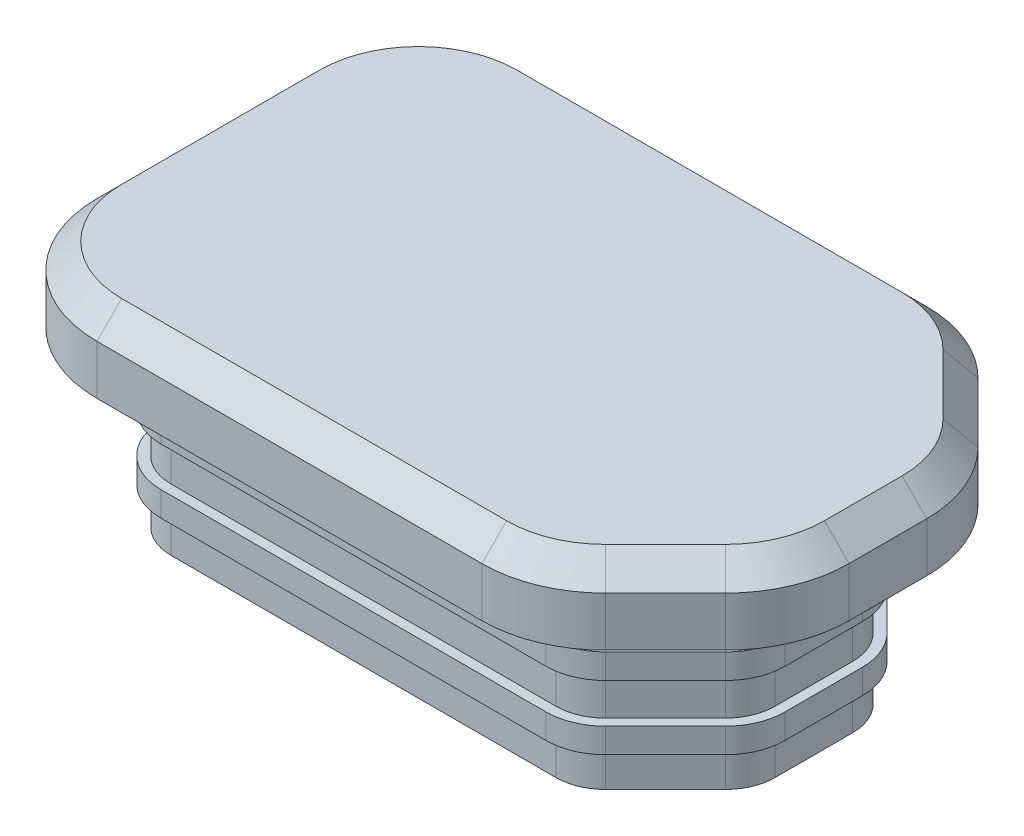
ISO-10303-21;
HEADER;
FILE_DESCRIPTION(('STEP AP214'),'2;1');
FILE_NAME('part.step','',(''),(''),'','','');
FILE_SCHEMA(('AUTOMOTIVE_DESIGN { 1 0 10303 214 1 1 1 1 }'));
ENDSEC;
DATA;
#1=APPLICATION_CONTEXT('core data for automotive mechanical design processes');
#2=APPLICATION_PROTOCOL_DEFINITION('international standard','automotive_design',2000,#1);
#3=PRODUCT_CONTEXT('',#1,'mechanical');
#4=PRODUCT('Part','Part','',(#3));
#5=PRODUCT_RELATED_PRODUCT_CATEGORY('part','',(#4));
#6=PRODUCT_DEFINITION_FORMATION('','',#4);
#7=PRODUCT_DEFINITION_CONTEXT('part definition',#1,'design');
#8=PRODUCT_DEFINITION('design','',#6,#7);
#9=PRODUCT_DEFINITION_SHAPE('','',#8);
#10=(LENGTH_UNIT() NAMED_UNIT(*) SI_UNIT(.MILLI.,.METRE.));
#11=(NAMED_UNIT(*) PLANE_ANGLE_UNIT() SI_UNIT($,.RADIAN.));
#12=(NAMED_UNIT(*) SI_UNIT($,.STERADIAN.) SOLID_ANGLE_UNIT());
#13=UNCERTAINTY_MEASURE_WITH_UNIT(LENGTH_MEASURE(1.E-05),#10,'distance_accuracy_value','');
#14=(GEOMETRIC_REPRESENTATION_CONTEXT(3) GLOBAL_UNCERTAINTY_ASSIGNED_CONTEXT((#13)) GLOBAL_UNIT_ASSIGNED_CONTEXT((#10,
#11,#12)) REPRESENTATION_CONTEXT('',''));
#15=CARTESIAN_POINT('',(0.,0.,0.));
#16=DIRECTION('',(0.,0.,1.));
#17=DIRECTION('',(1.,0.,0.));
#18=AXIS2_PLACEMENT_3D('',#15,#16,#17);
#19=CARTESIAN_POINT('',(4.50000000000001,3.5,-0.785786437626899));
#20=DIRECTION('',(1.,0.,0.));
#21=DIRECTION('',(0.,0.,-1.));
#22=AXIS2_PLACEMENT_3D('',#19,#20,#21);
#23=PLANE('',#22);
#24=DIRECTION('',(0.,1.,0.));
#25=VECTOR('',#24,1.);
#26=CARTESIAN_POINT('',(4.50000000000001,3.5,0.785786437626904));
#27=LINE('',#26,#25);
#28=CARTESIAN_POINT('',(4.50000000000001,0.,0.785786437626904));
#29=VERTEX_POINT('',#28);
#30=CARTESIAN_POINT('',(4.50000000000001,3.5,0.785786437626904));
#31=VERTEX_POINT('',#30);
#32=EDGE_CURVE('E571',#29,#31,#27,.T.);
#33=ORIENTED_EDGE('',*,*,#32,.T.);
#34=DIRECTION('',(0.,0.,-1.));
#35=VECTOR('',#34,1.);
#36=CARTESIAN_POINT('',(4.50000000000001,3.5,-0.785786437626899));
#37=LINE('',#36,#35);
#38=CARTESIAN_POINT('',(4.50000000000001,3.5,-0.785786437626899));
#39=VERTEX_POINT('',#38);
#40=EDGE_CURVE('E583',#39,#31,#37,.F.);
#41=ORIENTED_EDGE('',*,*,#40,.F.);
#42=DIRECTION('',(0.,1.,0.));
#43=VECTOR('',#42,1.);
#44=CARTESIAN_POINT('',(4.50000000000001,3.5,-0.785786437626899));
#45=LINE('',#44,#43);
#46=CARTESIAN_POINT('',(4.50000000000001,0.,-0.785786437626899));
#47=VERTEX_POINT('',#46);
#48=EDGE_CURVE('E577',#39,#47,#45,.F.);
#49=ORIENTED_EDGE('',*,*,#48,.T.);
#50=DIRECTION('',(0.,0.,-1.));
#51=VECTOR('',#50,1.);
#52=CARTESIAN_POINT('',(4.50000000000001,0.,-0.785786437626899));
#53=LINE('',#52,#51);
#54=EDGE_CURVE('E580',#29,#47,#53,.T.);
#55=ORIENTED_EDGE('',*,*,#54,.F.);
#56=EDGE_LOOP('',(#33,#41,#49,#55));
#57=FACE_BOUND('',#56,.T.);
#58=ADVANCED_FACE('F17',(#57),#23,.F.);
#59=CARTESIAN_POINT('',(3.28578643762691,3.5,-2.));
#60=DIRECTION('',(0.707106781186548,0.,-0.707106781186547));
#61=DIRECTION('',(-0.707106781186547,0.,-0.707106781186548));
#62=AXIS2_PLACEMENT_3D('',#59,#60,#61);
#63=PLANE('',#62);
#64=ORIENTED_EDGE('',*,*,#48,.F.);
#65=DIRECTION('',(-0.707106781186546,0.,-0.707106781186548));
#66=VECTOR('',#65,1.);
#67=CARTESIAN_POINT('',(4.50000000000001,3.5,-0.785786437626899));
#68=LINE('',#67,#66);
#69=CARTESIAN_POINT('',(3.28578643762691,3.5,-2.));
#70=VERTEX_POINT('',#69);
#71=EDGE_CURVE('E565',#39,#70,#68,.T.);
#72=ORIENTED_EDGE('',*,*,#71,.T.);
#73=DIRECTION('',(0.,1.,0.));
#74=VECTOR('',#73,1.);
#75=CARTESIAN_POINT('',(3.28578643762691,3.5,-2.));
#76=LINE('',#75,#74);
#77=CARTESIAN_POINT('',(3.28578643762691,0.,-2.));
#78=VERTEX_POINT('',#77);
#79=EDGE_CURVE('E550',#70,#78,#76,.F.);
#80=ORIENTED_EDGE('',*,*,#79,.T.);
#81=DIRECTION('',(-0.707106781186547,0.,-0.707106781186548));
#82=VECTOR('',#81,1.);
#83=CARTESIAN_POINT('',(3.28578643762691,0.,-2.));
#84=LINE('',#83,#82);
#85=EDGE_CURVE('E574',#47,#78,#84,.T.);
#86=ORIENTED_EDGE('',*,*,#85,.F.);
#87=EDGE_LOOP('',(#64,#72,#80,#86));
#88=FACE_BOUND('',#87,.T.);
#89=ADVANCED_FACE('F2210',(#88),#63,.F.);
#90=CARTESIAN_POINT('',(4.50000000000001,3.5,0.785786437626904));
#91=DIRECTION('',(0.707106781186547,0.,0.707106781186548));
#92=DIRECTION('',(0.707106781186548,0.,-0.707106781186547));
#93=AXIS2_PLACEMENT_3D('',#90,#91,#92);
#94=PLANE('',#93);
#95=DIRECTION('',(0.,1.,0.));
#96=VECTOR('',#95,1.);
#97=CARTESIAN_POINT('',(3.28578643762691,3.5,2.));
#98=LINE('',#97,#96);
#99=CARTESIAN_POINT('',(3.28578643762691,0.,2.));
#100=VERTEX_POINT('',#99);
#101=CARTESIAN_POINT('',(3.28578643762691,3.5,2.));
#102=VERTEX_POINT('',#101);
#103=EDGE_CURVE('E547',#100,#102,#98,.T.);
#104=ORIENTED_EDGE('',*,*,#103,.T.);
#105=DIRECTION('',(0.707106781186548,0.,-0.707106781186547));
#106=VECTOR('',#105,1.);
#107=CARTESIAN_POINT('',(3.28578643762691,3.5,2.));
#108=LINE('',#107,#106);
#109=EDGE_CURVE('E562',#102,#31,#108,.T.);
#110=ORIENTED_EDGE('',*,*,#109,.T.);
#111=ORIENTED_EDGE('',*,*,#32,.F.);
#112=DIRECTION('',(0.707106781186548,0.,-0.707106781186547));
#113=VECTOR('',#112,1.);
#114=CARTESIAN_POINT('',(4.50000000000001,0.,0.785786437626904));
#115=LINE('',#114,#113);
#116=EDGE_CURVE('E568',#100,#29,#115,.T.);
#117=ORIENTED_EDGE('',*,*,#116,.F.);
#118=EDGE_LOOP('',(#104,#110,#111,#117));
#119=FACE_BOUND('',#118,.T.);
#120=ADVANCED_FACE('F2200',(#119),#94,.F.);
#121=CARTESIAN_POINT('',(0.,3.5,0.));
#122=DIRECTION('',(0.,1.,0.));
#123=DIRECTION('',(0.,0.,1.));
#124=AXIS2_PLACEMENT_3D('',#121,#122,#123);
#125=PLANE('',#124);
#126=DIRECTION('',(1.,0.,0.));
#127=VECTOR('',#126,1.);
#128=CARTESIAN_POINT('',(3.28578643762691,3.5,2.));
#129=LINE('',#128,#127);
#130=CARTESIAN_POINT('',(-4.49999999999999,3.5,2.));
#131=VERTEX_POINT('',#130);
#132=EDGE_CURVE('E544',#102,#131,#129,.F.);
#133=ORIENTED_EDGE('',*,*,#132,.T.);
#134=DIRECTION('',(0.,0.,1.));
#135=VECTOR('',#134,1.);
#136=CARTESIAN_POINT('',(-4.49999999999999,3.5,2.));
#137=LINE('',#136,#135);
#138=CARTESIAN_POINT('',(-4.49999999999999,3.5,-2.));
#139=VERTEX_POINT('',#138);
#140=EDGE_CURVE('E559',#131,#139,#137,.F.);
#141=ORIENTED_EDGE('',*,*,#140,.T.);
#142=DIRECTION('',(-1.,0.,0.));
#143=VECTOR('',#142,1.);
#144=CARTESIAN_POINT('',(-4.49999999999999,3.5,-2.));
#145=LINE('',#144,#143);
#146=EDGE_CURVE('E553',#139,#70,#145,.F.);
#147=ORIENTED_EDGE('',*,*,#146,.T.);
#148=ORIENTED_EDGE('',*,*,#71,.F.);
#149=ORIENTED_EDGE('',*,*,#40,.T.);
#150=ORIENTED_EDGE('',*,*,#109,.F.);
#151=EDGE_LOOP('',(#133,#141,#147,#148,#149,#150));
#152=FACE_BOUND('',#151,.T.);
#153=ADVANCED_FACE('F2190',(#152),#125,.F.);
#154=CARTESIAN_POINT('',(-4.49999999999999,3.5,2.));
#155=DIRECTION('',(-1.,0.,0.));
#156=DIRECTION('',(0.,0.,1.));
#157=AXIS2_PLACEMENT_3D('',#154,#155,#156);
#158=PLANE('',#157);
#159=DIRECTION('',(0.,1.,0.));
#160=VECTOR('',#159,1.);
#161=CARTESIAN_POINT('',(-4.49999999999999,3.5,-2.));
#162=LINE('',#161,#160);
#163=CARTESIAN_POINT('',(-4.49999999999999,0.,-2.));
#164=VERTEX_POINT('',#163);
#165=EDGE_CURVE('E556',#164,#139,#162,.T.);
#166=ORIENTED_EDGE('',*,*,#165,.T.);
#167=ORIENTED_EDGE('',*,*,#140,.F.);
#168=DIRECTION('',(0.,1.,0.));
#169=VECTOR('',#168,1.);
#170=CARTESIAN_POINT('',(-4.49999999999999,3.5,2.));
#171=LINE('',#170,#169);
#172=CARTESIAN_POINT('',(-4.49999999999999,0.,2.));
#173=VERTEX_POINT('',#172);
#174=EDGE_CURVE('E538',#131,#173,#171,.F.);
#175=ORIENTED_EDGE('',*,*,#174,.T.);
#176=DIRECTION('',(0.,0.,1.));
#177=VECTOR('',#176,1.);
#178=CARTESIAN_POINT('',(-4.49999999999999,0.,0.));
#179=LINE('',#178,#177);
#180=EDGE_CURVE('E535',#173,#164,#179,.F.);
#181=ORIENTED_EDGE('',*,*,#180,.T.);
#182=EDGE_LOOP('',(#166,#167,#175,#181));
#183=FACE_BOUND('',#182,.T.);
#184=ADVANCED_FACE('F2180',(#183),#158,.F.);
#185=CARTESIAN_POINT('',(-4.49999999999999,3.5,-2.));
#186=DIRECTION('',(0.,0.,-1.));
#187=DIRECTION('',(-1.,0.,0.));
#188=AXIS2_PLACEMENT_3D('',#185,#186,#187);
#189=PLANE('',#188);
#190=ORIENTED_EDGE('',*,*,#79,.F.);
#191=ORIENTED_EDGE('',*,*,#146,.F.);
#192=ORIENTED_EDGE('',*,*,#165,.F.);
#193=DIRECTION('',(1.,0.,0.));
#194=VECTOR('',#193,1.);
#195=CARTESIAN_POINT('',(0.,0.,-2.));
#196=LINE('',#195,#194);
#197=EDGE_CURVE('E532',#164,#78,#196,.T.);
#198=ORIENTED_EDGE('',*,*,#197,.T.);
#199=EDGE_LOOP('',(#190,#191,#192,#198));
#200=FACE_BOUND('',#199,.T.);
#201=ADVANCED_FACE('F2170',(#200),#189,.F.);
#202=CARTESIAN_POINT('',(3.28578643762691,3.5,2.));
#203=DIRECTION('',(0.,0.,1.));
#204=DIRECTION('',(1.,0.,0.));
#205=AXIS2_PLACEMENT_3D('',#202,#203,#204);
#206=PLANE('',#205);
#207=ORIENTED_EDGE('',*,*,#174,.F.);
#208=ORIENTED_EDGE('',*,*,#132,.F.);
#209=ORIENTED_EDGE('',*,*,#103,.F.);
#210=DIRECTION('',(1.,0.,0.));
#211=VECTOR('',#210,1.);
#212=CARTESIAN_POINT('',(0.,0.,2.));
#213=LINE('',#212,#211);
#214=EDGE_CURVE('E480',#100,#173,#213,.F.);
#215=ORIENTED_EDGE('',*,*,#214,.T.);
#216=EDGE_LOOP('',(#207,#208,#209,#215));
#217=FACE_BOUND('',#216,.T.);
#218=ADVANCED_FACE('F2161',(#217),#206,.F.);
#219=CARTESIAN_POINT('',(0.,0.,0.));
#220=DIRECTION('',(0.,1.,0.));
#221=DIRECTION('',(0.,0.,1.));
#222=AXIS2_PLACEMENT_3D('',#219,#220,#221);
#223=PLANE('',#222);
#224=CARTESIAN_POINT('',(4.50000000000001,0.,0.785786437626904));
#225=DIRECTION('',(0.,-1.,0.));
#226=DIRECTION('',(0.,0.,-1.));
#227=AXIS2_PLACEMENT_3D('',#224,#225,#226);
#228=CIRCLE('',#227,1.);
#229=CARTESIAN_POINT('',(5.20710678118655,0.,1.49289321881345));
#230=VERTEX_POINT('',#229);
#231=CARTESIAN_POINT('',(5.50000000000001,0.,0.785786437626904));
#232=VERTEX_POINT('',#231);
#233=EDGE_CURVE('E527',#230,#232,#228,.F.);
#234=ORIENTED_EDGE('',*,*,#233,.F.);
#235=DIRECTION('',(0.707106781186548,0.,-0.707106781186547));
#236=VECTOR('',#235,1.);
#237=CARTESIAN_POINT('',(3.99289321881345,0.,2.70710678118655));
#238=LINE('',#237,#236);
#239=CARTESIAN_POINT('',(3.99289321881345,0.,2.70710678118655));
#240=VERTEX_POINT('',#239);
#241=EDGE_CURVE('E476',#240,#230,#238,.T.);
#242=ORIENTED_EDGE('',*,*,#241,.F.);
#243=CARTESIAN_POINT('',(3.2857864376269,0.,2.));
#244=DIRECTION('',(0.,1.,0.));
#245=DIRECTION('',(0.,0.,1.));
#246=AXIS2_PLACEMENT_3D('',#243,#244,#245);
#247=CIRCLE('',#246,1.);
#248=CARTESIAN_POINT('',(3.2857864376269,0.,3.));
#249=VERTEX_POINT('',#248);
#250=EDGE_CURVE('E20',#249,#240,#247,.T.);
#251=ORIENTED_EDGE('',*,*,#250,.F.);
#252=DIRECTION('',(-1.,0.,0.));
#253=VECTOR('',#252,1.);
#254=CARTESIAN_POINT('',(-5.49999999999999,0.,3.));
#255=LINE('',#254,#253);
#256=CARTESIAN_POINT('',(-4.49999999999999,0.,3.));
#257=VERTEX_POINT('',#256);
#258=EDGE_CURVE('E474',#249,#257,#255,.T.);
#259=ORIENTED_EDGE('',*,*,#258,.T.);
#260=CARTESIAN_POINT('',(-4.49999999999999,0.,2.));
#261=DIRECTION('',(0.,-1.,0.));
#262=DIRECTION('',(0.,0.,-1.));
#263=AXIS2_PLACEMENT_3D('',#260,#261,#262);
#264=CIRCLE('',#263,1.);
#265=CARTESIAN_POINT('',(-5.49999999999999,0.,2.));
#266=VERTEX_POINT('',#265);
#267=EDGE_CURVE('E488',#266,#257,#264,.F.);
#268=ORIENTED_EDGE('',*,*,#267,.F.);
#269=DIRECTION('',(0.,0.,-1.));
#270=VECTOR('',#269,1.);
#271=CARTESIAN_POINT('',(-5.49999999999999,0.,-3.));
#272=LINE('',#271,#270);
#273=CARTESIAN_POINT('',(-5.49999999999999,0.,-2.));
#274=VERTEX_POINT('',#273);
#275=EDGE_CURVE('E506',#266,#274,#272,.T.);
#276=ORIENTED_EDGE('',*,*,#275,.T.);
#277=CARTESIAN_POINT('',(-4.49999999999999,0.,-2.));
#278=DIRECTION('',(0.,-1.,0.));
#279=DIRECTION('',(0.,0.,-1.));
#280=AXIS2_PLACEMENT_3D('',#277,#278,#279);
#281=CIRCLE('',#280,1.);
#282=CARTESIAN_POINT('',(-4.49999999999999,0.,-3.));
#283=VERTEX_POINT('',#282);
#284=EDGE_CURVE('E510',#283,#274,#281,.F.);
#285=ORIENTED_EDGE('',*,*,#284,.F.);
#286=DIRECTION('',(1.,0.,0.));
#287=VECTOR('',#286,1.);
#288=CARTESIAN_POINT('',(-5.49999999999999,0.,-3.));
#289=LINE('',#288,#287);
#290=CARTESIAN_POINT('',(3.28578643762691,0.,-3.));
#291=VERTEX_POINT('',#290);
#292=EDGE_CURVE('E513',#283,#291,#289,.T.);
#293=ORIENTED_EDGE('',*,*,#292,.T.);
#294=CARTESIAN_POINT('',(3.28578643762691,0.,-2.));
#295=DIRECTION('',(0.,-1.,0.));
#296=DIRECTION('',(0.,0.,-1.));
#297=AXIS2_PLACEMENT_3D('',#294,#295,#296);
#298=CIRCLE('',#297,1.);
#299=CARTESIAN_POINT('',(3.99289321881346,0.,-2.70710678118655));
#300=VERTEX_POINT('',#299);
#301=EDGE_CURVE('E517',#300,#291,#298,.F.);
#302=ORIENTED_EDGE('',*,*,#301,.F.);
#303=DIRECTION('',(0.707106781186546,0.,0.707106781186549));
#304=VECTOR('',#303,1.);
#305=CARTESIAN_POINT('',(3.70000000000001,0.,-3.));
#306=LINE('',#305,#304);
#307=CARTESIAN_POINT('',(5.20710678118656,0.,-1.49289321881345));
#308=VERTEX_POINT('',#307);
#309=EDGE_CURVE('E520',#300,#308,#306,.T.);
#310=ORIENTED_EDGE('',*,*,#309,.T.);
#311=CARTESIAN_POINT('',(4.50000000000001,0.,-0.785786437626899));
#312=DIRECTION('',(0.,1.,0.));
#313=DIRECTION('',(0.,0.,1.));
#314=AXIS2_PLACEMENT_3D('',#311,#312,#313);
#315=CIRCLE('',#314,1.);
#316=CARTESIAN_POINT('',(5.50000000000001,0.,-0.785786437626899));
#317=VERTEX_POINT('',#316);
#318=EDGE_CURVE('E524',#317,#308,#315,.T.);
#319=ORIENTED_EDGE('',*,*,#318,.F.);
#320=DIRECTION('',(0.,0.,1.));
#321=VECTOR('',#320,1.);
#322=CARTESIAN_POINT('',(5.50000000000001,0.,-3.));
#323=LINE('',#322,#321);
#324=EDGE_CURVE('E525',#317,#232,#323,.T.);
#325=ORIENTED_EDGE('',*,*,#324,.T.);
#326=EDGE_LOOP('',(#234,#242,#251,#259,#268,#276,#285,#293,#302,#310,#319,#325));
#327=FACE_BOUND('',#326,.T.);
#328=ORIENTED_EDGE('',*,*,#116,.T.);
#329=ORIENTED_EDGE('',*,*,#54,.T.);
#330=ORIENTED_EDGE('',*,*,#85,.T.);
#331=ORIENTED_EDGE('',*,*,#197,.F.);
#332=ORIENTED_EDGE('',*,*,#180,.F.);
#333=ORIENTED_EDGE('',*,*,#214,.F.);
#334=EDGE_LOOP('',(#328,#329,#330,#331,#332,#333));
#335=FACE_BOUND('',#334,.T.);
#336=ADVANCED_FACE('F471',(#327,#335),#223,.F.);
#337=CARTESIAN_POINT('',(5.50000000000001,5.,-3.));
#338=DIRECTION('',(-1.,0.,0.));
#339=DIRECTION('',(0.,0.,1.));
#340=AXIS2_PLACEMENT_3D('',#337,#338,#339);
#341=PLANE('',#340);
#342=DIRECTION('',(0.,0.,-1.));
#343=VECTOR('',#342,1.);
#344=CARTESIAN_POINT('',(5.50000000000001,0.75,-0.785786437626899));
#345=LINE('',#344,#343);
#346=CARTESIAN_POINT('',(5.50000000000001,0.75,0.785786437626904));
#347=VERTEX_POINT('',#346);
#348=CARTESIAN_POINT('',(5.50000000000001,0.75,-0.785786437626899));
#349=VERTEX_POINT('',#348);
#350=EDGE_CURVE('E828',#347,#349,#345,.T.);
#351=ORIENTED_EDGE('',*,*,#350,.F.);
#352=DIRECTION('',(0.,-1.,0.));
#353=VECTOR('',#352,1.);
#354=CARTESIAN_POINT('',(5.50000000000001,5.,0.785786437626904));
#355=LINE('',#354,#353);
#356=EDGE_CURVE('E835',#232,#347,#355,.F.);
#357=ORIENTED_EDGE('',*,*,#356,.F.);
#358=ORIENTED_EDGE('',*,*,#324,.F.);
#359=DIRECTION('',(0.,1.,0.));
#360=VECTOR('',#359,1.);
#361=CARTESIAN_POINT('',(5.50000000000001,5.,-0.785786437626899));
#362=LINE('',#361,#360);
#363=EDGE_CURVE('E521',#349,#317,#362,.F.);
#364=ORIENTED_EDGE('',*,*,#363,.F.);
#365=EDGE_LOOP('',(#351,#357,#358,#364));
#366=FACE_BOUND('',#365,.T.);
#367=ADVANCED_FACE('F850',(#366),#341,.F.);
#368=CARTESIAN_POINT('',(4.50000000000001,5.,-0.785786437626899));
#369=DIRECTION('',(0.,1.,0.));
#370=DIRECTION('',(0.,0.,1.));
#371=AXIS2_PLACEMENT_3D('',#368,#369,#370);
#372=CYLINDRICAL_SURFACE('',#371,1.);
#373=ORIENTED_EDGE('',*,*,#318,.T.);
#374=DIRECTION('',(0.,1.,0.));
#375=VECTOR('',#374,1.);
#376=CARTESIAN_POINT('',(5.20710678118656,5.,-1.49289321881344));
#377=LINE('',#376,#375);
#378=CARTESIAN_POINT('',(5.20710678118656,0.75,-1.49289321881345));
#379=VERTEX_POINT('',#378);
#380=EDGE_CURVE('E518',#308,#379,#377,.T.);
#381=ORIENTED_EDGE('',*,*,#380,.T.);
#382=CARTESIAN_POINT('',(4.50000000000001,0.75,-0.785786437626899));
#383=DIRECTION('',(0.,1.,0.));
#384=DIRECTION('',(0.,0.,1.));
#385=AXIS2_PLACEMENT_3D('',#382,#383,#384);
#386=CIRCLE('',#385,1.);
#387=EDGE_CURVE('E825',#349,#379,#386,.T.);
#388=ORIENTED_EDGE('',*,*,#387,.F.);
#389=ORIENTED_EDGE('',*,*,#363,.T.);
#390=EDGE_LOOP('',(#373,#381,#388,#389));
#391=FACE_BOUND('',#390,.T.);
#392=ADVANCED_FACE('F2134',(#391),#372,.T.);
#393=CARTESIAN_POINT('',(3.70000000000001,5.,-3.));
#394=DIRECTION('',(-0.707106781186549,0.,0.707106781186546));
#395=DIRECTION('',(0.707106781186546,0.,0.707106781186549));
#396=AXIS2_PLACEMENT_3D('',#393,#394,#395);
#397=PLANE('',#396);
#398=ORIENTED_EDGE('',*,*,#380,.F.);
#399=ORIENTED_EDGE('',*,*,#309,.F.);
#400=DIRECTION('',(0.,-1.,0.));
#401=VECTOR('',#400,1.);
#402=CARTESIAN_POINT('',(3.99289321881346,5.,-2.70710678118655));
#403=LINE('',#402,#401);
#404=CARTESIAN_POINT('',(3.99289321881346,0.75,-2.70710678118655));
#405=VERTEX_POINT('',#404);
#406=EDGE_CURVE('E514',#405,#300,#403,.T.);
#407=ORIENTED_EDGE('',*,*,#406,.F.);
#408=DIRECTION('',(-0.707106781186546,0.,-0.707106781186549));
#409=VECTOR('',#408,1.);
#410=CARTESIAN_POINT('',(5.20710678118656,0.75,-1.49289321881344));
#411=LINE('',#410,#409);
#412=EDGE_CURVE('E824',#379,#405,#411,.T.);
#413=ORIENTED_EDGE('',*,*,#412,.F.);
#414=EDGE_LOOP('',(#398,#399,#407,#413));
#415=FACE_BOUND('',#414,.T.);
#416=ADVANCED_FACE('F2124',(#415),#397,.F.);
#417=CARTESIAN_POINT('',(3.28578643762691,5.,-2.));
#418=DIRECTION('',(0.,-1.,0.));
#419=DIRECTION('',(0.,0.,-1.));
#420=AXIS2_PLACEMENT_3D('',#417,#418,#419);
#421=CYLINDRICAL_SURFACE('',#420,1.);
#422=ORIENTED_EDGE('',*,*,#301,.T.);
#423=DIRECTION('',(0.,1.,0.));
#424=VECTOR('',#423,1.);
#425=CARTESIAN_POINT('',(3.28578643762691,5.,-3.));
#426=LINE('',#425,#424);
#427=CARTESIAN_POINT('',(3.28578643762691,0.75,-3.));
#428=VERTEX_POINT('',#427);
#429=EDGE_CURVE('E511',#291,#428,#426,.T.);
#430=ORIENTED_EDGE('',*,*,#429,.T.);
#431=CARTESIAN_POINT('',(3.28578643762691,0.75,-2.));
#432=DIRECTION('',(0.,-1.,0.));
#433=DIRECTION('',(0.,0.,-1.));
#434=AXIS2_PLACEMENT_3D('',#431,#432,#433);
#435=CIRCLE('',#434,1.);
#436=EDGE_CURVE('E821',#405,#428,#435,.F.);
#437=ORIENTED_EDGE('',*,*,#436,.F.);
#438=ORIENTED_EDGE('',*,*,#406,.T.);
#439=EDGE_LOOP('',(#422,#430,#437,#438));
#440=FACE_BOUND('',#439,.T.);
#441=ADVANCED_FACE('F2114',(#440),#421,.T.);
#442=CARTESIAN_POINT('',(-5.49999999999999,5.,-3.));
#443=DIRECTION('',(0.,0.,1.));
#444=DIRECTION('',(1.,0.,0.));
#445=AXIS2_PLACEMENT_3D('',#442,#443,#444);
#446=PLANE('',#445);
#447=DIRECTION('',(1.,0.,0.));
#448=VECTOR('',#447,1.);
#449=CARTESIAN_POINT('',(4.50000000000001,0.75,-3.));
#450=LINE('',#449,#448);
#451=CARTESIAN_POINT('',(-4.49999999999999,0.75,-3.));
#452=VERTEX_POINT('',#451);
#453=EDGE_CURVE('E820',#428,#452,#450,.F.);
#454=ORIENTED_EDGE('',*,*,#453,.F.);
#455=ORIENTED_EDGE('',*,*,#429,.F.);
#456=ORIENTED_EDGE('',*,*,#292,.F.);
#457=DIRECTION('',(0.,-1.,0.));
#458=VECTOR('',#457,1.);
#459=CARTESIAN_POINT('',(-4.49999999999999,5.,-3.));
#460=LINE('',#459,#458);
#461=EDGE_CURVE('E507',#452,#283,#460,.T.);
#462=ORIENTED_EDGE('',*,*,#461,.F.);
#463=EDGE_LOOP('',(#454,#455,#456,#462));
#464=FACE_BOUND('',#463,.T.);
#465=ADVANCED_FACE('F2104',(#464),#446,.F.);
#466=CARTESIAN_POINT('',(-4.49999999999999,5.,-2.));
#467=DIRECTION('',(0.,-1.,0.));
#468=DIRECTION('',(0.,0.,-1.));
#469=AXIS2_PLACEMENT_3D('',#466,#467,#468);
#470=CYLINDRICAL_SURFACE('',#469,1.);
#471=ORIENTED_EDGE('',*,*,#284,.T.);
#472=DIRECTION('',(0.,1.,0.));
#473=VECTOR('',#472,1.);
#474=CARTESIAN_POINT('',(-5.49999999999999,5.,-2.));
#475=LINE('',#474,#473);
#476=CARTESIAN_POINT('',(-5.49999999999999,0.75,-2.));
#477=VERTEX_POINT('',#476);
#478=EDGE_CURVE('E504',#274,#477,#475,.T.);
#479=ORIENTED_EDGE('',*,*,#478,.T.);
#480=CARTESIAN_POINT('',(-4.49999999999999,0.75,-2.));
#481=DIRECTION('',(0.,-1.,0.));
#482=DIRECTION('',(0.,0.,-1.));
#483=AXIS2_PLACEMENT_3D('',#480,#481,#482);
#484=CIRCLE('',#483,1.);
#485=EDGE_CURVE('E817',#452,#477,#484,.F.);
#486=ORIENTED_EDGE('',*,*,#485,.F.);
#487=ORIENTED_EDGE('',*,*,#461,.T.);
#488=EDGE_LOOP('',(#471,#479,#486,#487));
#489=FACE_BOUND('',#488,.T.);
#490=ADVANCED_FACE('F2094',(#489),#470,.T.);
#491=CARTESIAN_POINT('',(-5.49999999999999,5.,-3.));
#492=DIRECTION('',(1.,0.,0.));
#493=DIRECTION('',(0.,0.,-1.));
#494=AXIS2_PLACEMENT_3D('',#491,#492,#493);
#495=PLANE('',#494);
#496=DIRECTION('',(0.,0.,-1.));
#497=VECTOR('',#496,1.);
#498=CARTESIAN_POINT('',(-5.49999999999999,0.75,-0.785786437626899));
#499=LINE('',#498,#497);
#500=CARTESIAN_POINT('',(-5.49999999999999,0.75,2.));
#501=VERTEX_POINT('',#500);
#502=EDGE_CURVE('E816',#477,#501,#499,.F.);
#503=ORIENTED_EDGE('',*,*,#502,.F.);
#504=ORIENTED_EDGE('',*,*,#478,.F.);
#505=ORIENTED_EDGE('',*,*,#275,.F.);
#506=DIRECTION('',(0.,-1.,0.));
#507=VECTOR('',#506,1.);
#508=CARTESIAN_POINT('',(-5.49999999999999,5.,2.));
#509=LINE('',#508,#507);
#510=EDGE_CURVE('E501',#501,#266,#509,.T.);
#511=ORIENTED_EDGE('',*,*,#510,.F.);
#512=EDGE_LOOP('',(#503,#504,#505,#511));
#513=FACE_BOUND('',#512,.T.);
#514=ADVANCED_FACE('F2084',(#513),#495,.F.);
#515=CARTESIAN_POINT('',(-4.49999999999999,5.,2.));
#516=DIRECTION('',(0.,-1.,0.));
#517=DIRECTION('',(0.,0.,-1.));
#518=AXIS2_PLACEMENT_3D('',#515,#516,#517);
#519=CYLINDRICAL_SURFACE('',#518,1.);
#520=ORIENTED_EDGE('',*,*,#267,.T.);
#521=DIRECTION('',(0.,1.,0.));
#522=VECTOR('',#521,1.);
#523=CARTESIAN_POINT('',(-4.49999999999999,5.,3.));
#524=LINE('',#523,#522);
#525=CARTESIAN_POINT('',(-4.49999999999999,0.75,3.));
#526=VERTEX_POINT('',#525);
#527=EDGE_CURVE('E487',#257,#526,#524,.T.);
#528=ORIENTED_EDGE('',*,*,#527,.T.);
#529=CARTESIAN_POINT('',(-4.49999999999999,0.75,2.));
#530=DIRECTION('',(0.,-1.,0.));
#531=DIRECTION('',(0.,0.,-1.));
#532=AXIS2_PLACEMENT_3D('',#529,#530,#531);
#533=CIRCLE('',#532,1.);
#534=EDGE_CURVE('E813',#501,#526,#533,.F.);
#535=ORIENTED_EDGE('',*,*,#534,.F.);
#536=ORIENTED_EDGE('',*,*,#510,.T.);
#537=EDGE_LOOP('',(#520,#528,#535,#536));
#538=FACE_BOUND('',#537,.T.);
#539=ADVANCED_FACE('F2075',(#538),#519,.T.);
#540=CARTESIAN_POINT('',(-5.49999999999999,5.,3.));
#541=DIRECTION('',(0.,0.,-1.));
#542=DIRECTION('',(-1.,0.,0.));
#543=AXIS2_PLACEMENT_3D('',#540,#541,#542);
#544=PLANE('',#543);
#545=DIRECTION('',(1.,0.,0.));
#546=VECTOR('',#545,1.);
#547=CARTESIAN_POINT('',(4.50000000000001,0.75,3.));
#548=LINE('',#547,#546);
#549=CARTESIAN_POINT('',(3.2857864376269,0.75,3.));
#550=VERTEX_POINT('',#549);
#551=EDGE_CURVE('E812',#526,#550,#548,.T.);
#552=ORIENTED_EDGE('',*,*,#551,.F.);
#553=ORIENTED_EDGE('',*,*,#527,.F.);
#554=ORIENTED_EDGE('',*,*,#258,.F.);
#555=DIRECTION('',(0.,1.,0.));
#556=VECTOR('',#555,1.);
#557=CARTESIAN_POINT('',(3.2857864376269,5.,3.));
#558=LINE('',#557,#556);
#559=EDGE_CURVE('E485',#550,#249,#558,.F.);
#560=ORIENTED_EDGE('',*,*,#559,.F.);
#561=EDGE_LOOP('',(#552,#553,#554,#560));
#562=FACE_BOUND('',#561,.T.);
#563=ADVANCED_FACE('F484',(#562),#544,.F.);
#564=CARTESIAN_POINT('',(3.2857864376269,5.,2.));
#565=DIRECTION('',(0.,1.,0.));
#566=DIRECTION('',(0.,0.,1.));
#567=AXIS2_PLACEMENT_3D('',#564,#565,#566);
#568=CYLINDRICAL_SURFACE('',#567,1.);
#569=ORIENTED_EDGE('',*,*,#250,.T.);
#570=DIRECTION('',(0.,1.,0.));
#571=VECTOR('',#570,1.);
#572=CARTESIAN_POINT('',(3.99289321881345,5.,2.70710678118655));
#573=LINE('',#572,#571);
#574=CARTESIAN_POINT('',(3.99289321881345,0.75,2.70710678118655));
#575=VERTEX_POINT('',#574);
#576=EDGE_CURVE('E494',#240,#575,#573,.T.);
#577=ORIENTED_EDGE('',*,*,#576,.T.);
#578=CARTESIAN_POINT('',(3.2857864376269,0.75,2.));
#579=DIRECTION('',(0.,1.,0.));
#580=DIRECTION('',(0.,0.,1.));
#581=AXIS2_PLACEMENT_3D('',#578,#579,#580);
#582=CIRCLE('',#581,1.);
#583=EDGE_CURVE('E492',#550,#575,#582,.T.);
#584=ORIENTED_EDGE('',*,*,#583,.F.);
#585=ORIENTED_EDGE('',*,*,#559,.T.);
#586=EDGE_LOOP('',(#569,#577,#584,#585));
#587=FACE_BOUND('',#586,.T.);
#588=ADVANCED_FACE('F490',(#587),#568,.T.);
#589=CARTESIAN_POINT('',(5.50000000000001,5.,1.2));
#590=DIRECTION('',(-0.707106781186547,0.,-0.707106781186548));
#591=DIRECTION('',(-0.707106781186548,0.,0.707106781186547));
#592=AXIS2_PLACEMENT_3D('',#589,#590,#591);
#593=PLANE('',#592);
#594=ORIENTED_EDGE('',*,*,#576,.F.);
#595=ORIENTED_EDGE('',*,*,#241,.T.);
#596=DIRECTION('',(0.,-1.,0.));
#597=VECTOR('',#596,1.);
#598=CARTESIAN_POINT('',(5.20710678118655,5.,1.49289321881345));
#599=LINE('',#598,#597);
#600=CARTESIAN_POINT('',(5.20710678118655,0.75,1.49289321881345));
#601=VERTEX_POINT('',#600);
#602=EDGE_CURVE('E496',#601,#230,#599,.T.);
#603=ORIENTED_EDGE('',*,*,#602,.F.);
#604=DIRECTION('',(0.707106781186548,0.,-0.707106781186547));
#605=VECTOR('',#604,1.);
#606=CARTESIAN_POINT('',(3.99289321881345,0.75,2.70710678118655));
#607=LINE('',#606,#605);
#608=EDGE_CURVE('E810',#575,#601,#607,.T.);
#609=ORIENTED_EDGE('',*,*,#608,.F.);
#610=EDGE_LOOP('',(#594,#595,#603,#609));
#611=FACE_BOUND('',#610,.T.);
#612=ADVANCED_FACE('F2049',(#611),#593,.F.);
#613=CARTESIAN_POINT('',(4.50000000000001,5.,0.785786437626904));
#614=DIRECTION('',(0.,-1.,0.));
#615=DIRECTION('',(0.,0.,-1.));
#616=AXIS2_PLACEMENT_3D('',#613,#614,#615);
#617=CYLINDRICAL_SURFACE('',#616,1.);
#618=ORIENTED_EDGE('',*,*,#233,.T.);
#619=ORIENTED_EDGE('',*,*,#356,.T.);
#620=CARTESIAN_POINT('',(4.50000000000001,0.75,0.785786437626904));
#621=DIRECTION('',(0.,-1.,0.));
#622=DIRECTION('',(0.,0.,-1.));
#623=AXIS2_PLACEMENT_3D('',#620,#621,#622);
#624=CIRCLE('',#623,1.);
#625=EDGE_CURVE('E807',#601,#347,#624,.F.);
#626=ORIENTED_EDGE('',*,*,#625,.F.);
#627=ORIENTED_EDGE('',*,*,#602,.T.);
#628=EDGE_LOOP('',(#618,#619,#626,#627));
#629=FACE_BOUND('',#628,.T.);
#630=ADVANCED_FACE('F845',(#629),#617,.T.);
#631=CARTESIAN_POINT('',(4.50000000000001,0.75,-0.785786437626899));
#632=DIRECTION('',(0.,-1.,0.));
#633=DIRECTION('',(0.,0.,-1.));
#634=AXIS2_PLACEMENT_3D('',#631,#632,#633);
#635=PLANE('',#634);
#636=ORIENTED_EDGE('',*,*,#608,.T.);
#637=ORIENTED_EDGE('',*,*,#625,.T.);
#638=ORIENTED_EDGE('',*,*,#350,.T.);
#639=ORIENTED_EDGE('',*,*,#387,.T.);
#640=ORIENTED_EDGE('',*,*,#412,.T.);
#641=ORIENTED_EDGE('',*,*,#436,.T.);
#642=ORIENTED_EDGE('',*,*,#453,.T.);
#643=ORIENTED_EDGE('',*,*,#485,.T.);
#644=ORIENTED_EDGE('',*,*,#502,.T.);
#645=ORIENTED_EDGE('',*,*,#534,.T.);
#646=ORIENTED_EDGE('',*,*,#551,.T.);
#647=ORIENTED_EDGE('',*,*,#583,.T.);
#648=EDGE_LOOP('',(#636,#637,#638,#639,#640,#641,#642,#643,#644,#645,#646,#647));
#649=FACE_BOUND('',#648,.T.);
#650=CARTESIAN_POINT('',(3.28578643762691,0.75,-2.));
#651=DIRECTION('',(0.,1.,0.));
#652=DIRECTION('',(0.,0.,1.));
#653=AXIS2_PLACEMENT_3D('',#650,#651,#652);
#654=CIRCLE('',#653,1.2);
#655=CARTESIAN_POINT('',(3.28578643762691,0.75,-3.2));
#656=VERTEX_POINT('',#655);
#657=CARTESIAN_POINT('',(4.13431457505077,0.75,-2.84852813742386));
#658=VERTEX_POINT('',#657);
#659=EDGE_CURVE('E829',#656,#658,#654,.F.);
#660=ORIENTED_EDGE('',*,*,#659,.T.);
#661=DIRECTION('',(0.707106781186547,0.,0.707106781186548));
#662=VECTOR('',#661,1.);
#663=CARTESIAN_POINT('',(4.13431457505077,0.75,-2.84852813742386));
#664=LINE('',#663,#662);
#665=CARTESIAN_POINT('',(5.34852813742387,0.75,-1.63431457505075));
#666=VERTEX_POINT('',#665);
#667=EDGE_CURVE('E832',#658,#666,#664,.T.);
#668=ORIENTED_EDGE('',*,*,#667,.T.);
#669=CARTESIAN_POINT('',(4.50000000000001,0.75,-0.785786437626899));
#670=DIRECTION('',(0.,1.,0.));
#671=DIRECTION('',(0.,0.,1.));
#672=AXIS2_PLACEMENT_3D('',#669,#670,#671);
#673=CIRCLE('',#672,1.2);
#674=CARTESIAN_POINT('',(5.70000000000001,0.75,-0.785786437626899));
#675=VERTEX_POINT('',#674);
#676=EDGE_CURVE('E833',#666,#675,#673,.F.);
#677=ORIENTED_EDGE('',*,*,#676,.T.);
#678=DIRECTION('',(0.,0.,1.));
#679=VECTOR('',#678,1.);
#680=CARTESIAN_POINT('',(5.70000000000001,0.75,-0.785786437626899));
#681=LINE('',#680,#679);
#682=CARTESIAN_POINT('',(5.70000000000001,0.75,0.785786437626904));
#683=VERTEX_POINT('',#682);
#684=EDGE_CURVE('E806',#675,#683,#681,.T.);
#685=ORIENTED_EDGE('',*,*,#684,.T.);
#686=CARTESIAN_POINT('',(4.50000000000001,0.75,0.785786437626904));
#687=DIRECTION('',(0.,1.,0.));
#688=DIRECTION('',(0.,0.,1.));
#689=AXIS2_PLACEMENT_3D('',#686,#687,#688);
#690=CIRCLE('',#689,1.2);
#691=CARTESIAN_POINT('',(5.34852813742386,0.75,1.63431457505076));
#692=VERTEX_POINT('',#691);
#693=EDGE_CURVE('E802',#692,#683,#690,.T.);
#694=ORIENTED_EDGE('',*,*,#693,.F.);
#695=DIRECTION('',(-0.707106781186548,0.,0.707106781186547));
#696=VECTOR('',#695,1.);
#697=CARTESIAN_POINT('',(5.34852813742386,0.75,1.63431457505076));
#698=LINE('',#697,#696);
#699=CARTESIAN_POINT('',(4.13431457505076,0.75,2.84852813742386));
#700=VERTEX_POINT('',#699);
#701=EDGE_CURVE('E801',#692,#700,#698,.T.);
#702=ORIENTED_EDGE('',*,*,#701,.T.);
#703=CARTESIAN_POINT('',(3.2857864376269,0.75,2.));
#704=DIRECTION('',(0.,1.,0.));
#705=DIRECTION('',(0.,0.,1.));
#706=AXIS2_PLACEMENT_3D('',#703,#704,#705);
#707=CIRCLE('',#706,1.2);
#708=CARTESIAN_POINT('',(3.2857864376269,0.75,3.2));
#709=VERTEX_POINT('',#708);
#710=EDGE_CURVE('E797',#709,#700,#707,.T.);
#711=ORIENTED_EDGE('',*,*,#710,.F.);
#712=DIRECTION('',(-1.,0.,0.));
#713=VECTOR('',#712,1.);
#714=CARTESIAN_POINT('',(3.2857864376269,0.75,3.2));
#715=LINE('',#714,#713);
#716=CARTESIAN_POINT('',(-4.49999999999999,0.75,3.2));
#717=VERTEX_POINT('',#716);
#718=EDGE_CURVE('E796',#709,#717,#715,.T.);
#719=ORIENTED_EDGE('',*,*,#718,.T.);
#720=CARTESIAN_POINT('',(-4.49999999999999,0.75,2.));
#721=DIRECTION('',(0.,1.,0.));
#722=DIRECTION('',(0.,0.,1.));
#723=AXIS2_PLACEMENT_3D('',#720,#721,#722);
#724=CIRCLE('',#723,1.2);
#725=CARTESIAN_POINT('',(-5.69999999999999,0.75,2.));
#726=VERTEX_POINT('',#725);
#727=EDGE_CURVE('E792',#726,#717,#724,.T.);
#728=ORIENTED_EDGE('',*,*,#727,.F.);
#729=DIRECTION('',(0.,0.,-1.));
#730=VECTOR('',#729,1.);
#731=CARTESIAN_POINT('',(-5.69999999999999,0.75,2.));
#732=LINE('',#731,#730);
#733=CARTESIAN_POINT('',(-5.69999999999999,0.75,-2.));
#734=VERTEX_POINT('',#733);
#735=EDGE_CURVE('E791',#726,#734,#732,.T.);
#736=ORIENTED_EDGE('',*,*,#735,.T.);
#737=CARTESIAN_POINT('',(-4.49999999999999,0.75,-2.));
#738=DIRECTION('',(0.,1.,0.));
#739=DIRECTION('',(0.,0.,1.));
#740=AXIS2_PLACEMENT_3D('',#737,#738,#739);
#741=CIRCLE('',#740,1.2);
#742=CARTESIAN_POINT('',(-4.49999999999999,0.75,-3.2));
#743=VERTEX_POINT('',#742);
#744=EDGE_CURVE('E787',#743,#734,#741,.T.);
#745=ORIENTED_EDGE('',*,*,#744,.F.);
#746=DIRECTION('',(1.,0.,0.));
#747=VECTOR('',#746,1.);
#748=CARTESIAN_POINT('',(-4.49999999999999,0.75,-3.2));
#749=LINE('',#748,#747);
#750=EDGE_CURVE('E872',#743,#656,#749,.T.);
#751=ORIENTED_EDGE('',*,*,#750,.T.);
#752=EDGE_LOOP('',(#660,#668,#677,#685,#694,#702,#711,#719,#728,#736,#745,#751));
#753=FACE_BOUND('',#752,.T.);
#754=ADVANCED_FACE('F2030',(#649,#753),#635,.T.);
#755=CARTESIAN_POINT('',(5.70000000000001,0.75,-0.785786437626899));
#756=DIRECTION('',(-1.,0.,0.));
#757=DIRECTION('',(0.,0.,1.));
#758=AXIS2_PLACEMENT_3D('',#755,#756,#757);
#759=PLANE('',#758);
#760=DIRECTION('',(0.,1.,0.));
#761=VECTOR('',#760,1.);
#762=CARTESIAN_POINT('',(5.70000000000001,0.75,0.785786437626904));
#763=LINE('',#762,#761);
#764=CARTESIAN_POINT('',(5.70000000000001,1.25,0.785786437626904));
#765=VERTEX_POINT('',#764);
#766=EDGE_CURVE('E805',#683,#765,#763,.T.);
#767=ORIENTED_EDGE('',*,*,#766,.F.);
#768=ORIENTED_EDGE('',*,*,#684,.F.);
#769=DIRECTION('',(0.,1.,0.));
#770=VECTOR('',#769,1.);
#771=CARTESIAN_POINT('',(5.70000000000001,0.75,-0.785786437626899));
#772=LINE('',#771,#770);
#773=CARTESIAN_POINT('',(5.70000000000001,1.25,-0.785786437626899));
#774=VERTEX_POINT('',#773);
#775=EDGE_CURVE('E899',#774,#675,#772,.F.);
#776=ORIENTED_EDGE('',*,*,#775,.F.);
#777=DIRECTION('',(0.,0.,-1.));
#778=VECTOR('',#777,1.);
#779=CARTESIAN_POINT('',(5.70000000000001,1.25,-0.785786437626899));
#780=LINE('',#779,#778);
#781=EDGE_CURVE('E786',#774,#765,#780,.F.);
#782=ORIENTED_EDGE('',*,*,#781,.T.);
#783=EDGE_LOOP('',(#767,#768,#776,#782));
#784=FACE_BOUND('',#783,.T.);
#785=ADVANCED_FACE('F2020',(#784),#759,.F.);
#786=CARTESIAN_POINT('',(4.50000000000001,0.75,0.785786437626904));
#787=DIRECTION('',(0.,1.,0.));
#788=DIRECTION('',(0.,0.,1.));
#789=AXIS2_PLACEMENT_3D('',#786,#787,#788);
#790=CYLINDRICAL_SURFACE('',#789,1.2);
#791=ORIENTED_EDGE('',*,*,#693,.T.);
#792=ORIENTED_EDGE('',*,*,#766,.T.);
#793=CARTESIAN_POINT('',(4.50000000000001,1.25,0.785786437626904));
#794=DIRECTION('',(0.,1.,0.));
#795=DIRECTION('',(0.,0.,1.));
#796=AXIS2_PLACEMENT_3D('',#793,#794,#795);
#797=CIRCLE('',#796,1.2);
#798=CARTESIAN_POINT('',(5.34852813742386,1.25,1.63431457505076));
#799=VERTEX_POINT('',#798);
#800=EDGE_CURVE('E784',#765,#799,#797,.F.);
#801=ORIENTED_EDGE('',*,*,#800,.T.);
#802=DIRECTION('',(0.,1.,0.));
#803=VECTOR('',#802,1.);
#804=CARTESIAN_POINT('',(5.34852813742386,0.75,1.63431457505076));
#805=LINE('',#804,#803);
#806=EDGE_CURVE('E855',#799,#692,#805,.F.);
#807=ORIENTED_EDGE('',*,*,#806,.T.);
#808=EDGE_LOOP('',(#791,#792,#801,#807));
#809=FACE_BOUND('',#808,.T.);
#810=ADVANCED_FACE('F2010',(#809),#790,.T.);
#811=CARTESIAN_POINT('',(5.34852813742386,0.75,1.63431457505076));
#812=DIRECTION('',(-0.707106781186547,0.,-0.707106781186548));
#813=DIRECTION('',(-0.707106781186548,0.,0.707106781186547));
#814=AXIS2_PLACEMENT_3D('',#811,#812,#813);
#815=PLANE('',#814);
#816=DIRECTION('',(0.,1.,0.));
#817=VECTOR('',#816,1.);
#818=CARTESIAN_POINT('',(4.13431457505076,0.75,2.84852813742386));
#819=LINE('',#818,#817);
#820=CARTESIAN_POINT('',(4.13431457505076,1.25,2.84852813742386));
#821=VERTEX_POINT('',#820);
#822=EDGE_CURVE('E800',#700,#821,#819,.T.);
#823=ORIENTED_EDGE('',*,*,#822,.F.);
#824=ORIENTED_EDGE('',*,*,#701,.F.);
#825=ORIENTED_EDGE('',*,*,#806,.F.);
#826=DIRECTION('',(-0.707106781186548,0.,0.707106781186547));
#827=VECTOR('',#826,1.);
#828=CARTESIAN_POINT('',(5.34852813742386,1.25,1.63431457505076));
#829=LINE('',#828,#827);
#830=EDGE_CURVE('E783',#799,#821,#829,.T.);
#831=ORIENTED_EDGE('',*,*,#830,.T.);
#832=EDGE_LOOP('',(#823,#824,#825,#831));
#833=FACE_BOUND('',#832,.T.);
#834=ADVANCED_FACE('F2000',(#833),#815,.F.);
#835=CARTESIAN_POINT('',(3.2857864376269,0.75,2.));
#836=DIRECTION('',(0.,1.,0.));
#837=DIRECTION('',(0.,0.,1.));
#838=AXIS2_PLACEMENT_3D('',#835,#836,#837);
#839=CYLINDRICAL_SURFACE('',#838,1.2);
#840=ORIENTED_EDGE('',*,*,#710,.T.);
#841=ORIENTED_EDGE('',*,*,#822,.T.);
#842=CARTESIAN_POINT('',(3.2857864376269,1.25,2.));
#843=DIRECTION('',(0.,1.,0.));
#844=DIRECTION('',(0.,0.,1.));
#845=AXIS2_PLACEMENT_3D('',#842,#843,#844);
#846=CIRCLE('',#845,1.2);
#847=CARTESIAN_POINT('',(3.2857864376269,1.25,3.2));
#848=VERTEX_POINT('',#847);
#849=EDGE_CURVE('E781',#821,#848,#846,.F.);
#850=ORIENTED_EDGE('',*,*,#849,.T.);
#851=DIRECTION('',(0.,1.,0.));
#852=VECTOR('',#851,1.);
#853=CARTESIAN_POINT('',(3.2857864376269,0.75,3.2));
#854=LINE('',#853,#852);
#855=EDGE_CURVE('E857',#848,#709,#854,.F.);
#856=ORIENTED_EDGE('',*,*,#855,.T.);
#857=EDGE_LOOP('',(#840,#841,#850,#856));
#858=FACE_BOUND('',#857,.T.);
#859=ADVANCED_FACE('F1990',(#858),#839,.T.);
#860=CARTESIAN_POINT('',(3.2857864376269,0.75,3.2));
#861=DIRECTION('',(0.,0.,-1.));
#862=DIRECTION('',(-1.,0.,0.));
#863=AXIS2_PLACEMENT_3D('',#860,#861,#862);
#864=PLANE('',#863);
#865=DIRECTION('',(0.,1.,0.));
#866=VECTOR('',#865,1.);
#867=CARTESIAN_POINT('',(-4.49999999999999,0.75,3.2));
#868=LINE('',#867,#866);
#869=CARTESIAN_POINT('',(-4.49999999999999,1.25,3.2));
#870=VERTEX_POINT('',#869);
#871=EDGE_CURVE('E795',#717,#870,#868,.T.);
#872=ORIENTED_EDGE('',*,*,#871,.F.);
#873=ORIENTED_EDGE('',*,*,#718,.F.);
#874=ORIENTED_EDGE('',*,*,#855,.F.);
#875=DIRECTION('',(1.,0.,0.));
#876=VECTOR('',#875,1.);
#877=CARTESIAN_POINT('',(4.50000000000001,1.25,3.2));
#878=LINE('',#877,#876);
#879=EDGE_CURVE('E780',#848,#870,#878,.F.);
#880=ORIENTED_EDGE('',*,*,#879,.T.);
#881=EDGE_LOOP('',(#872,#873,#874,#880));
#882=FACE_BOUND('',#881,.T.);
#883=ADVANCED_FACE('F1980',(#882),#864,.F.);
#884=CARTESIAN_POINT('',(-4.49999999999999,0.75,2.));
#885=DIRECTION('',(0.,1.,0.));
#886=DIRECTION('',(0.,0.,1.));
#887=AXIS2_PLACEMENT_3D('',#884,#885,#886);
#888=CYLINDRICAL_SURFACE('',#887,1.2);
#889=ORIENTED_EDGE('',*,*,#727,.T.);
#890=ORIENTED_EDGE('',*,*,#871,.T.);
#891=CARTESIAN_POINT('',(-4.49999999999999,1.25,2.));
#892=DIRECTION('',(0.,1.,0.));
#893=DIRECTION('',(0.,0.,1.));
#894=AXIS2_PLACEMENT_3D('',#891,#892,#893);
#895=CIRCLE('',#894,1.2);
#896=CARTESIAN_POINT('',(-5.69999999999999,1.25,2.));
#897=VERTEX_POINT('',#896);
#898=EDGE_CURVE('E778',#870,#897,#895,.F.);
#899=ORIENTED_EDGE('',*,*,#898,.T.);
#900=DIRECTION('',(0.,1.,0.));
#901=VECTOR('',#900,1.);
#902=CARTESIAN_POINT('',(-5.69999999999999,0.75,2.));
#903=LINE('',#902,#901);
#904=EDGE_CURVE('E859',#897,#726,#903,.F.);
#905=ORIENTED_EDGE('',*,*,#904,.T.);
#906=EDGE_LOOP('',(#889,#890,#899,#905));
#907=FACE_BOUND('',#906,.T.);
#908=ADVANCED_FACE('F1970',(#907),#888,.T.);
#909=CARTESIAN_POINT('',(-5.69999999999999,0.75,2.));
#910=DIRECTION('',(1.,0.,0.));
#911=DIRECTION('',(0.,0.,-1.));
#912=AXIS2_PLACEMENT_3D('',#909,#910,#911);
#913=PLANE('',#912);
#914=DIRECTION('',(0.,1.,0.));
#915=VECTOR('',#914,1.);
#916=CARTESIAN_POINT('',(-5.69999999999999,0.75,-2.));
#917=LINE('',#916,#915);
#918=CARTESIAN_POINT('',(-5.69999999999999,1.25,-2.));
#919=VERTEX_POINT('',#918);
#920=EDGE_CURVE('E790',#734,#919,#917,.T.);
#921=ORIENTED_EDGE('',*,*,#920,.F.);
#922=ORIENTED_EDGE('',*,*,#735,.F.);
#923=ORIENTED_EDGE('',*,*,#904,.F.);
#924=DIRECTION('',(0.,0.,-1.));
#925=VECTOR('',#924,1.);
#926=CARTESIAN_POINT('',(-5.69999999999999,1.25,-0.785786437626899));
#927=LINE('',#926,#925);
#928=EDGE_CURVE('E777',#897,#919,#927,.T.);
#929=ORIENTED_EDGE('',*,*,#928,.T.);
#930=EDGE_LOOP('',(#921,#922,#923,#929));
#931=FACE_BOUND('',#930,.T.);
#932=ADVANCED_FACE('F1960',(#931),#913,.F.);
#933=CARTESIAN_POINT('',(-4.49999999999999,0.75,-2.));
#934=DIRECTION('',(0.,1.,0.));
#935=DIRECTION('',(0.,0.,1.));
#936=AXIS2_PLACEMENT_3D('',#933,#934,#935);
#937=CYLINDRICAL_SURFACE('',#936,1.2);
#938=ORIENTED_EDGE('',*,*,#744,.T.);
#939=ORIENTED_EDGE('',*,*,#920,.T.);
#940=CARTESIAN_POINT('',(-4.49999999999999,1.25,-2.));
#941=DIRECTION('',(0.,1.,0.));
#942=DIRECTION('',(0.,0.,1.));
#943=AXIS2_PLACEMENT_3D('',#940,#941,#942);
#944=CIRCLE('',#943,1.2);
#945=CARTESIAN_POINT('',(-4.49999999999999,1.25,-3.2));
#946=VERTEX_POINT('',#945);
#947=EDGE_CURVE('E775',#919,#946,#944,.F.);
#948=ORIENTED_EDGE('',*,*,#947,.T.);
#949=DIRECTION('',(0.,1.,0.));
#950=VECTOR('',#949,1.);
#951=CARTESIAN_POINT('',(-4.49999999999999,0.75,-3.2));
#952=LINE('',#951,#950);
#953=EDGE_CURVE('E876',#946,#743,#952,.F.);
#954=ORIENTED_EDGE('',*,*,#953,.T.);
#955=EDGE_LOOP('',(#938,#939,#948,#954));
#956=FACE_BOUND('',#955,.T.);
#957=ADVANCED_FACE('F1950',(#956),#937,.T.);
#958=CARTESIAN_POINT('',(-4.49999999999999,0.75,-3.2));
#959=DIRECTION('',(0.,0.,1.));
#960=DIRECTION('',(1.,0.,0.));
#961=AXIS2_PLACEMENT_3D('',#958,#959,#960);
#962=PLANE('',#961);
#963=DIRECTION('',(0.,1.,0.));
#964=VECTOR('',#963,1.);
#965=CARTESIAN_POINT('',(3.28578643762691,0.75,-3.2));
#966=LINE('',#965,#964);
#967=CARTESIAN_POINT('',(3.28578643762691,1.25,-3.2));
#968=VERTEX_POINT('',#967);
#969=EDGE_CURVE('E875',#656,#968,#966,.T.);
#970=ORIENTED_EDGE('',*,*,#969,.F.);
#971=ORIENTED_EDGE('',*,*,#750,.F.);
#972=ORIENTED_EDGE('',*,*,#953,.F.);
#973=DIRECTION('',(1.,0.,0.));
#974=VECTOR('',#973,1.);
#975=CARTESIAN_POINT('',(4.50000000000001,1.25,-3.2));
#976=LINE('',#975,#974);
#977=EDGE_CURVE('E774',#946,#968,#976,.T.);
#978=ORIENTED_EDGE('',*,*,#977,.T.);
#979=EDGE_LOOP('',(#970,#971,#972,#978));
#980=FACE_BOUND('',#979,.T.);
#981=ADVANCED_FACE('F1940',(#980),#962,.F.);
#982=CARTESIAN_POINT('',(3.28578643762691,0.75,-2.));
#983=DIRECTION('',(0.,1.,0.));
#984=DIRECTION('',(0.,0.,1.));
#985=AXIS2_PLACEMENT_3D('',#982,#983,#984);
#986=CYLINDRICAL_SURFACE('',#985,1.2);
#987=ORIENTED_EDGE('',*,*,#659,.F.);
#988=ORIENTED_EDGE('',*,*,#969,.T.);
#989=CARTESIAN_POINT('',(3.28578643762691,1.25,-2.));
#990=DIRECTION('',(0.,1.,0.));
#991=DIRECTION('',(0.,0.,1.));
#992=AXIS2_PLACEMENT_3D('',#989,#990,#991);
#993=CIRCLE('',#992,1.2);
#994=CARTESIAN_POINT('',(4.13431457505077,1.25,-2.84852813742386));
#995=VERTEX_POINT('',#994);
#996=EDGE_CURVE('E772',#968,#995,#993,.F.);
#997=ORIENTED_EDGE('',*,*,#996,.T.);
#998=DIRECTION('',(0.,1.,0.));
#999=VECTOR('',#998,1.);
#1000=CARTESIAN_POINT('',(4.13431457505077,0.75,-2.84852813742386));
#1001=LINE('',#1000,#999);
#1002=EDGE_CURVE('E896',#995,#658,#1001,.F.);
#1003=ORIENTED_EDGE('',*,*,#1002,.T.);
#1004=EDGE_LOOP('',(#987,#988,#997,#1003));
#1005=FACE_BOUND('',#1004,.T.);
#1006=ADVANCED_FACE('F1930',(#1005),#986,.T.);
#1007=CARTESIAN_POINT('',(4.13431457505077,0.75,-2.84852813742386));
#1008=DIRECTION('',(-0.707106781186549,0.,0.707106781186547));
#1009=DIRECTION('',(0.707106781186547,0.,0.707106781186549));
#1010=AXIS2_PLACEMENT_3D('',#1007,#1008,#1009);
#1011=PLANE('',#1010);
#1012=DIRECTION('',(0.,1.,0.));
#1013=VECTOR('',#1012,1.);
#1014=CARTESIAN_POINT('',(5.34852813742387,0.75,-1.63431457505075));
#1015=LINE('',#1014,#1013);
#1016=CARTESIAN_POINT('',(5.34852813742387,1.25,-1.63431457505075));
#1017=VERTEX_POINT('',#1016);
#1018=EDGE_CURVE('E902',#666,#1017,#1015,.T.);
#1019=ORIENTED_EDGE('',*,*,#1018,.F.);
#1020=ORIENTED_EDGE('',*,*,#667,.F.);
#1021=ORIENTED_EDGE('',*,*,#1002,.F.);
#1022=DIRECTION('',(0.707106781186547,0.,0.707106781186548));
#1023=VECTOR('',#1022,1.);
#1024=CARTESIAN_POINT('',(4.13431457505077,1.25,-2.84852813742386));
#1025=LINE('',#1024,#1023);
#1026=EDGE_CURVE('E771',#995,#1017,#1025,.T.);
#1027=ORIENTED_EDGE('',*,*,#1026,.T.);
#1028=EDGE_LOOP('',(#1019,#1020,#1021,#1027));
#1029=FACE_BOUND('',#1028,.T.);
#1030=ADVANCED_FACE('F1920',(#1029),#1011,.F.);
#1031=CARTESIAN_POINT('',(4.50000000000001,0.75,-0.785786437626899));
#1032=DIRECTION('',(0.,1.,0.));
#1033=DIRECTION('',(0.,0.,1.));
#1034=AXIS2_PLACEMENT_3D('',#1031,#1032,#1033);
#1035=CYLINDRICAL_SURFACE('',#1034,1.2);
#1036=ORIENTED_EDGE('',*,*,#676,.F.);
#1037=ORIENTED_EDGE('',*,*,#1018,.T.);
#1038=CARTESIAN_POINT('',(4.50000000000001,1.25,-0.785786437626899));
#1039=DIRECTION('',(0.,1.,0.));
#1040=DIRECTION('',(0.,0.,1.));
#1041=AXIS2_PLACEMENT_3D('',#1038,#1039,#1040);
#1042=CIRCLE('',#1041,1.2);
#1043=EDGE_CURVE('E768',#1017,#774,#1042,.F.);
#1044=ORIENTED_EDGE('',*,*,#1043,.T.);
#1045=ORIENTED_EDGE('',*,*,#775,.T.);
#1046=EDGE_LOOP('',(#1036,#1037,#1044,#1045));
#1047=FACE_BOUND('',#1046,.T.);
#1048=ADVANCED_FACE('F1910',(#1047),#1035,.T.);
#1049=CARTESIAN_POINT('',(4.50000000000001,1.25,-0.785786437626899));
#1050=DIRECTION('',(0.,-1.,0.));
#1051=DIRECTION('',(0.,0.,-1.));
#1052=AXIS2_PLACEMENT_3D('',#1049,#1050,#1051);
#1053=PLANE('',#1052);
#1054=DIRECTION('',(0.,0.,1.));
#1055=VECTOR('',#1054,1.);
#1056=CARTESIAN_POINT('',(5.50000000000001,1.25,-3.));
#1057=LINE('',#1056,#1055);
#1058=CARTESIAN_POINT('',(5.50000000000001,1.25,-0.785786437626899));
#1059=VERTEX_POINT('',#1058);
#1060=CARTESIAN_POINT('',(5.50000000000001,1.25,0.785786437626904));
#1061=VERTEX_POINT('',#1060);
#1062=EDGE_CURVE('E764',#1059,#1061,#1057,.T.);
#1063=ORIENTED_EDGE('',*,*,#1062,.T.);
#1064=CARTESIAN_POINT('',(4.50000000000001,1.25,0.785786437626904));
#1065=DIRECTION('',(0.,-1.,0.));
#1066=DIRECTION('',(0.,0.,-1.));
#1067=AXIS2_PLACEMENT_3D('',#1064,#1065,#1066);
#1068=CIRCLE('',#1067,1.);
#1069=CARTESIAN_POINT('',(5.20710678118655,1.25,1.49289321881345));
#1070=VERTEX_POINT('',#1069);
#1071=EDGE_CURVE('E762',#1070,#1061,#1068,.F.);
#1072=ORIENTED_EDGE('',*,*,#1071,.F.);
#1073=DIRECTION('',(0.707106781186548,0.,-0.707106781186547));
#1074=VECTOR('',#1073,1.);
#1075=CARTESIAN_POINT('',(3.99289321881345,1.25,2.70710678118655));
#1076=LINE('',#1075,#1074);
#1077=CARTESIAN_POINT('',(3.99289321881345,1.25,2.70710678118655));
#1078=VERTEX_POINT('',#1077);
#1079=EDGE_CURVE('E765',#1078,#1070,#1076,.T.);
#1080=ORIENTED_EDGE('',*,*,#1079,.F.);
#1081=CARTESIAN_POINT('',(3.2857864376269,1.25,2.));
#1082=DIRECTION('',(0.,1.,0.));
#1083=DIRECTION('',(0.,0.,1.));
#1084=AXIS2_PLACEMENT_3D('',#1081,#1082,#1083);
#1085=CIRCLE('',#1084,1.);
#1086=CARTESIAN_POINT('',(3.2857864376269,1.25,3.));
#1087=VERTEX_POINT('',#1086);
#1088=EDGE_CURVE('E766',#1087,#1078,#1085,.T.);
#1089=ORIENTED_EDGE('',*,*,#1088,.F.);
#1090=DIRECTION('',(-1.,0.,0.));
#1091=VECTOR('',#1090,1.);
#1092=CARTESIAN_POINT('',(-5.49999999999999,1.25,3.));
#1093=LINE('',#1092,#1091);
#1094=CARTESIAN_POINT('',(-4.49999999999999,1.25,3.));
#1095=VERTEX_POINT('',#1094);
#1096=EDGE_CURVE('E920',#1087,#1095,#1093,.T.);
#1097=ORIENTED_EDGE('',*,*,#1096,.T.);
#1098=CARTESIAN_POINT('',(-4.49999999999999,1.25,2.));
#1099=DIRECTION('',(0.,-1.,0.));
#1100=DIRECTION('',(0.,0.,-1.));
#1101=AXIS2_PLACEMENT_3D('',#1098,#1099,#1100);
#1102=CIRCLE('',#1101,1.);
#1103=CARTESIAN_POINT('',(-5.49999999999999,1.25,2.));
#1104=VERTEX_POINT('',#1103);
#1105=EDGE_CURVE('E745',#1104,#1095,#1102,.F.);
#1106=ORIENTED_EDGE('',*,*,#1105,.F.);
#1107=DIRECTION('',(0.,0.,-1.));
#1108=VECTOR('',#1107,1.);
#1109=CARTESIAN_POINT('',(-5.49999999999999,1.25,-3.));
#1110=LINE('',#1109,#1108);
#1111=CARTESIAN_POINT('',(-5.49999999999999,1.25,-2.));
#1112=VERTEX_POINT('',#1111);
#1113=EDGE_CURVE('E910',#1104,#1112,#1110,.T.);
#1114=ORIENTED_EDGE('',*,*,#1113,.T.);
#1115=CARTESIAN_POINT('',(-4.49999999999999,1.25,-2.));
#1116=DIRECTION('',(0.,-1.,0.));
#1117=DIRECTION('',(0.,0.,-1.));
#1118=AXIS2_PLACEMENT_3D('',#1115,#1116,#1117);
#1119=CIRCLE('',#1118,1.);
#1120=CARTESIAN_POINT('',(-4.49999999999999,1.25,-3.));
#1121=VERTEX_POINT('',#1120);
#1122=EDGE_CURVE('E749',#1121,#1112,#1119,.F.);
#1123=ORIENTED_EDGE('',*,*,#1122,.F.);
#1124=DIRECTION('',(1.,0.,0.));
#1125=VECTOR('',#1124,1.);
#1126=CARTESIAN_POINT('',(-5.49999999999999,1.25,-3.));
#1127=LINE('',#1126,#1125);
#1128=CARTESIAN_POINT('',(3.28578643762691,1.25,-3.));
#1129=VERTEX_POINT('',#1128);
#1130=EDGE_CURVE('E907',#1121,#1129,#1127,.T.);
#1131=ORIENTED_EDGE('',*,*,#1130,.T.);
#1132=CARTESIAN_POINT('',(3.28578643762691,1.25,-2.));
#1133=DIRECTION('',(0.,-1.,0.));
#1134=DIRECTION('',(0.,0.,-1.));
#1135=AXIS2_PLACEMENT_3D('',#1132,#1133,#1134);
#1136=CIRCLE('',#1135,1.);
#1137=CARTESIAN_POINT('',(3.99289321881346,1.25,-2.70710678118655));
#1138=VERTEX_POINT('',#1137);
#1139=EDGE_CURVE('E753',#1138,#1129,#1136,.F.);
#1140=ORIENTED_EDGE('',*,*,#1139,.F.);
#1141=DIRECTION('',(0.707106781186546,0.,0.707106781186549));
#1142=VECTOR('',#1141,1.);
#1143=CARTESIAN_POINT('',(3.70000000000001,1.25,-3.));
#1144=LINE('',#1143,#1142);
#1145=CARTESIAN_POINT('',(5.20710678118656,1.25,-1.49289321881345));
#1146=VERTEX_POINT('',#1145);
#1147=EDGE_CURVE('E760',#1138,#1146,#1144,.T.);
#1148=ORIENTED_EDGE('',*,*,#1147,.T.);
#1149=CARTESIAN_POINT('',(4.50000000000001,1.25,-0.785786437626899));
#1150=DIRECTION('',(0.,1.,0.));
#1151=DIRECTION('',(0.,0.,1.));
#1152=AXIS2_PLACEMENT_3D('',#1149,#1150,#1151);
#1153=CIRCLE('',#1152,1.);
#1154=EDGE_CURVE('E757',#1059,#1146,#1153,.T.);
#1155=ORIENTED_EDGE('',*,*,#1154,.F.);
#1156=EDGE_LOOP('',(#1063,#1072,#1080,#1089,#1097,#1106,#1114,#1123,#1131,#1140,#1148,#1155));
#1157=FACE_BOUND('',#1156,.T.);
#1158=ORIENTED_EDGE('',*,*,#1026,.F.);
#1159=ORIENTED_EDGE('',*,*,#996,.F.);
#1160=ORIENTED_EDGE('',*,*,#977,.F.);
#1161=ORIENTED_EDGE('',*,*,#947,.F.);
#1162=ORIENTED_EDGE('',*,*,#928,.F.);
#1163=ORIENTED_EDGE('',*,*,#898,.F.);
#1164=ORIENTED_EDGE('',*,*,#879,.F.);
#1165=ORIENTED_EDGE('',*,*,#849,.F.);
#1166=ORIENTED_EDGE('',*,*,#830,.F.);
#1167=ORIENTED_EDGE('',*,*,#800,.F.);
#1168=ORIENTED_EDGE('',*,*,#781,.F.);
#1169=ORIENTED_EDGE('',*,*,#1043,.F.);
#1170=EDGE_LOOP('',(#1158,#1159,#1160,#1161,#1162,#1163,#1164,#1165,#1166,#1167,#1168,#1169));
#1171=FACE_BOUND('',#1170,.T.);
#1172=ADVANCED_FACE('F1900',(#1157,#1171),#1053,.F.);
#1173=CARTESIAN_POINT('',(5.50000000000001,5.,-3.));
#1174=DIRECTION('',(-1.,0.,0.));
#1175=DIRECTION('',(0.,0.,1.));
#1176=AXIS2_PLACEMENT_3D('',#1173,#1174,#1175);
#1177=PLANE('',#1176);
#1178=DIRECTION('',(0.,1.,0.));
#1179=VECTOR('',#1178,1.);
#1180=CARTESIAN_POINT('',(5.50000000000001,5.,-0.785786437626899));
#1181=LINE('',#1180,#1179);
#1182=CARTESIAN_POINT('',(5.50000000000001,2.05,-0.785786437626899));
#1183=VERTEX_POINT('',#1182);
#1184=EDGE_CURVE('E761',#1183,#1059,#1181,.F.);
#1185=ORIENTED_EDGE('',*,*,#1184,.F.);
#1186=DIRECTION('',(0.,0.,-1.));
#1187=VECTOR('',#1186,1.);
#1188=CARTESIAN_POINT('',(5.50000000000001,2.05,-0.785786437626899));
#1189=LINE('',#1188,#1187);
#1190=CARTESIAN_POINT('',(5.50000000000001,2.05,0.785786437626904));
#1191=VERTEX_POINT('',#1190);
#1192=EDGE_CURVE('E737',#1191,#1183,#1189,.T.);
#1193=ORIENTED_EDGE('',*,*,#1192,.F.);
#1194=DIRECTION('',(0.,-1.,0.));
#1195=VECTOR('',#1194,1.);
#1196=CARTESIAN_POINT('',(5.50000000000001,5.,0.785786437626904));
#1197=LINE('',#1196,#1195);
#1198=EDGE_CURVE('E744',#1061,#1191,#1197,.F.);
#1199=ORIENTED_EDGE('',*,*,#1198,.F.);
#1200=ORIENTED_EDGE('',*,*,#1062,.F.);
#1201=EDGE_LOOP('',(#1185,#1193,#1199,#1200));
#1202=FACE_BOUND('',#1201,.T.);
#1203=ADVANCED_FACE('F1890',(#1202),#1177,.F.);
#1204=CARTESIAN_POINT('',(4.50000000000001,5.,-0.785786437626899));
#1205=DIRECTION('',(0.,1.,0.));
#1206=DIRECTION('',(0.,0.,1.));
#1207=AXIS2_PLACEMENT_3D('',#1204,#1205,#1206);
#1208=CYLINDRICAL_SURFACE('',#1207,1.);
#1209=DIRECTION('',(0.,1.,0.));
#1210=VECTOR('',#1209,1.);
#1211=CARTESIAN_POINT('',(5.20710678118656,5.,-1.49289321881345));
#1212=LINE('',#1211,#1210);
#1213=CARTESIAN_POINT('',(5.20710678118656,2.05,-1.49289321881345));
#1214=VERTEX_POINT('',#1213);
#1215=EDGE_CURVE('E906',#1146,#1214,#1212,.T.);
#1216=ORIENTED_EDGE('',*,*,#1215,.T.);
#1217=CARTESIAN_POINT('',(4.50000000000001,2.05,-0.785786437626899));
#1218=DIRECTION('',(0.,1.,0.));
#1219=DIRECTION('',(0.,0.,1.));
#1220=AXIS2_PLACEMENT_3D('',#1217,#1218,#1219);
#1221=CIRCLE('',#1220,1.);
#1222=EDGE_CURVE('E734',#1183,#1214,#1221,.T.);
#1223=ORIENTED_EDGE('',*,*,#1222,.F.);
#1224=ORIENTED_EDGE('',*,*,#1184,.T.);
#1225=ORIENTED_EDGE('',*,*,#1154,.T.);
#1226=EDGE_LOOP('',(#1216,#1223,#1224,#1225));
#1227=FACE_BOUND('',#1226,.T.);
#1228=ADVANCED_FACE('F1880',(#1227),#1208,.T.);
#1229=CARTESIAN_POINT('',(3.70000000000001,5.,-3.));
#1230=DIRECTION('',(-0.707106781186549,0.,0.707106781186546));
#1231=DIRECTION('',(0.707106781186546,0.,0.707106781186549));
#1232=AXIS2_PLACEMENT_3D('',#1229,#1230,#1231);
#1233=PLANE('',#1232);
#1234=ORIENTED_EDGE('',*,*,#1147,.F.);
#1235=DIRECTION('',(0.,-1.,0.));
#1236=VECTOR('',#1235,1.);
#1237=CARTESIAN_POINT('',(3.99289321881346,5.,-2.70710678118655));
#1238=LINE('',#1237,#1236);
#1239=CARTESIAN_POINT('',(3.99289321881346,2.05,-2.70710678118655));
#1240=VERTEX_POINT('',#1239);
#1241=EDGE_CURVE('E756',#1240,#1138,#1238,.T.);
#1242=ORIENTED_EDGE('',*,*,#1241,.F.);
#1243=DIRECTION('',(-0.707106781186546,0.,-0.707106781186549));
#1244=VECTOR('',#1243,1.);
#1245=CARTESIAN_POINT('',(5.20710678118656,2.05,-1.49289321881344));
#1246=LINE('',#1245,#1244);
#1247=EDGE_CURVE('E733',#1214,#1240,#1246,.T.);
#1248=ORIENTED_EDGE('',*,*,#1247,.F.);
#1249=ORIENTED_EDGE('',*,*,#1215,.F.);
#1250=EDGE_LOOP('',(#1234,#1242,#1248,#1249));
#1251=FACE_BOUND('',#1250,.T.);
#1252=ADVANCED_FACE('F1870',(#1251),#1233,.F.);
#1253=CARTESIAN_POINT('',(3.28578643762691,5.,-2.));
#1254=DIRECTION('',(0.,-1.,0.));
#1255=DIRECTION('',(0.,0.,-1.));
#1256=AXIS2_PLACEMENT_3D('',#1253,#1254,#1255);
#1257=CYLINDRICAL_SURFACE('',#1256,1.);
#1258=DIRECTION('',(0.,1.,0.));
#1259=VECTOR('',#1258,1.);
#1260=CARTESIAN_POINT('',(3.28578643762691,5.,-3.));
#1261=LINE('',#1260,#1259);
#1262=CARTESIAN_POINT('',(3.28578643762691,2.05,-3.));
#1263=VERTEX_POINT('',#1262);
#1264=EDGE_CURVE('E755',#1129,#1263,#1261,.T.);
#1265=ORIENTED_EDGE('',*,*,#1264,.T.);
#1266=CARTESIAN_POINT('',(3.28578643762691,2.05,-2.));
#1267=DIRECTION('',(0.,-1.,0.));
#1268=DIRECTION('',(0.,0.,-1.));
#1269=AXIS2_PLACEMENT_3D('',#1266,#1267,#1268);
#1270=CIRCLE('',#1269,1.);
#1271=EDGE_CURVE('E730',#1240,#1263,#1270,.F.);
#1272=ORIENTED_EDGE('',*,*,#1271,.F.);
#1273=ORIENTED_EDGE('',*,*,#1241,.T.);
#1274=ORIENTED_EDGE('',*,*,#1139,.T.);
#1275=EDGE_LOOP('',(#1265,#1272,#1273,#1274));
#1276=FACE_BOUND('',#1275,.T.);
#1277=ADVANCED_FACE('F1860',(#1276),#1257,.T.);
#1278=CARTESIAN_POINT('',(-5.49999999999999,5.,-3.));
#1279=DIRECTION('',(0.,0.,1.));
#1280=DIRECTION('',(1.,0.,0.));
#1281=AXIS2_PLACEMENT_3D('',#1278,#1279,#1280);
#1282=PLANE('',#1281);
#1283=DIRECTION('',(0.,-1.,0.));
#1284=VECTOR('',#1283,1.);
#1285=CARTESIAN_POINT('',(-4.49999999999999,5.,-3.));
#1286=LINE('',#1285,#1284);
#1287=CARTESIAN_POINT('',(-4.49999999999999,2.05,-3.));
#1288=VERTEX_POINT('',#1287);
#1289=EDGE_CURVE('E752',#1288,#1121,#1286,.T.);
#1290=ORIENTED_EDGE('',*,*,#1289,.F.);
#1291=DIRECTION('',(1.,0.,0.));
#1292=VECTOR('',#1291,1.);
#1293=CARTESIAN_POINT('',(4.50000000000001,2.05,-3.));
#1294=LINE('',#1293,#1292);
#1295=EDGE_CURVE('E729',#1263,#1288,#1294,.F.);
#1296=ORIENTED_EDGE('',*,*,#1295,.F.);
#1297=ORIENTED_EDGE('',*,*,#1264,.F.);
#1298=ORIENTED_EDGE('',*,*,#1130,.F.);
#1299=EDGE_LOOP('',(#1290,#1296,#1297,#1298));
#1300=FACE_BOUND('',#1299,.T.);
#1301=ADVANCED_FACE('F1850',(#1300),#1282,.F.);
#1302=CARTESIAN_POINT('',(-4.49999999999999,5.,-2.));
#1303=DIRECTION('',(0.,-1.,0.));
#1304=DIRECTION('',(0.,0.,-1.));
#1305=AXIS2_PLACEMENT_3D('',#1302,#1303,#1304);
#1306=CYLINDRICAL_SURFACE('',#1305,1.);
#1307=DIRECTION('',(0.,1.,0.));
#1308=VECTOR('',#1307,1.);
#1309=CARTESIAN_POINT('',(-5.49999999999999,5.,-2.));
#1310=LINE('',#1309,#1308);
#1311=CARTESIAN_POINT('',(-5.49999999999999,2.05,-2.));
#1312=VERTEX_POINT('',#1311);
#1313=EDGE_CURVE('E751',#1112,#1312,#1310,.T.);
#1314=ORIENTED_EDGE('',*,*,#1313,.T.);
#1315=CARTESIAN_POINT('',(-4.49999999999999,2.05,-2.));
#1316=DIRECTION('',(0.,-1.,0.));
#1317=DIRECTION('',(0.,0.,-1.));
#1318=AXIS2_PLACEMENT_3D('',#1315,#1316,#1317);
#1319=CIRCLE('',#1318,1.);
#1320=EDGE_CURVE('E726',#1288,#1312,#1319,.F.);
#1321=ORIENTED_EDGE('',*,*,#1320,.F.);
#1322=ORIENTED_EDGE('',*,*,#1289,.T.);
#1323=ORIENTED_EDGE('',*,*,#1122,.T.);
#1324=EDGE_LOOP('',(#1314,#1321,#1322,#1323));
#1325=FACE_BOUND('',#1324,.T.);
#1326=ADVANCED_FACE('F1840',(#1325),#1306,.T.);
#1327=CARTESIAN_POINT('',(-5.49999999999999,5.,-3.));
#1328=DIRECTION('',(1.,0.,0.));
#1329=DIRECTION('',(0.,0.,-1.));
#1330=AXIS2_PLACEMENT_3D('',#1327,#1328,#1329);
#1331=PLANE('',#1330);
#1332=DIRECTION('',(0.,-1.,0.));
#1333=VECTOR('',#1332,1.);
#1334=CARTESIAN_POINT('',(-5.49999999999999,5.,2.));
#1335=LINE('',#1334,#1333);
#1336=CARTESIAN_POINT('',(-5.49999999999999,2.05,2.));
#1337=VERTEX_POINT('',#1336);
#1338=EDGE_CURVE('E748',#1337,#1104,#1335,.T.);
#1339=ORIENTED_EDGE('',*,*,#1338,.F.);
#1340=DIRECTION('',(0.,0.,-1.));
#1341=VECTOR('',#1340,1.);
#1342=CARTESIAN_POINT('',(-5.49999999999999,2.05,-0.785786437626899));
#1343=LINE('',#1342,#1341);
#1344=EDGE_CURVE('E725',#1312,#1337,#1343,.F.);
#1345=ORIENTED_EDGE('',*,*,#1344,.F.);
#1346=ORIENTED_EDGE('',*,*,#1313,.F.);
#1347=ORIENTED_EDGE('',*,*,#1113,.F.);
#1348=EDGE_LOOP('',(#1339,#1345,#1346,#1347));
#1349=FACE_BOUND('',#1348,.T.);
#1350=ADVANCED_FACE('F1830',(#1349),#1331,.F.);
#1351=CARTESIAN_POINT('',(-4.49999999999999,5.,2.));
#1352=DIRECTION('',(0.,-1.,0.));
#1353=DIRECTION('',(0.,0.,-1.));
#1354=AXIS2_PLACEMENT_3D('',#1351,#1352,#1353);
#1355=CYLINDRICAL_SURFACE('',#1354,1.);
#1356=DIRECTION('',(0.,1.,0.));
#1357=VECTOR('',#1356,1.);
#1358=CARTESIAN_POINT('',(-4.49999999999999,5.,3.));
#1359=LINE('',#1358,#1357);
#1360=CARTESIAN_POINT('',(-4.49999999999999,2.05,3.));
#1361=VERTEX_POINT('',#1360);
#1362=EDGE_CURVE('E747',#1095,#1361,#1359,.T.);
#1363=ORIENTED_EDGE('',*,*,#1362,.T.);
#1364=CARTESIAN_POINT('',(-4.49999999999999,2.05,2.));
#1365=DIRECTION('',(0.,-1.,0.));
#1366=DIRECTION('',(0.,0.,-1.));
#1367=AXIS2_PLACEMENT_3D('',#1364,#1365,#1366);
#1368=CIRCLE('',#1367,1.);
#1369=EDGE_CURVE('E722',#1337,#1361,#1368,.F.);
#1370=ORIENTED_EDGE('',*,*,#1369,.F.);
#1371=ORIENTED_EDGE('',*,*,#1338,.T.);
#1372=ORIENTED_EDGE('',*,*,#1105,.T.);
#1373=EDGE_LOOP('',(#1363,#1370,#1371,#1372));
#1374=FACE_BOUND('',#1373,.T.);
#1375=ADVANCED_FACE('F1820',(#1374),#1355,.T.);
#1376=CARTESIAN_POINT('',(-5.49999999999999,5.,3.));
#1377=DIRECTION('',(0.,0.,-1.));
#1378=DIRECTION('',(-1.,0.,0.));
#1379=AXIS2_PLACEMENT_3D('',#1376,#1377,#1378);
#1380=PLANE('',#1379);
#1381=DIRECTION('',(0.,1.,0.));
#1382=VECTOR('',#1381,1.);
#1383=CARTESIAN_POINT('',(3.2857864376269,5.,3.));
#1384=LINE('',#1383,#1382);
#1385=CARTESIAN_POINT('',(3.2857864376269,2.05,3.));
#1386=VERTEX_POINT('',#1385);
#1387=EDGE_CURVE('E923',#1386,#1087,#1384,.F.);
#1388=ORIENTED_EDGE('',*,*,#1387,.F.);
#1389=DIRECTION('',(1.,0.,0.));
#1390=VECTOR('',#1389,1.);
#1391=CARTESIAN_POINT('',(4.50000000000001,2.05,3.));
#1392=LINE('',#1391,#1390);
#1393=EDGE_CURVE('E721',#1361,#1386,#1392,.T.);
#1394=ORIENTED_EDGE('',*,*,#1393,.F.);
#1395=ORIENTED_EDGE('',*,*,#1362,.F.);
#1396=ORIENTED_EDGE('',*,*,#1096,.F.);
#1397=EDGE_LOOP('',(#1388,#1394,#1395,#1396));
#1398=FACE_BOUND('',#1397,.T.);
#1399=ADVANCED_FACE('F1810',(#1398),#1380,.F.);
#1400=CARTESIAN_POINT('',(3.2857864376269,5.,2.));
#1401=DIRECTION('',(0.,1.,0.));
#1402=DIRECTION('',(0.,0.,1.));
#1403=AXIS2_PLACEMENT_3D('',#1400,#1401,#1402);
#1404=CYLINDRICAL_SURFACE('',#1403,1.);
#1405=DIRECTION('',(0.,1.,0.));
#1406=VECTOR('',#1405,1.);
#1407=CARTESIAN_POINT('',(3.99289321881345,5.,2.70710678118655));
#1408=LINE('',#1407,#1406);
#1409=CARTESIAN_POINT('',(3.99289321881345,2.05,2.70710678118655));
#1410=VERTEX_POINT('',#1409);
#1411=EDGE_CURVE('E940',#1078,#1410,#1408,.T.);
#1412=ORIENTED_EDGE('',*,*,#1411,.T.);
#1413=CARTESIAN_POINT('',(3.2857864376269,2.05,2.));
#1414=DIRECTION('',(0.,1.,0.));
#1415=DIRECTION('',(0.,0.,1.));
#1416=AXIS2_PLACEMENT_3D('',#1413,#1414,#1415);
#1417=CIRCLE('',#1416,1.);
#1418=EDGE_CURVE('E718',#1386,#1410,#1417,.T.);
#1419=ORIENTED_EDGE('',*,*,#1418,.F.);
#1420=ORIENTED_EDGE('',*,*,#1387,.T.);
#1421=ORIENTED_EDGE('',*,*,#1088,.T.);
#1422=EDGE_LOOP('',(#1412,#1419,#1420,#1421));
#1423=FACE_BOUND('',#1422,.T.);
#1424=ADVANCED_FACE('F1800',(#1423),#1404,.T.);
#1425=CARTESIAN_POINT('',(5.50000000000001,5.,1.2));
#1426=DIRECTION('',(-0.707106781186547,0.,-0.707106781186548));
#1427=DIRECTION('',(-0.707106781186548,0.,0.707106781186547));
#1428=AXIS2_PLACEMENT_3D('',#1425,#1426,#1427);
#1429=PLANE('',#1428);
#1430=ORIENTED_EDGE('',*,*,#1079,.T.);
#1431=DIRECTION('',(0.,-1.,0.));
#1432=VECTOR('',#1431,1.);
#1433=CARTESIAN_POINT('',(5.20710678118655,5.,1.49289321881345));
#1434=LINE('',#1433,#1432);
#1435=CARTESIAN_POINT('',(5.20710678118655,2.05,1.49289321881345));
#1436=VERTEX_POINT('',#1435);
#1437=EDGE_CURVE('E942',#1436,#1070,#1434,.T.);
#1438=ORIENTED_EDGE('',*,*,#1437,.F.);
#1439=DIRECTION('',(0.707106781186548,0.,-0.707106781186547));
#1440=VECTOR('',#1439,1.);
#1441=CARTESIAN_POINT('',(3.99289321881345,2.05,2.70710678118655));
#1442=LINE('',#1441,#1440);
#1443=EDGE_CURVE('E717',#1410,#1436,#1442,.T.);
#1444=ORIENTED_EDGE('',*,*,#1443,.F.);
#1445=ORIENTED_EDGE('',*,*,#1411,.F.);
#1446=EDGE_LOOP('',(#1430,#1438,#1444,#1445));
#1447=FACE_BOUND('',#1446,.T.);
#1448=ADVANCED_FACE('F1790',(#1447),#1429,.F.);
#1449=CARTESIAN_POINT('',(4.50000000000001,5.,0.785786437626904));
#1450=DIRECTION('',(0.,-1.,0.));
#1451=DIRECTION('',(0.,0.,-1.));
#1452=AXIS2_PLACEMENT_3D('',#1449,#1450,#1451);
#1453=CYLINDRICAL_SURFACE('',#1452,1.);
#1454=ORIENTED_EDGE('',*,*,#1198,.T.);
#1455=CARTESIAN_POINT('',(4.50000000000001,2.05,0.785786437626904));
#1456=DIRECTION('',(0.,-1.,0.));
#1457=DIRECTION('',(0.,0.,-1.));
#1458=AXIS2_PLACEMENT_3D('',#1455,#1456,#1457);
#1459=CIRCLE('',#1458,1.);
#1460=EDGE_CURVE('E714',#1436,#1191,#1459,.F.);
#1461=ORIENTED_EDGE('',*,*,#1460,.F.);
#1462=ORIENTED_EDGE('',*,*,#1437,.T.);
#1463=ORIENTED_EDGE('',*,*,#1071,.T.);
#1464=EDGE_LOOP('',(#1454,#1461,#1462,#1463));
#1465=FACE_BOUND('',#1464,.T.);
#1466=ADVANCED_FACE('F1780',(#1465),#1453,.T.);
#1467=CARTESIAN_POINT('',(4.50000000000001,2.05,-0.785786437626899));
#1468=DIRECTION('',(0.,-1.,0.));
#1469=DIRECTION('',(0.,0.,-1.));
#1470=AXIS2_PLACEMENT_3D('',#1467,#1468,#1469);
#1471=PLANE('',#1470);
#1472=ORIENTED_EDGE('',*,*,#1443,.T.);
#1473=ORIENTED_EDGE('',*,*,#1460,.T.);
#1474=ORIENTED_EDGE('',*,*,#1192,.T.);
#1475=ORIENTED_EDGE('',*,*,#1222,.T.);
#1476=ORIENTED_EDGE('',*,*,#1247,.T.);
#1477=ORIENTED_EDGE('',*,*,#1271,.T.);
#1478=ORIENTED_EDGE('',*,*,#1295,.T.);
#1479=ORIENTED_EDGE('',*,*,#1320,.T.);
#1480=ORIENTED_EDGE('',*,*,#1344,.T.);
#1481=ORIENTED_EDGE('',*,*,#1369,.T.);
#1482=ORIENTED_EDGE('',*,*,#1393,.T.);
#1483=ORIENTED_EDGE('',*,*,#1418,.T.);
#1484=EDGE_LOOP('',(#1472,#1473,#1474,#1475,#1476,#1477,#1478,#1479,#1480,#1481,#1482,#1483));
#1485=FACE_BOUND('',#1484,.T.);
#1486=CARTESIAN_POINT('',(3.28578643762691,2.05,-2.));
#1487=DIRECTION('',(0.,1.,0.));
#1488=DIRECTION('',(0.,0.,1.));
#1489=AXIS2_PLACEMENT_3D('',#1486,#1487,#1488);
#1490=CIRCLE('',#1489,1.2);
#1491=CARTESIAN_POINT('',(3.28578643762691,2.05,-3.2));
#1492=VERTEX_POINT('',#1491);
#1493=CARTESIAN_POINT('',(4.13431457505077,2.05,-2.84852813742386));
#1494=VERTEX_POINT('',#1493);
#1495=EDGE_CURVE('E738',#1492,#1494,#1490,.F.);
#1496=ORIENTED_EDGE('',*,*,#1495,.T.);
#1497=DIRECTION('',(0.707106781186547,0.,0.707106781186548));
#1498=VECTOR('',#1497,1.);
#1499=CARTESIAN_POINT('',(4.13431457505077,2.05,-2.84852813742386));
#1500=LINE('',#1499,#1498);
#1501=CARTESIAN_POINT('',(5.34852813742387,2.05,-1.63431457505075));
#1502=VERTEX_POINT('',#1501);
#1503=EDGE_CURVE('E741',#1494,#1502,#1500,.T.);
#1504=ORIENTED_EDGE('',*,*,#1503,.T.);
#1505=CARTESIAN_POINT('',(4.50000000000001,2.05,-0.785786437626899));
#1506=DIRECTION('',(0.,1.,0.));
#1507=DIRECTION('',(0.,0.,1.));
#1508=AXIS2_PLACEMENT_3D('',#1505,#1506,#1507);
#1509=CIRCLE('',#1508,1.2);
#1510=CARTESIAN_POINT('',(5.70000000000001,2.05,-0.785786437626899));
#1511=VERTEX_POINT('',#1510);
#1512=EDGE_CURVE('E742',#1502,#1511,#1509,.F.);
#1513=ORIENTED_EDGE('',*,*,#1512,.T.);
#1514=DIRECTION('',(0.,0.,1.));
#1515=VECTOR('',#1514,1.);
#1516=CARTESIAN_POINT('',(5.70000000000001,2.05,-0.785786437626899));
#1517=LINE('',#1516,#1515);
#1518=CARTESIAN_POINT('',(5.70000000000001,2.05,0.785786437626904));
#1519=VERTEX_POINT('',#1518);
#1520=EDGE_CURVE('E713',#1511,#1519,#1517,.T.);
#1521=ORIENTED_EDGE('',*,*,#1520,.T.);
#1522=CARTESIAN_POINT('',(4.50000000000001,2.05,0.785786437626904));
#1523=DIRECTION('',(0.,1.,0.));
#1524=DIRECTION('',(0.,0.,1.));
#1525=AXIS2_PLACEMENT_3D('',#1522,#1523,#1524);
#1526=CIRCLE('',#1525,1.2);
#1527=CARTESIAN_POINT('',(5.34852813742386,2.05,1.63431457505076));
#1528=VERTEX_POINT('',#1527);
#1529=EDGE_CURVE('E709',#1528,#1519,#1526,.T.);
#1530=ORIENTED_EDGE('',*,*,#1529,.F.);
#1531=DIRECTION('',(-0.707106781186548,0.,0.707106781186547));
#1532=VECTOR('',#1531,1.);
#1533=CARTESIAN_POINT('',(5.34852813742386,2.05,1.63431457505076));
#1534=LINE('',#1533,#1532);
#1535=CARTESIAN_POINT('',(4.13431457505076,2.05,2.84852813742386));
#1536=VERTEX_POINT('',#1535);
#1537=EDGE_CURVE('E708',#1528,#1536,#1534,.T.);
#1538=ORIENTED_EDGE('',*,*,#1537,.T.);
#1539=CARTESIAN_POINT('',(3.2857864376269,2.05,2.));
#1540=DIRECTION('',(0.,1.,0.));
#1541=DIRECTION('',(0.,0.,1.));
#1542=AXIS2_PLACEMENT_3D('',#1539,#1540,#1541);
#1543=CIRCLE('',#1542,1.2);
#1544=CARTESIAN_POINT('',(3.2857864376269,2.05,3.2));
#1545=VERTEX_POINT('',#1544);
#1546=EDGE_CURVE('E704',#1545,#1536,#1543,.T.);
#1547=ORIENTED_EDGE('',*,*,#1546,.F.);
#1548=DIRECTION('',(-1.,0.,0.));
#1549=VECTOR('',#1548,1.);
#1550=CARTESIAN_POINT('',(3.2857864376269,2.05,3.2));
#1551=LINE('',#1550,#1549);
#1552=CARTESIAN_POINT('',(-4.49999999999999,2.05,3.2));
#1553=VERTEX_POINT('',#1552);
#1554=EDGE_CURVE('E703',#1545,#1553,#1551,.T.);
#1555=ORIENTED_EDGE('',*,*,#1554,.T.);
#1556=CARTESIAN_POINT('',(-4.49999999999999,2.05,2.));
#1557=DIRECTION('',(0.,1.,0.));
#1558=DIRECTION('',(0.,0.,1.));
#1559=AXIS2_PLACEMENT_3D('',#1556,#1557,#1558);
#1560=CIRCLE('',#1559,1.2);
#1561=CARTESIAN_POINT('',(-5.69999999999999,2.05,2.));
#1562=VERTEX_POINT('',#1561);
#1563=EDGE_CURVE('E699',#1562,#1553,#1560,.T.);
#1564=ORIENTED_EDGE('',*,*,#1563,.F.);
#1565=DIRECTION('',(0.,0.,-1.));
#1566=VECTOR('',#1565,1.);
#1567=CARTESIAN_POINT('',(-5.69999999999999,2.05,2.));
#1568=LINE('',#1567,#1566);
#1569=CARTESIAN_POINT('',(-5.69999999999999,2.05,-2.));
#1570=VERTEX_POINT('',#1569);
#1571=EDGE_CURVE('E698',#1562,#1570,#1568,.T.);
#1572=ORIENTED_EDGE('',*,*,#1571,.T.);
#1573=CARTESIAN_POINT('',(-4.49999999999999,2.05,-2.));
#1574=DIRECTION('',(0.,1.,0.));
#1575=DIRECTION('',(0.,0.,1.));
#1576=AXIS2_PLACEMENT_3D('',#1573,#1574,#1575);
#1577=CIRCLE('',#1576,1.2);
#1578=CARTESIAN_POINT('',(-4.49999999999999,2.05,-3.2));
#1579=VERTEX_POINT('',#1578);
#1580=EDGE_CURVE('E694',#1579,#1570,#1577,.T.);
#1581=ORIENTED_EDGE('',*,*,#1580,.F.);
#1582=DIRECTION('',(1.,0.,0.));
#1583=VECTOR('',#1582,1.);
#1584=CARTESIAN_POINT('',(-4.49999999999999,2.05,-3.2));
#1585=LINE('',#1584,#1583);
#1586=EDGE_CURVE('E967',#1579,#1492,#1585,.T.);
#1587=ORIENTED_EDGE('',*,*,#1586,.T.);
#1588=EDGE_LOOP('',(#1496,#1504,#1513,#1521,#1530,#1538,#1547,#1555,#1564,#1572,#1581,#1587));
#1589=FACE_BOUND('',#1588,.T.);
#1590=ADVANCED_FACE('F1770',(#1485,#1589),#1471,.T.);
#1591=CARTESIAN_POINT('',(5.70000000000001,2.05,-0.785786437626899));
#1592=DIRECTION('',(-1.,0.,0.));
#1593=DIRECTION('',(0.,0.,1.));
#1594=AXIS2_PLACEMENT_3D('',#1591,#1592,#1593);
#1595=PLANE('',#1594);
#1596=DIRECTION('',(0.,1.,0.));
#1597=VECTOR('',#1596,1.);
#1598=CARTESIAN_POINT('',(5.70000000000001,2.05,0.785786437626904));
#1599=LINE('',#1598,#1597);
#1600=CARTESIAN_POINT('',(5.70000000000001,2.55,0.785786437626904));
#1601=VERTEX_POINT('',#1600);
#1602=EDGE_CURVE('E712',#1519,#1601,#1599,.T.);
#1603=ORIENTED_EDGE('',*,*,#1602,.F.);
#1604=ORIENTED_EDGE('',*,*,#1520,.F.);
#1605=DIRECTION('',(0.,1.,0.));
#1606=VECTOR('',#1605,1.);
#1607=CARTESIAN_POINT('',(5.70000000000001,2.05,-0.785786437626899));
#1608=LINE('',#1607,#1606);
#1609=CARTESIAN_POINT('',(5.70000000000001,2.55,-0.785786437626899));
#1610=VERTEX_POINT('',#1609);
#1611=EDGE_CURVE('E994',#1610,#1511,#1608,.F.);
#1612=ORIENTED_EDGE('',*,*,#1611,.F.);
#1613=DIRECTION('',(0.,0.,-1.));
#1614=VECTOR('',#1613,1.);
#1615=CARTESIAN_POINT('',(5.70000000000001,2.55,-0.785786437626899));
#1616=LINE('',#1615,#1614);
#1617=EDGE_CURVE('E693',#1610,#1601,#1616,.F.);
#1618=ORIENTED_EDGE('',*,*,#1617,.T.);
#1619=EDGE_LOOP('',(#1603,#1604,#1612,#1618));
#1620=FACE_BOUND('',#1619,.T.);
#1621=ADVANCED_FACE('F1760',(#1620),#1595,.F.);
#1622=CARTESIAN_POINT('',(4.50000000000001,2.05,0.785786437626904));
#1623=DIRECTION('',(0.,1.,0.));
#1624=DIRECTION('',(0.,0.,1.));
#1625=AXIS2_PLACEMENT_3D('',#1622,#1623,#1624);
#1626=CYLINDRICAL_SURFACE('',#1625,1.2);
#1627=ORIENTED_EDGE('',*,*,#1529,.T.);
#1628=ORIENTED_EDGE('',*,*,#1602,.T.);
#1629=CARTESIAN_POINT('',(4.50000000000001,2.55,0.785786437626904));
#1630=DIRECTION('',(0.,1.,0.));
#1631=DIRECTION('',(0.,0.,1.));
#1632=AXIS2_PLACEMENT_3D('',#1629,#1630,#1631);
#1633=CIRCLE('',#1632,1.2);
#1634=CARTESIAN_POINT('',(5.34852813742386,2.55,1.63431457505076));
#1635=VERTEX_POINT('',#1634);
#1636=EDGE_CURVE('E691',#1601,#1635,#1633,.F.);
#1637=ORIENTED_EDGE('',*,*,#1636,.T.);
#1638=DIRECTION('',(0.,1.,0.));
#1639=VECTOR('',#1638,1.);
#1640=CARTESIAN_POINT('',(5.34852813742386,2.05,1.63431457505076));
#1641=LINE('',#1640,#1639);
#1642=EDGE_CURVE('E948',#1635,#1528,#1641,.F.);
#1643=ORIENTED_EDGE('',*,*,#1642,.T.);
#1644=EDGE_LOOP('',(#1627,#1628,#1637,#1643));
#1645=FACE_BOUND('',#1644,.T.);
#1646=ADVANCED_FACE('F1750',(#1645),#1626,.T.);
#1647=CARTESIAN_POINT('',(5.34852813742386,2.05,1.63431457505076));
#1648=DIRECTION('',(-0.707106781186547,0.,-0.707106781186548));
#1649=DIRECTION('',(-0.707106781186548,0.,0.707106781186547));
#1650=AXIS2_PLACEMENT_3D('',#1647,#1648,#1649);
#1651=PLANE('',#1650);
#1652=DIRECTION('',(0.,1.,0.));
#1653=VECTOR('',#1652,1.);
#1654=CARTESIAN_POINT('',(4.13431457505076,2.05,2.84852813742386));
#1655=LINE('',#1654,#1653);
#1656=CARTESIAN_POINT('',(4.13431457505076,2.55,2.84852813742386));
#1657=VERTEX_POINT('',#1656);
#1658=EDGE_CURVE('E707',#1536,#1657,#1655,.T.);
#1659=ORIENTED_EDGE('',*,*,#1658,.F.);
#1660=ORIENTED_EDGE('',*,*,#1537,.F.);
#1661=ORIENTED_EDGE('',*,*,#1642,.F.);
#1662=DIRECTION('',(-0.707106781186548,0.,0.707106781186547));
#1663=VECTOR('',#1662,1.);
#1664=CARTESIAN_POINT('',(5.34852813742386,2.55,1.63431457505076));
#1665=LINE('',#1664,#1663);
#1666=EDGE_CURVE('E690',#1635,#1657,#1665,.T.);
#1667=ORIENTED_EDGE('',*,*,#1666,.T.);
#1668=EDGE_LOOP('',(#1659,#1660,#1661,#1667));
#1669=FACE_BOUND('',#1668,.T.);
#1670=ADVANCED_FACE('F1740',(#1669),#1651,.F.);
#1671=CARTESIAN_POINT('',(3.2857864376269,2.05,2.));
#1672=DIRECTION('',(0.,1.,0.));
#1673=DIRECTION('',(0.,0.,1.));
#1674=AXIS2_PLACEMENT_3D('',#1671,#1672,#1673);
#1675=CYLINDRICAL_SURFACE('',#1674,1.2);
#1676=ORIENTED_EDGE('',*,*,#1546,.T.);
#1677=ORIENTED_EDGE('',*,*,#1658,.T.);
#1678=CARTESIAN_POINT('',(3.2857864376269,2.55,2.));
#1679=DIRECTION('',(0.,1.,0.));
#1680=DIRECTION('',(0.,0.,1.));
#1681=AXIS2_PLACEMENT_3D('',#1678,#1679,#1680);
#1682=CIRCLE('',#1681,1.2);
#1683=CARTESIAN_POINT('',(3.2857864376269,2.55,3.2));
#1684=VERTEX_POINT('',#1683);
#1685=EDGE_CURVE('E688',#1657,#1684,#1682,.F.);
#1686=ORIENTED_EDGE('',*,*,#1685,.T.);
#1687=DIRECTION('',(0.,1.,0.));
#1688=VECTOR('',#1687,1.);
#1689=CARTESIAN_POINT('',(3.2857864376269,2.05,3.2));
#1690=LINE('',#1689,#1688);
#1691=EDGE_CURVE('E950',#1684,#1545,#1690,.F.);
#1692=ORIENTED_EDGE('',*,*,#1691,.T.);
#1693=EDGE_LOOP('',(#1676,#1677,#1686,#1692));
#1694=FACE_BOUND('',#1693,.T.);
#1695=ADVANCED_FACE('F1730',(#1694),#1675,.T.);
#1696=CARTESIAN_POINT('',(3.2857864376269,2.05,3.2));
#1697=DIRECTION('',(0.,0.,-1.));
#1698=DIRECTION('',(-1.,0.,0.));
#1699=AXIS2_PLACEMENT_3D('',#1696,#1697,#1698);
#1700=PLANE('',#1699);
#1701=DIRECTION('',(0.,1.,0.));
#1702=VECTOR('',#1701,1.);
#1703=CARTESIAN_POINT('',(-4.49999999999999,2.05,3.2));
#1704=LINE('',#1703,#1702);
#1705=CARTESIAN_POINT('',(-4.49999999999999,2.55,3.2));
#1706=VERTEX_POINT('',#1705);
#1707=EDGE_CURVE('E702',#1553,#1706,#1704,.T.);
#1708=ORIENTED_EDGE('',*,*,#1707,.F.);
#1709=ORIENTED_EDGE('',*,*,#1554,.F.);
#1710=ORIENTED_EDGE('',*,*,#1691,.F.);
#1711=DIRECTION('',(1.,0.,0.));
#1712=VECTOR('',#1711,1.);
#1713=CARTESIAN_POINT('',(4.50000000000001,2.55,3.2));
#1714=LINE('',#1713,#1712);
#1715=EDGE_CURVE('E687',#1684,#1706,#1714,.F.);
#1716=ORIENTED_EDGE('',*,*,#1715,.T.);
#1717=EDGE_LOOP('',(#1708,#1709,#1710,#1716));
#1718=FACE_BOUND('',#1717,.T.);
#1719=ADVANCED_FACE('F1720',(#1718),#1700,.F.);
#1720=CARTESIAN_POINT('',(-4.49999999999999,2.05,2.));
#1721=DIRECTION('',(0.,1.,0.));
#1722=DIRECTION('',(0.,0.,1.));
#1723=AXIS2_PLACEMENT_3D('',#1720,#1721,#1722);
#1724=CYLINDRICAL_SURFACE('',#1723,1.2);
#1725=ORIENTED_EDGE('',*,*,#1563,.T.);
#1726=ORIENTED_EDGE('',*,*,#1707,.T.);
#1727=CARTESIAN_POINT('',(-4.49999999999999,2.55,2.));
#1728=DIRECTION('',(0.,1.,0.));
#1729=DIRECTION('',(0.,0.,1.));
#1730=AXIS2_PLACEMENT_3D('',#1727,#1728,#1729);
#1731=CIRCLE('',#1730,1.2);
#1732=CARTESIAN_POINT('',(-5.69999999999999,2.55,2.));
#1733=VERTEX_POINT('',#1732);
#1734=EDGE_CURVE('E685',#1706,#1733,#1731,.F.);
#1735=ORIENTED_EDGE('',*,*,#1734,.T.);
#1736=DIRECTION('',(0.,1.,0.));
#1737=VECTOR('',#1736,1.);
#1738=CARTESIAN_POINT('',(-5.69999999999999,2.05,2.));
#1739=LINE('',#1738,#1737);
#1740=EDGE_CURVE('E952',#1733,#1562,#1739,.F.);
#1741=ORIENTED_EDGE('',*,*,#1740,.T.);
#1742=EDGE_LOOP('',(#1725,#1726,#1735,#1741));
#1743=FACE_BOUND('',#1742,.T.);
#1744=ADVANCED_FACE('F1710',(#1743),#1724,.T.);
#1745=CARTESIAN_POINT('',(-5.69999999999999,2.05,2.));
#1746=DIRECTION('',(1.,0.,0.));
#1747=DIRECTION('',(0.,0.,-1.));
#1748=AXIS2_PLACEMENT_3D('',#1745,#1746,#1747);
#1749=PLANE('',#1748);
#1750=DIRECTION('',(0.,1.,0.));
#1751=VECTOR('',#1750,1.);
#1752=CARTESIAN_POINT('',(-5.69999999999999,2.05,-2.));
#1753=LINE('',#1752,#1751);
#1754=CARTESIAN_POINT('',(-5.69999999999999,2.55,-2.));
#1755=VERTEX_POINT('',#1754);
#1756=EDGE_CURVE('E697',#1570,#1755,#1753,.T.);
#1757=ORIENTED_EDGE('',*,*,#1756,.F.);
#1758=ORIENTED_EDGE('',*,*,#1571,.F.);
#1759=ORIENTED_EDGE('',*,*,#1740,.F.);
#1760=DIRECTION('',(0.,0.,-1.));
#1761=VECTOR('',#1760,1.);
#1762=CARTESIAN_POINT('',(-5.69999999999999,2.55,-0.785786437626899));
#1763=LINE('',#1762,#1761);
#1764=EDGE_CURVE('E684',#1733,#1755,#1763,.T.);
#1765=ORIENTED_EDGE('',*,*,#1764,.T.);
#1766=EDGE_LOOP('',(#1757,#1758,#1759,#1765));
#1767=FACE_BOUND('',#1766,.T.);
#1768=ADVANCED_FACE('F1700',(#1767),#1749,.F.);
#1769=CARTESIAN_POINT('',(-4.49999999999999,2.05,-2.));
#1770=DIRECTION('',(0.,1.,0.));
#1771=DIRECTION('',(0.,0.,1.));
#1772=AXIS2_PLACEMENT_3D('',#1769,#1770,#1771);
#1773=CYLINDRICAL_SURFACE('',#1772,1.2);
#1774=ORIENTED_EDGE('',*,*,#1580,.T.);
#1775=ORIENTED_EDGE('',*,*,#1756,.T.);
#1776=CARTESIAN_POINT('',(-4.49999999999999,2.55,-2.));
#1777=DIRECTION('',(0.,1.,0.));
#1778=DIRECTION('',(0.,0.,1.));
#1779=AXIS2_PLACEMENT_3D('',#1776,#1777,#1778);
#1780=CIRCLE('',#1779,1.2);
#1781=CARTESIAN_POINT('',(-4.49999999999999,2.55,-3.2));
#1782=VERTEX_POINT('',#1781);
#1783=EDGE_CURVE('E682',#1755,#1782,#1780,.F.);
#1784=ORIENTED_EDGE('',*,*,#1783,.T.);
#1785=DIRECTION('',(0.,1.,0.));
#1786=VECTOR('',#1785,1.);
#1787=CARTESIAN_POINT('',(-4.49999999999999,2.05,-3.2));
#1788=LINE('',#1787,#1786);
#1789=EDGE_CURVE('E971',#1782,#1579,#1788,.F.);
#1790=ORIENTED_EDGE('',*,*,#1789,.T.);
#1791=EDGE_LOOP('',(#1774,#1775,#1784,#1790));
#1792=FACE_BOUND('',#1791,.T.);
#1793=ADVANCED_FACE('F1690',(#1792),#1773,.T.);
#1794=CARTESIAN_POINT('',(-4.49999999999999,2.05,-3.2));
#1795=DIRECTION('',(0.,0.,1.));
#1796=DIRECTION('',(1.,0.,0.));
#1797=AXIS2_PLACEMENT_3D('',#1794,#1795,#1796);
#1798=PLANE('',#1797);
#1799=DIRECTION('',(0.,1.,0.));
#1800=VECTOR('',#1799,1.);
#1801=CARTESIAN_POINT('',(3.28578643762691,2.05,-3.2));
#1802=LINE('',#1801,#1800);
#1803=CARTESIAN_POINT('',(3.28578643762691,2.55,-3.2));
#1804=VERTEX_POINT('',#1803);
#1805=EDGE_CURVE('E970',#1492,#1804,#1802,.T.);
#1806=ORIENTED_EDGE('',*,*,#1805,.F.);
#1807=ORIENTED_EDGE('',*,*,#1586,.F.);
#1808=ORIENTED_EDGE('',*,*,#1789,.F.);
#1809=DIRECTION('',(1.,0.,0.));
#1810=VECTOR('',#1809,1.);
#1811=CARTESIAN_POINT('',(4.50000000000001,2.55,-3.2));
#1812=LINE('',#1811,#1810);
#1813=EDGE_CURVE('E681',#1782,#1804,#1812,.T.);
#1814=ORIENTED_EDGE('',*,*,#1813,.T.);
#1815=EDGE_LOOP('',(#1806,#1807,#1808,#1814));
#1816=FACE_BOUND('',#1815,.T.);
#1817=ADVANCED_FACE('F1680',(#1816),#1798,.F.);
#1818=CARTESIAN_POINT('',(3.28578643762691,2.05,-2.));
#1819=DIRECTION('',(0.,1.,0.));
#1820=DIRECTION('',(0.,0.,1.));
#1821=AXIS2_PLACEMENT_3D('',#1818,#1819,#1820);
#1822=CYLINDRICAL_SURFACE('',#1821,1.2);
#1823=ORIENTED_EDGE('',*,*,#1495,.F.);
#1824=ORIENTED_EDGE('',*,*,#1805,.T.);
#1825=CARTESIAN_POINT('',(3.28578643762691,2.55,-2.));
#1826=DIRECTION('',(0.,1.,0.));
#1827=DIRECTION('',(0.,0.,1.));
#1828=AXIS2_PLACEMENT_3D('',#1825,#1826,#1827);
#1829=CIRCLE('',#1828,1.2);
#1830=CARTESIAN_POINT('',(4.13431457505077,2.55,-2.84852813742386));
#1831=VERTEX_POINT('',#1830);
#1832=EDGE_CURVE('E679',#1804,#1831,#1829,.F.);
#1833=ORIENTED_EDGE('',*,*,#1832,.T.);
#1834=DIRECTION('',(0.,1.,0.));
#1835=VECTOR('',#1834,1.);
#1836=CARTESIAN_POINT('',(4.13431457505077,2.05,-2.84852813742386));
#1837=LINE('',#1836,#1835);
#1838=EDGE_CURVE('E991',#1831,#1494,#1837,.F.);
#1839=ORIENTED_EDGE('',*,*,#1838,.T.);
#1840=EDGE_LOOP('',(#1823,#1824,#1833,#1839));
#1841=FACE_BOUND('',#1840,.T.);
#1842=ADVANCED_FACE('F1670',(#1841),#1822,.T.);
#1843=CARTESIAN_POINT('',(4.13431457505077,2.05,-2.84852813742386));
#1844=DIRECTION('',(-0.707106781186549,0.,0.707106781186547));
#1845=DIRECTION('',(0.707106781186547,0.,0.707106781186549));
#1846=AXIS2_PLACEMENT_3D('',#1843,#1844,#1845);
#1847=PLANE('',#1846);
#1848=DIRECTION('',(0.,1.,0.));
#1849=VECTOR('',#1848,1.);
#1850=CARTESIAN_POINT('',(5.34852813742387,2.05,-1.63431457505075));
#1851=LINE('',#1850,#1849);
#1852=CARTESIAN_POINT('',(5.34852813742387,2.55,-1.63431457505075));
#1853=VERTEX_POINT('',#1852);
#1854=EDGE_CURVE('E997',#1502,#1853,#1851,.T.);
#1855=ORIENTED_EDGE('',*,*,#1854,.F.);
#1856=ORIENTED_EDGE('',*,*,#1503,.F.);
#1857=ORIENTED_EDGE('',*,*,#1838,.F.);
#1858=DIRECTION('',(0.707106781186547,0.,0.707106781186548));
#1859=VECTOR('',#1858,1.);
#1860=CARTESIAN_POINT('',(4.13431457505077,2.55,-2.84852813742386));
#1861=LINE('',#1860,#1859);
#1862=EDGE_CURVE('E678',#1831,#1853,#1861,.T.);
#1863=ORIENTED_EDGE('',*,*,#1862,.T.);
#1864=EDGE_LOOP('',(#1855,#1856,#1857,#1863));
#1865=FACE_BOUND('',#1864,.T.);
#1866=ADVANCED_FACE('F1660',(#1865),#1847,.F.);
#1867=CARTESIAN_POINT('',(4.50000000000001,2.05,-0.785786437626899));
#1868=DIRECTION('',(0.,1.,0.));
#1869=DIRECTION('',(0.,0.,1.));
#1870=AXIS2_PLACEMENT_3D('',#1867,#1868,#1869);
#1871=CYLINDRICAL_SURFACE('',#1870,1.2);
#1872=ORIENTED_EDGE('',*,*,#1512,.F.);
#1873=ORIENTED_EDGE('',*,*,#1854,.T.);
#1874=CARTESIAN_POINT('',(4.50000000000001,2.55,-0.785786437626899));
#1875=DIRECTION('',(0.,1.,0.));
#1876=DIRECTION('',(0.,0.,1.));
#1877=AXIS2_PLACEMENT_3D('',#1874,#1875,#1876);
#1878=CIRCLE('',#1877,1.2);
#1879=EDGE_CURVE('E675',#1853,#1610,#1878,.F.);
#1880=ORIENTED_EDGE('',*,*,#1879,.T.);
#1881=ORIENTED_EDGE('',*,*,#1611,.T.);
#1882=EDGE_LOOP('',(#1872,#1873,#1880,#1881));
#1883=FACE_BOUND('',#1882,.T.);
#1884=ADVANCED_FACE('F1650',(#1883),#1871,.T.);
#1885=CARTESIAN_POINT('',(4.50000000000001,2.55,-0.785786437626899));
#1886=DIRECTION('',(0.,-1.,0.));
#1887=DIRECTION('',(0.,0.,-1.));
#1888=AXIS2_PLACEMENT_3D('',#1885,#1886,#1887);
#1889=PLANE('',#1888);
#1890=DIRECTION('',(0.,0.,1.));
#1891=VECTOR('',#1890,1.);
#1892=CARTESIAN_POINT('',(5.50000000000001,2.55,-3.));
#1893=LINE('',#1892,#1891);
#1894=CARTESIAN_POINT('',(5.50000000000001,2.55,-0.785786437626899));
#1895=VERTEX_POINT('',#1894);
#1896=CARTESIAN_POINT('',(5.50000000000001,2.55,0.785786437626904));
#1897=VERTEX_POINT('',#1896);
#1898=EDGE_CURVE('E650',#1895,#1897,#1893,.T.);
#1899=ORIENTED_EDGE('',*,*,#1898,.T.);
#1900=CARTESIAN_POINT('',(4.50000000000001,2.55,0.785786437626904));
#1901=DIRECTION('',(0.,-1.,0.));
#1902=DIRECTION('',(0.,0.,-1.));
#1903=AXIS2_PLACEMENT_3D('',#1900,#1901,#1902);
#1904=CIRCLE('',#1903,1.);
#1905=CARTESIAN_POINT('',(5.20710678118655,2.55,1.49289321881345));
#1906=VERTEX_POINT('',#1905);
#1907=EDGE_CURVE('E646',#1906,#1897,#1904,.F.);
#1908=ORIENTED_EDGE('',*,*,#1907,.F.);
#1909=DIRECTION('',(-0.707106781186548,0.,0.707106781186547));
#1910=VECTOR('',#1909,1.);
#1911=CARTESIAN_POINT('',(5.50000000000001,2.55,1.2));
#1912=LINE('',#1911,#1910);
#1913=CARTESIAN_POINT('',(3.99289321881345,2.55,2.70710678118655));
#1914=VERTEX_POINT('',#1913);
#1915=EDGE_CURVE('E645',#1906,#1914,#1912,.T.);
#1916=ORIENTED_EDGE('',*,*,#1915,.T.);
#1917=CARTESIAN_POINT('',(3.2857864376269,2.55,2.));
#1918=DIRECTION('',(0.,1.,0.));
#1919=DIRECTION('',(0.,0.,1.));
#1920=AXIS2_PLACEMENT_3D('',#1917,#1918,#1919);
#1921=CIRCLE('',#1920,1.);
#1922=CARTESIAN_POINT('',(3.2857864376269,2.55,3.));
#1923=VERTEX_POINT('',#1922);
#1924=EDGE_CURVE('E641',#1923,#1914,#1921,.T.);
#1925=ORIENTED_EDGE('',*,*,#1924,.F.);
#1926=DIRECTION('',(-1.,0.,0.));
#1927=VECTOR('',#1926,1.);
#1928=CARTESIAN_POINT('',(-5.49999999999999,2.55,3.));
#1929=LINE('',#1928,#1927);
#1930=CARTESIAN_POINT('',(-4.49999999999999,2.55,3.));
#1931=VERTEX_POINT('',#1930);
#1932=EDGE_CURVE('E640',#1923,#1931,#1929,.T.);
#1933=ORIENTED_EDGE('',*,*,#1932,.T.);
#1934=CARTESIAN_POINT('',(-4.49999999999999,2.55,2.));
#1935=DIRECTION('',(0.,-1.,0.));
#1936=DIRECTION('',(0.,0.,-1.));
#1937=AXIS2_PLACEMENT_3D('',#1934,#1935,#1936);
#1938=CIRCLE('',#1937,1.);
#1939=CARTESIAN_POINT('',(-5.49999999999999,2.55,2.));
#1940=VERTEX_POINT('',#1939);
#1941=EDGE_CURVE('E636',#1940,#1931,#1938,.F.);
#1942=ORIENTED_EDGE('',*,*,#1941,.F.);
#1943=DIRECTION('',(0.,0.,-1.));
#1944=VECTOR('',#1943,1.);
#1945=CARTESIAN_POINT('',(-5.49999999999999,2.55,-3.));
#1946=LINE('',#1945,#1944);
#1947=CARTESIAN_POINT('',(-5.49999999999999,2.55,-2.));
#1948=VERTEX_POINT('',#1947);
#1949=EDGE_CURVE('E635',#1940,#1948,#1946,.T.);
#1950=ORIENTED_EDGE('',*,*,#1949,.T.);
#1951=CARTESIAN_POINT('',(-4.49999999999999,2.55,-2.));
#1952=DIRECTION('',(0.,-1.,0.));
#1953=DIRECTION('',(0.,0.,-1.));
#1954=AXIS2_PLACEMENT_3D('',#1951,#1952,#1953);
#1955=CIRCLE('',#1954,1.);
#1956=CARTESIAN_POINT('',(-4.49999999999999,2.55,-3.));
#1957=VERTEX_POINT('',#1956);
#1958=EDGE_CURVE('E631',#1957,#1948,#1955,.F.);
#1959=ORIENTED_EDGE('',*,*,#1958,.F.);
#1960=DIRECTION('',(1.,0.,0.));
#1961=VECTOR('',#1960,1.);
#1962=CARTESIAN_POINT('',(-5.49999999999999,2.55,-3.));
#1963=LINE('',#1962,#1961);
#1964=CARTESIAN_POINT('',(3.28578643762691,2.55,-3.));
#1965=VERTEX_POINT('',#1964);
#1966=EDGE_CURVE('E1013',#1957,#1965,#1963,.T.);
#1967=ORIENTED_EDGE('',*,*,#1966,.T.);
#1968=CARTESIAN_POINT('',(3.28578643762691,2.55,-2.));
#1969=DIRECTION('',(0.,-1.,0.));
#1970=DIRECTION('',(0.,0.,-1.));
#1971=AXIS2_PLACEMENT_3D('',#1968,#1969,#1970);
#1972=CIRCLE('',#1971,1.);
#1973=CARTESIAN_POINT('',(3.99289321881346,2.55,-2.70710678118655));
#1974=VERTEX_POINT('',#1973);
#1975=EDGE_CURVE('E672',#1974,#1965,#1972,.F.);
#1976=ORIENTED_EDGE('',*,*,#1975,.F.);
#1977=DIRECTION('',(-0.707106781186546,0.,-0.707106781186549));
#1978=VECTOR('',#1977,1.);
#1979=CARTESIAN_POINT('',(5.20710678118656,2.55,-1.49289321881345));
#1980=LINE('',#1979,#1978);
#1981=CARTESIAN_POINT('',(5.20710678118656,2.55,-1.49289321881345));
#1982=VERTEX_POINT('',#1981);
#1983=EDGE_CURVE('E674',#1982,#1974,#1980,.T.);
#1984=ORIENTED_EDGE('',*,*,#1983,.F.);
#1985=CARTESIAN_POINT('',(4.50000000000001,2.55,-0.785786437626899));
#1986=DIRECTION('',(0.,1.,0.));
#1987=DIRECTION('',(0.,0.,1.));
#1988=AXIS2_PLACEMENT_3D('',#1985,#1986,#1987);
#1989=CIRCLE('',#1988,1.);
#1990=EDGE_CURVE('E670',#1895,#1982,#1989,.T.);
#1991=ORIENTED_EDGE('',*,*,#1990,.F.);
#1992=EDGE_LOOP('',(#1899,#1908,#1916,#1925,#1933,#1942,#1950,#1959,#1967,#1976,#1984,#1991));
#1993=FACE_BOUND('',#1992,.T.);
#1994=ORIENTED_EDGE('',*,*,#1862,.F.);
#1995=ORIENTED_EDGE('',*,*,#1832,.F.);
#1996=ORIENTED_EDGE('',*,*,#1813,.F.);
#1997=ORIENTED_EDGE('',*,*,#1783,.F.);
#1998=ORIENTED_EDGE('',*,*,#1764,.F.);
#1999=ORIENTED_EDGE('',*,*,#1734,.F.);
#2000=ORIENTED_EDGE('',*,*,#1715,.F.);
#2001=ORIENTED_EDGE('',*,*,#1685,.F.);
#2002=ORIENTED_EDGE('',*,*,#1666,.F.);
#2003=ORIENTED_EDGE('',*,*,#1636,.F.);
#2004=ORIENTED_EDGE('',*,*,#1617,.F.);
#2005=ORIENTED_EDGE('',*,*,#1879,.F.);
#2006=EDGE_LOOP('',(#1994,#1995,#1996,#1997,#1998,#1999,#2000,#2001,#2002,#2003,#2004,#2005));
#2007=FACE_BOUND('',#2006,.T.);
#2008=ADVANCED_FACE('F1640',(#1993,#2007),#1889,.F.);
#2009=CARTESIAN_POINT('',(4.50000000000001,4.50000000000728,0.785786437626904));
#2010=DIRECTION('',(0.,-1.,0.));
#2011=DIRECTION('',(0.,0.,-1.));
#2012=AXIS2_PLACEMENT_3D('',#2009,#2010,#2011);
#2013=CONICAL_SURFACE('',#2012,2.49999999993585,0.785398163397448);
#2014=DIRECTION('',(-0.499999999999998,0.707106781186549,-0.499999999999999));
#2015=VECTOR('',#2014,1.);
#2016=CARTESIAN_POINT('',(352851.339447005,-498993.78578644,352847.625233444));
#2017=LINE('',#2016,#2015);
#2018=CARTESIAN_POINT('',(5.91421356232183,4.99999999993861,2.20000000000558));
#2019=VERTEX_POINT('',#2018);
#2020=CARTESIAN_POINT('',(6.26776695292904,4.50000000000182,2.55355339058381));
#2021=VERTEX_POINT('',#2020);
#2022=EDGE_CURVE('E668',#2019,#2021,#2017,.F.);
#2023=ORIENTED_EDGE('',*,*,#2022,.T.);
#2024=CARTESIAN_POINT('',(4.50000000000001,4.5,0.785786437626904));
#2025=DIRECTION('',(0.,1.,0.));
#2026=DIRECTION('',(0.,0.,1.));
#2027=AXIS2_PLACEMENT_3D('',#2024,#2025,#2026);
#2028=CIRCLE('',#2027,2.5);
#2029=CARTESIAN_POINT('',(6.99999999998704,4.50000000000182,0.785786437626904));
#2030=VERTEX_POINT('',#2029);
#2031=EDGE_CURVE('E1029',#2030,#2021,#2028,.F.);
#2032=ORIENTED_EDGE('',*,*,#2031,.F.);
#2033=DIRECTION('',(-0.707106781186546,0.707106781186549,0.));
#2034=VECTOR('',#2033,1.);
#2035=CARTESIAN_POINT('',(499005.285786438,-498993.78578644,0.785786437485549));
#2036=LINE('',#2035,#2034);
#2037=CARTESIAN_POINT('',(6.49999999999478,4.99999999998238,0.785786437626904));
#2038=VERTEX_POINT('',#2037);
#2039=EDGE_CURVE('E669',#2030,#2038,#2036,.T.);
#2040=ORIENTED_EDGE('',*,*,#2039,.T.);
#2041=CARTESIAN_POINT('',(4.50000000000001,4.99999999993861,0.785786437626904));
#2042=DIRECTION('',(0.,-1.,0.));
#2043=DIRECTION('',(0.,0.,-1.));
#2044=AXIS2_PLACEMENT_3D('',#2041,#2042,#2043);
#2045=CIRCLE('',#2044,2.00000000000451);
#2046=EDGE_CURVE('E665',#2038,#2019,#2045,.T.);
#2047=ORIENTED_EDGE('',*,*,#2046,.T.);
#2048=EDGE_LOOP('',(#2023,#2032,#2040,#2047));
#2049=FACE_BOUND('',#2048,.T.);
#2050=ADVANCED_FACE('F1630',(#2049),#2013,.T.);
#2051=CARTESIAN_POINT('',(4.50000000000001,4.50000000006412,-0.785786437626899));
#2052=DIRECTION('',(0.,-1.,0.));
#2053=DIRECTION('',(0.,0.,-1.));
#2054=AXIS2_PLACEMENT_3D('',#2051,#2052,#2053);
#2055=CONICAL_SURFACE('',#2054,2.49999999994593,0.785398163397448);
#2056=DIRECTION('',(-0.707106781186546,0.707106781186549,0.));
#2057=VECTOR('',#2056,1.);
#2058=CARTESIAN_POINT('',(499003.714213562,-498992.214213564,-0.785786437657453));
#2059=LINE('',#2058,#2057);
#2060=CARTESIAN_POINT('',(6.49999999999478,5.0000000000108,-0.785786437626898));
#2061=VERTEX_POINT('',#2060);
#2062=CARTESIAN_POINT('',(6.99999999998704,4.50000000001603,-0.785786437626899));
#2063=VERTEX_POINT('',#2062);
#2064=EDGE_CURVE('E663',#2061,#2063,#2059,.F.);
#2065=ORIENTED_EDGE('',*,*,#2064,.T.);
#2066=CARTESIAN_POINT('',(4.50000000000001,4.5,-0.785786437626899));
#2067=DIRECTION('',(0.,1.,0.));
#2068=DIRECTION('',(0.,0.,1.));
#2069=AXIS2_PLACEMENT_3D('',#2066,#2067,#2068);
#2070=CIRCLE('',#2069,2.5);
#2071=CARTESIAN_POINT('',(6.26776695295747,4.50000000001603,-2.5535533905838));
#2072=VERTEX_POINT('',#2071);
#2073=EDGE_CURVE('E1045',#2072,#2063,#2070,.F.);
#2074=ORIENTED_EDGE('',*,*,#2073,.F.);
#2075=DIRECTION('',(-0.5,0.707106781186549,0.499999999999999));
#2076=VECTOR('',#2075,1.);
#2077=CARTESIAN_POINT('',(352850.228177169,-498992.214213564,-352846.513963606));
#2078=LINE('',#2077,#2076);
#2079=CARTESIAN_POINT('',(5.91421356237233,5.0000000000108,-2.19999999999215));
#2080=VERTEX_POINT('',#2079);
#2081=EDGE_CURVE('E664',#2072,#2080,#2078,.T.);
#2082=ORIENTED_EDGE('',*,*,#2081,.T.);
#2083=CARTESIAN_POINT('',(4.50000000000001,4.99999999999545,-0.785786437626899));
#2084=DIRECTION('',(0.,-1.,0.));
#2085=DIRECTION('',(0.,0.,-1.));
#2086=AXIS2_PLACEMENT_3D('',#2083,#2084,#2085);
#2087=CIRCLE('',#2086,2.00000000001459);
#2088=EDGE_CURVE('E660',#2080,#2061,#2087,.T.);
#2089=ORIENTED_EDGE('',*,*,#2088,.T.);
#2090=EDGE_LOOP('',(#2065,#2074,#2082,#2089));
#2091=FACE_BOUND('',#2090,.T.);
#2092=ADVANCED_FACE('F1621',(#2091),#2055,.T.);
#2093=CARTESIAN_POINT('',(3.28578643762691,4.50000000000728,-2.));
#2094=DIRECTION('',(0.,-1.,0.));
#2095=DIRECTION('',(0.,0.,-1.));
#2096=AXIS2_PLACEMENT_3D('',#2093,#2094,#2095);
#2097=CONICAL_SURFACE('',#2096,2.49999999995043,0.785398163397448);
#2098=DIRECTION('',(0.,0.707106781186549,0.707106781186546));
#2099=VECTOR('',#2098,1.);
#2100=CARTESIAN_POINT('',(3.28578643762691,-498991.000000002,-499000.));
#2101=LINE('',#2100,#2099);
#2102=CARTESIAN_POINT('',(3.28578643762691,4.50000000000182,-4.49999999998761));
#2103=VERTEX_POINT('',#2102);
#2104=CARTESIAN_POINT('',(3.28578643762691,4.99999999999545,-3.99999999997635));
#2105=VERTEX_POINT('',#2104);
#2106=EDGE_CURVE('E659',#2103,#2105,#2101,.T.);
#2107=ORIENTED_EDGE('',*,*,#2106,.T.);
#2108=CARTESIAN_POINT('',(3.28578643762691,4.99999999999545,-2.));
#2109=DIRECTION('',(0.,-1.,0.));
#2110=DIRECTION('',(0.,0.,-1.));
#2111=AXIS2_PLACEMENT_3D('',#2108,#2109,#2110);
#2112=CIRCLE('',#2111,1.99999999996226);
#2113=CARTESIAN_POINT('',(4.69999999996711,5.00000000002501,-3.41421356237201));
#2114=VERTEX_POINT('',#2113);
#2115=EDGE_CURVE('E656',#2105,#2114,#2112,.T.);
#2116=ORIENTED_EDGE('',*,*,#2115,.T.);
#2117=DIRECTION('',(-0.5,0.707106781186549,0.499999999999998));
#2118=VECTOR('',#2117,1.);
#2119=CARTESIAN_POINT('',(352848.155384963,-498991.000000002,-352846.869598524));
#2120=LINE('',#2119,#2118);
#2121=CARTESIAN_POINT('',(5.05355339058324,4.50000000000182,-3.76776695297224));
#2122=VERTEX_POINT('',#2121);
#2123=EDGE_CURVE('E1042',#2114,#2122,#2120,.F.);
#2124=ORIENTED_EDGE('',*,*,#2123,.T.);
#2125=CARTESIAN_POINT('',(3.28578643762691,4.5,-2.));
#2126=DIRECTION('',(0.,1.,0.));
#2127=DIRECTION('',(0.,0.,1.));
#2128=AXIS2_PLACEMENT_3D('',#2125,#2126,#2127);
#2129=CIRCLE('',#2128,2.5);
#2130=EDGE_CURVE('E1067',#2103,#2122,#2129,.F.);
#2131=ORIENTED_EDGE('',*,*,#2130,.F.);
#2132=EDGE_LOOP('',(#2107,#2116,#2124,#2131));
#2133=FACE_BOUND('',#2132,.T.);
#2134=ADVANCED_FACE('F1253',(#2133),#2097,.T.);
#2135=CARTESIAN_POINT('',(3.2857864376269,4.50000000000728,2.));
#2136=DIRECTION('',(0.,-1.,0.));
#2137=DIRECTION('',(0.,0.,-1.));
#2138=AXIS2_PLACEMENT_3D('',#2135,#2136,#2137);
#2139=CONICAL_SURFACE('',#2138,2.49999999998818,0.785398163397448);
#2140=DIRECTION('',(0.,0.707106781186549,-0.707106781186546));
#2141=VECTOR('',#2140,1.);
#2142=CARTESIAN_POINT('',(3.28578643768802,-498995.000000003,499004.));
#2143=LINE('',#2142,#2141);
#2144=CARTESIAN_POINT('',(3.2857864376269,4.99999999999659,4.00000000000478));
#2145=VERTEX_POINT('',#2144);
#2146=CARTESIAN_POINT('',(3.2857864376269,4.50000000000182,4.50000000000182));
#2147=VERTEX_POINT('',#2146);
#2148=EDGE_CURVE('E654',#2145,#2147,#2143,.F.);
#2149=ORIENTED_EDGE('',*,*,#2148,.T.);
#2150=CARTESIAN_POINT('',(3.2857864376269,4.5,2.));
#2151=DIRECTION('',(0.,1.,0.));
#2152=DIRECTION('',(0.,0.,1.));
#2153=AXIS2_PLACEMENT_3D('',#2150,#2151,#2152);
#2154=CIRCLE('',#2153,2.5);
#2155=CARTESIAN_POINT('',(5.05355339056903,4.50000000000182,3.76776695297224));
#2156=VERTEX_POINT('',#2155);
#2157=EDGE_CURVE('E1092',#2156,#2147,#2154,.F.);
#2158=ORIENTED_EDGE('',*,*,#2157,.F.);
#2159=DIRECTION('',(-0.499999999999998,0.707106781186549,-0.499999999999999));
#2160=VECTOR('',#2159,1.);
#2161=CARTESIAN_POINT('',(352850.983812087,-498995.000000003,352849.69802565));
#2162=LINE('',#2161,#2160);
#2163=CARTESIAN_POINT('',(4.69999999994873,4.99999999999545,3.41421356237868));
#2164=VERTEX_POINT('',#2163);
#2165=EDGE_CURVE('E655',#2156,#2164,#2162,.T.);
#2166=ORIENTED_EDGE('',*,*,#2165,.T.);
#2167=CARTESIAN_POINT('',(3.2857864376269,4.99999999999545,2.));
#2168=DIRECTION('',(0.,-1.,0.));
#2169=DIRECTION('',(0.,0.,-1.));
#2170=AXIS2_PLACEMENT_3D('',#2167,#2168,#2169);
#2171=CIRCLE('',#2170,2.);
#2172=EDGE_CURVE('E651',#2164,#2145,#2171,.T.);
#2173=ORIENTED_EDGE('',*,*,#2172,.T.);
#2174=EDGE_LOOP('',(#2149,#2158,#2166,#2173));
#2175=FACE_BOUND('',#2174,.T.);
#2176=ADVANCED_FACE('F1602',(#2175),#2139,.T.);
#2177=CARTESIAN_POINT('',(5.50000000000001,5.,-3.));
#2178=DIRECTION('',(-1.,0.,0.));
#2179=DIRECTION('',(0.,0.,1.));
#2180=AXIS2_PLACEMENT_3D('',#2177,#2178,#2179);
#2181=PLANE('',#2180);
#2182=DIRECTION('',(0.,1.,0.));
#2183=VECTOR('',#2182,1.);
#2184=CARTESIAN_POINT('',(5.50000000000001,5.,-0.785786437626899));
#2185=LINE('',#2184,#2183);
#2186=CARTESIAN_POINT('',(5.50000000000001,3.5,-0.785786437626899));
#2187=VERTEX_POINT('',#2186);
#2188=EDGE_CURVE('E1118',#2187,#1895,#2185,.F.);
#2189=ORIENTED_EDGE('',*,*,#2188,.F.);
#2190=DIRECTION('',(0.,0.,1.));
#2191=VECTOR('',#2190,1.);
#2192=CARTESIAN_POINT('',(5.50000000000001,3.5,2.));
#2193=LINE('',#2192,#2191);
#2194=CARTESIAN_POINT('',(5.50000000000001,3.5,0.785786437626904));
#2195=VERTEX_POINT('',#2194);
#2196=EDGE_CURVE('E630',#2187,#2195,#2193,.T.);
#2197=ORIENTED_EDGE('',*,*,#2196,.T.);
#2198=DIRECTION('',(0.,-1.,0.));
#2199=VECTOR('',#2198,1.);
#2200=CARTESIAN_POINT('',(5.50000000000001,5.,0.785786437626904));
#2201=LINE('',#2200,#2199);
#2202=EDGE_CURVE('E649',#1897,#2195,#2201,.F.);
#2203=ORIENTED_EDGE('',*,*,#2202,.F.);
#2204=ORIENTED_EDGE('',*,*,#1898,.F.);
#2205=EDGE_LOOP('',(#2189,#2197,#2203,#2204));
#2206=FACE_BOUND('',#2205,.T.);
#2207=ADVANCED_FACE('F1592',(#2206),#2181,.F.);
#2208=CARTESIAN_POINT('',(4.50000000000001,5.,0.785786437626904));
#2209=DIRECTION('',(0.,-1.,0.));
#2210=DIRECTION('',(0.,0.,-1.));
#2211=AXIS2_PLACEMENT_3D('',#2208,#2209,#2210);
#2212=CYLINDRICAL_SURFACE('',#2211,1.);
#2213=ORIENTED_EDGE('',*,*,#2202,.T.);
#2214=CARTESIAN_POINT('',(4.50000000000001,3.5,0.785786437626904));
#2215=DIRECTION('',(0.,-1.,0.));
#2216=DIRECTION('',(0.,0.,-1.));
#2217=AXIS2_PLACEMENT_3D('',#2214,#2215,#2216);
#2218=CIRCLE('',#2217,1.);
#2219=CARTESIAN_POINT('',(5.20710678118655,3.5,1.49289321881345));
#2220=VERTEX_POINT('',#2219);
#2221=EDGE_CURVE('E628',#2195,#2220,#2218,.T.);
#2222=ORIENTED_EDGE('',*,*,#2221,.T.);
#2223=DIRECTION('',(0.,1.,0.));
#2224=VECTOR('',#2223,1.);
#2225=CARTESIAN_POINT('',(5.20710678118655,5.,1.49289321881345));
#2226=LINE('',#2225,#2224);
#2227=EDGE_CURVE('E1001',#2220,#1906,#2226,.F.);
#2228=ORIENTED_EDGE('',*,*,#2227,.T.);
#2229=ORIENTED_EDGE('',*,*,#1907,.T.);
#2230=EDGE_LOOP('',(#2213,#2222,#2228,#2229));
#2231=FACE_BOUND('',#2230,.T.);
#2232=ADVANCED_FACE('F1582',(#2231),#2212,.T.);
#2233=CARTESIAN_POINT('',(5.50000000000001,5.,1.2));
#2234=DIRECTION('',(-0.707106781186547,0.,-0.707106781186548));
#2235=DIRECTION('',(-0.707106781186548,0.,0.707106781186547));
#2236=AXIS2_PLACEMENT_3D('',#2233,#2234,#2235);
#2237=PLANE('',#2236);
#2238=ORIENTED_EDGE('',*,*,#1915,.F.);
#2239=ORIENTED_EDGE('',*,*,#2227,.F.);
#2240=DIRECTION('',(-0.707106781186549,0.,0.707106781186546));
#2241=VECTOR('',#2240,1.);
#2242=CARTESIAN_POINT('',(5.20710678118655,3.5,1.49289321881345));
#2243=LINE('',#2242,#2241);
#2244=CARTESIAN_POINT('',(3.99289321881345,3.5,2.70710678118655));
#2245=VERTEX_POINT('',#2244);
#2246=EDGE_CURVE('E627',#2220,#2245,#2243,.T.);
#2247=ORIENTED_EDGE('',*,*,#2246,.T.);
#2248=DIRECTION('',(0.,1.,0.));
#2249=VECTOR('',#2248,1.);
#2250=CARTESIAN_POINT('',(3.99289321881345,5.,2.70710678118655));
#2251=LINE('',#2250,#2249);
#2252=EDGE_CURVE('E644',#1914,#2245,#2251,.T.);
#2253=ORIENTED_EDGE('',*,*,#2252,.F.);
#2254=EDGE_LOOP('',(#2238,#2239,#2247,#2253));
#2255=FACE_BOUND('',#2254,.T.);
#2256=ADVANCED_FACE('F1572',(#2255),#2237,.F.);
#2257=CARTESIAN_POINT('',(3.2857864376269,5.,2.));
#2258=DIRECTION('',(0.,1.,0.));
#2259=DIRECTION('',(0.,0.,1.));
#2260=AXIS2_PLACEMENT_3D('',#2257,#2258,#2259);
#2261=CYLINDRICAL_SURFACE('',#2260,1.);
#2262=ORIENTED_EDGE('',*,*,#2252,.T.);
#2263=CARTESIAN_POINT('',(3.2857864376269,3.5,2.));
#2264=DIRECTION('',(0.,1.,0.));
#2265=DIRECTION('',(0.,0.,1.));
#2266=AXIS2_PLACEMENT_3D('',#2263,#2264,#2265);
#2267=CIRCLE('',#2266,1.);
#2268=CARTESIAN_POINT('',(3.2857864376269,3.5,3.));
#2269=VERTEX_POINT('',#2268);
#2270=EDGE_CURVE('E625',#2245,#2269,#2267,.F.);
#2271=ORIENTED_EDGE('',*,*,#2270,.T.);
#2272=DIRECTION('',(0.,1.,0.));
#2273=VECTOR('',#2272,1.);
#2274=CARTESIAN_POINT('',(3.2857864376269,5.,3.));
#2275=LINE('',#2274,#2273);
#2276=EDGE_CURVE('E1003',#2269,#1923,#2275,.F.);
#2277=ORIENTED_EDGE('',*,*,#2276,.T.);
#2278=ORIENTED_EDGE('',*,*,#1924,.T.);
#2279=EDGE_LOOP('',(#2262,#2271,#2277,#2278));
#2280=FACE_BOUND('',#2279,.T.);
#2281=ADVANCED_FACE('F1562',(#2280),#2261,.T.);
#2282=CARTESIAN_POINT('',(-5.49999999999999,5.,3.));
#2283=DIRECTION('',(0.,0.,-1.));
#2284=DIRECTION('',(-1.,0.,0.));
#2285=AXIS2_PLACEMENT_3D('',#2282,#2283,#2284);
#2286=PLANE('',#2285);
#2287=ORIENTED_EDGE('',*,*,#2276,.F.);
#2288=DIRECTION('',(1.,0.,0.));
#2289=VECTOR('',#2288,1.);
#2290=CARTESIAN_POINT('',(3.2857864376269,3.5,3.));
#2291=LINE('',#2290,#2289);
#2292=CARTESIAN_POINT('',(-4.49999999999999,3.5,3.));
#2293=VERTEX_POINT('',#2292);
#2294=EDGE_CURVE('E624',#2269,#2293,#2291,.F.);
#2295=ORIENTED_EDGE('',*,*,#2294,.T.);
#2296=DIRECTION('',(0.,-1.,0.));
#2297=VECTOR('',#2296,1.);
#2298=CARTESIAN_POINT('',(-4.49999999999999,5.,3.));
#2299=LINE('',#2298,#2297);
#2300=EDGE_CURVE('E639',#1931,#2293,#2299,.F.);
#2301=ORIENTED_EDGE('',*,*,#2300,.F.);
#2302=ORIENTED_EDGE('',*,*,#1932,.F.);
#2303=EDGE_LOOP('',(#2287,#2295,#2301,#2302));
#2304=FACE_BOUND('',#2303,.T.);
#2305=ADVANCED_FACE('F1552',(#2304),#2286,.F.);
#2306=CARTESIAN_POINT('',(-4.49999999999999,5.,2.));
#2307=DIRECTION('',(0.,-1.,0.));
#2308=DIRECTION('',(0.,0.,-1.));
#2309=AXIS2_PLACEMENT_3D('',#2306,#2307,#2308);
#2310=CYLINDRICAL_SURFACE('',#2309,1.);
#2311=ORIENTED_EDGE('',*,*,#2300,.T.);
#2312=CARTESIAN_POINT('',(-4.49999999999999,3.5,2.));
#2313=DIRECTION('',(0.,-1.,0.));
#2314=DIRECTION('',(0.,0.,-1.));
#2315=AXIS2_PLACEMENT_3D('',#2312,#2313,#2314);
#2316=CIRCLE('',#2315,1.);
#2317=CARTESIAN_POINT('',(-5.49999999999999,3.5,2.));
#2318=VERTEX_POINT('',#2317);
#2319=EDGE_CURVE('E622',#2293,#2318,#2316,.T.);
#2320=ORIENTED_EDGE('',*,*,#2319,.T.);
#2321=DIRECTION('',(0.,1.,0.));
#2322=VECTOR('',#2321,1.);
#2323=CARTESIAN_POINT('',(-5.49999999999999,5.,2.));
#2324=LINE('',#2323,#2322);
#2325=EDGE_CURVE('E1005',#2318,#1940,#2324,.F.);
#2326=ORIENTED_EDGE('',*,*,#2325,.T.);
#2327=ORIENTED_EDGE('',*,*,#1941,.T.);
#2328=EDGE_LOOP('',(#2311,#2320,#2326,#2327));
#2329=FACE_BOUND('',#2328,.T.);
#2330=ADVANCED_FACE('F1542',(#2329),#2310,.T.);
#2331=CARTESIAN_POINT('',(-5.49999999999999,5.,-3.));
#2332=DIRECTION('',(1.,0.,0.));
#2333=DIRECTION('',(0.,0.,-1.));
#2334=AXIS2_PLACEMENT_3D('',#2331,#2332,#2333);
#2335=PLANE('',#2334);
#2336=ORIENTED_EDGE('',*,*,#2325,.F.);
#2337=DIRECTION('',(0.,0.,1.));
#2338=VECTOR('',#2337,1.);
#2339=CARTESIAN_POINT('',(-5.49999999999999,3.5,2.));
#2340=LINE('',#2339,#2338);
#2341=CARTESIAN_POINT('',(-5.49999999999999,3.5,-2.));
#2342=VERTEX_POINT('',#2341);
#2343=EDGE_CURVE('E621',#2318,#2342,#2340,.F.);
#2344=ORIENTED_EDGE('',*,*,#2343,.T.);
#2345=DIRECTION('',(0.,-1.,0.));
#2346=VECTOR('',#2345,1.);
#2347=CARTESIAN_POINT('',(-5.49999999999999,5.,-2.));
#2348=LINE('',#2347,#2346);
#2349=EDGE_CURVE('E634',#1948,#2342,#2348,.F.);
#2350=ORIENTED_EDGE('',*,*,#2349,.F.);
#2351=ORIENTED_EDGE('',*,*,#1949,.F.);
#2352=EDGE_LOOP('',(#2336,#2344,#2350,#2351));
#2353=FACE_BOUND('',#2352,.T.);
#2354=ADVANCED_FACE('F1532',(#2353),#2335,.F.);
#2355=CARTESIAN_POINT('',(-4.49999999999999,5.,-2.));
#2356=DIRECTION('',(0.,-1.,0.));
#2357=DIRECTION('',(0.,0.,-1.));
#2358=AXIS2_PLACEMENT_3D('',#2355,#2356,#2357);
#2359=CYLINDRICAL_SURFACE('',#2358,1.);
#2360=ORIENTED_EDGE('',*,*,#2349,.T.);
#2361=CARTESIAN_POINT('',(-4.49999999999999,3.5,-2.));
#2362=DIRECTION('',(0.,-1.,0.));
#2363=DIRECTION('',(0.,0.,-1.));
#2364=AXIS2_PLACEMENT_3D('',#2361,#2362,#2363);
#2365=CIRCLE('',#2364,1.);
#2366=CARTESIAN_POINT('',(-4.49999999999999,3.5,-3.));
#2367=VERTEX_POINT('',#2366);
#2368=EDGE_CURVE('E619',#2342,#2367,#2365,.T.);
#2369=ORIENTED_EDGE('',*,*,#2368,.T.);
#2370=DIRECTION('',(0.,1.,0.));
#2371=VECTOR('',#2370,1.);
#2372=CARTESIAN_POINT('',(-4.49999999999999,5.,-3.));
#2373=LINE('',#2372,#2371);
#2374=EDGE_CURVE('E1017',#2367,#1957,#2373,.F.);
#2375=ORIENTED_EDGE('',*,*,#2374,.T.);
#2376=ORIENTED_EDGE('',*,*,#1958,.T.);
#2377=EDGE_LOOP('',(#2360,#2369,#2375,#2376));
#2378=FACE_BOUND('',#2377,.T.);
#2379=ADVANCED_FACE('F1522',(#2378),#2359,.T.);
#2380=CARTESIAN_POINT('',(-5.49999999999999,5.,-3.));
#2381=DIRECTION('',(0.,0.,1.));
#2382=DIRECTION('',(1.,0.,0.));
#2383=AXIS2_PLACEMENT_3D('',#2380,#2381,#2382);
#2384=PLANE('',#2383);
#2385=ORIENTED_EDGE('',*,*,#2374,.F.);
#2386=DIRECTION('',(1.,0.,0.));
#2387=VECTOR('',#2386,1.);
#2388=CARTESIAN_POINT('',(3.2857864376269,3.5,-3.));
#2389=LINE('',#2388,#2387);
#2390=CARTESIAN_POINT('',(3.28578643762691,3.5,-3.));
#2391=VERTEX_POINT('',#2390);
#2392=EDGE_CURVE('E618',#2367,#2391,#2389,.T.);
#2393=ORIENTED_EDGE('',*,*,#2392,.T.);
#2394=DIRECTION('',(0.,-1.,0.));
#2395=VECTOR('',#2394,1.);
#2396=CARTESIAN_POINT('',(3.28578643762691,5.,-3.));
#2397=LINE('',#2396,#2395);
#2398=EDGE_CURVE('E1016',#1965,#2391,#2397,.F.);
#2399=ORIENTED_EDGE('',*,*,#2398,.F.);
#2400=ORIENTED_EDGE('',*,*,#1966,.F.);
#2401=EDGE_LOOP('',(#2385,#2393,#2399,#2400));
#2402=FACE_BOUND('',#2401,.T.);
#2403=ADVANCED_FACE('F1512',(#2402),#2384,.F.);
#2404=CARTESIAN_POINT('',(3.28578643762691,5.,-2.));
#2405=DIRECTION('',(0.,-1.,0.));
#2406=DIRECTION('',(0.,0.,-1.));
#2407=AXIS2_PLACEMENT_3D('',#2404,#2405,#2406);
#2408=CYLINDRICAL_SURFACE('',#2407,1.);
#2409=ORIENTED_EDGE('',*,*,#2398,.T.);
#2410=CARTESIAN_POINT('',(3.28578643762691,3.5,-2.));
#2411=DIRECTION('',(0.,-1.,0.));
#2412=DIRECTION('',(0.,0.,-1.));
#2413=AXIS2_PLACEMENT_3D('',#2410,#2411,#2412);
#2414=CIRCLE('',#2413,1.);
#2415=CARTESIAN_POINT('',(3.99289321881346,3.5,-2.70710678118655));
#2416=VERTEX_POINT('',#2415);
#2417=EDGE_CURVE('E616',#2391,#2416,#2414,.T.);
#2418=ORIENTED_EDGE('',*,*,#2417,.T.);
#2419=DIRECTION('',(0.,1.,0.));
#2420=VECTOR('',#2419,1.);
#2421=CARTESIAN_POINT('',(3.99289321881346,5.,-2.70710678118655));
#2422=LINE('',#2421,#2420);
#2423=EDGE_CURVE('E1115',#2416,#1974,#2422,.F.);
#2424=ORIENTED_EDGE('',*,*,#2423,.T.);
#2425=ORIENTED_EDGE('',*,*,#1975,.T.);
#2426=EDGE_LOOP('',(#2409,#2418,#2424,#2425));
#2427=FACE_BOUND('',#2426,.T.);
#2428=ADVANCED_FACE('F1502',(#2427),#2408,.T.);
#2429=CARTESIAN_POINT('',(3.70000000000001,5.,-3.));
#2430=DIRECTION('',(-0.707106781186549,0.,0.707106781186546));
#2431=DIRECTION('',(0.707106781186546,0.,0.707106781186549));
#2432=AXIS2_PLACEMENT_3D('',#2429,#2430,#2431);
#2433=PLANE('',#2432);
#2434=ORIENTED_EDGE('',*,*,#1983,.T.);
#2435=ORIENTED_EDGE('',*,*,#2423,.F.);
#2436=DIRECTION('',(0.707106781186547,0.,0.707106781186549));
#2437=VECTOR('',#2436,1.);
#2438=CARTESIAN_POINT('',(3.99289321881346,3.5,-2.70710678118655));
#2439=LINE('',#2438,#2437);
#2440=CARTESIAN_POINT('',(5.20710678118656,3.5,-1.49289321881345));
#2441=VERTEX_POINT('',#2440);
#2442=EDGE_CURVE('E615',#2416,#2441,#2439,.T.);
#2443=ORIENTED_EDGE('',*,*,#2442,.T.);
#2444=DIRECTION('',(0.,1.,0.));
#2445=VECTOR('',#2444,1.);
#2446=CARTESIAN_POINT('',(5.20710678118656,5.,-1.49289321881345));
#2447=LINE('',#2446,#2445);
#2448=EDGE_CURVE('E1121',#1982,#2441,#2447,.T.);
#2449=ORIENTED_EDGE('',*,*,#2448,.F.);
#2450=EDGE_LOOP('',(#2434,#2435,#2443,#2449));
#2451=FACE_BOUND('',#2450,.T.);
#2452=ADVANCED_FACE('F1492',(#2451),#2433,.F.);
#2453=CARTESIAN_POINT('',(4.50000000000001,5.,-0.785786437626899));
#2454=DIRECTION('',(0.,1.,0.));
#2455=DIRECTION('',(0.,0.,1.));
#2456=AXIS2_PLACEMENT_3D('',#2453,#2454,#2455);
#2457=CYLINDRICAL_SURFACE('',#2456,1.);
#2458=ORIENTED_EDGE('',*,*,#2448,.T.);
#2459=CARTESIAN_POINT('',(4.50000000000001,3.5,-0.785786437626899));
#2460=DIRECTION('',(0.,1.,0.));
#2461=DIRECTION('',(0.,0.,1.));
#2462=AXIS2_PLACEMENT_3D('',#2459,#2460,#2461);
#2463=CIRCLE('',#2462,1.);
#2464=EDGE_CURVE('E612',#2441,#2187,#2463,.F.);
#2465=ORIENTED_EDGE('',*,*,#2464,.T.);
#2466=ORIENTED_EDGE('',*,*,#2188,.T.);
#2467=ORIENTED_EDGE('',*,*,#1990,.T.);
#2468=EDGE_LOOP('',(#2458,#2465,#2466,#2467));
#2469=FACE_BOUND('',#2468,.T.);
#2470=ADVANCED_FACE('F1482',(#2469),#2457,.T.);
#2471=CARTESIAN_POINT('',(4.50000000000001,3.5,0.785786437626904));
#2472=DIRECTION('',(0.,1.,0.));
#2473=DIRECTION('',(0.,0.,1.));
#2474=AXIS2_PLACEMENT_3D('',#2471,#2472,#2473);
#2475=CYLINDRICAL_SURFACE('',#2474,2.5);
#2476=DIRECTION('',(0.,1.,0.));
#2477=VECTOR('',#2476,1.);
#2478=CARTESIAN_POINT('',(6.26776695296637,3.5,2.55355339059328));
#2479=LINE('',#2478,#2477);
#2480=CARTESIAN_POINT('',(6.26776695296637,3.5,2.55355339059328));
#2481=VERTEX_POINT('',#2480);
#2482=EDGE_CURVE('E1032',#2021,#2481,#2479,.F.);
#2483=ORIENTED_EDGE('',*,*,#2482,.T.);
#2484=CARTESIAN_POINT('',(4.50000000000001,3.5,0.785786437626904));
#2485=DIRECTION('',(0.,1.,0.));
#2486=DIRECTION('',(0.,0.,1.));
#2487=AXIS2_PLACEMENT_3D('',#2484,#2485,#2486);
#2488=CIRCLE('',#2487,2.5);
#2489=CARTESIAN_POINT('',(7.00000000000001,3.5,0.785786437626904));
#2490=VERTEX_POINT('',#2489);
#2491=EDGE_CURVE('E609',#2481,#2490,#2488,.T.);
#2492=ORIENTED_EDGE('',*,*,#2491,.T.);
#2493=DIRECTION('',(0.,1.,0.));
#2494=VECTOR('',#2493,1.);
#2495=CARTESIAN_POINT('',(7.00000000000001,3.5,0.785786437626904));
#2496=LINE('',#2495,#2494);
#2497=EDGE_CURVE('E1033',#2490,#2030,#2496,.T.);
#2498=ORIENTED_EDGE('',*,*,#2497,.T.);
#2499=ORIENTED_EDGE('',*,*,#2031,.T.);
#2500=EDGE_LOOP('',(#2483,#2492,#2498,#2499));
#2501=FACE_BOUND('',#2500,.T.);
#2502=ADVANCED_FACE('F1472',(#2501),#2475,.T.);
#2503=CARTESIAN_POINT('',(4.50000000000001,3.5,-0.785786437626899));
#2504=DIRECTION('',(0.,1.,0.));
#2505=DIRECTION('',(0.,0.,1.));
#2506=AXIS2_PLACEMENT_3D('',#2503,#2504,#2505);
#2507=CYLINDRICAL_SURFACE('',#2506,2.5);
#2508=DIRECTION('',(0.,1.,0.));
#2509=VECTOR('',#2508,1.);
#2510=CARTESIAN_POINT('',(7.00000000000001,3.5,-0.785786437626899));
#2511=LINE('',#2510,#2509);
#2512=CARTESIAN_POINT('',(7.00000000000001,3.5,-0.785786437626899));
#2513=VERTEX_POINT('',#2512);
#2514=EDGE_CURVE('E1048',#2063,#2513,#2511,.F.);
#2515=ORIENTED_EDGE('',*,*,#2514,.T.);
#2516=CARTESIAN_POINT('',(4.50000000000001,3.5,-0.785786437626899));
#2517=DIRECTION('',(0.,1.,0.));
#2518=DIRECTION('',(0.,0.,1.));
#2519=AXIS2_PLACEMENT_3D('',#2516,#2517,#2518);
#2520=CIRCLE('',#2519,2.5);
#2521=CARTESIAN_POINT('',(6.26776695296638,3.5,-2.55355339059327));
#2522=VERTEX_POINT('',#2521);
#2523=EDGE_CURVE('E606',#2513,#2522,#2520,.T.);
#2524=ORIENTED_EDGE('',*,*,#2523,.T.);
#2525=DIRECTION('',(0.,1.,0.));
#2526=VECTOR('',#2525,1.);
#2527=CARTESIAN_POINT('',(6.26776695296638,3.5,-2.55355339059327));
#2528=LINE('',#2527,#2526);
#2529=EDGE_CURVE('E1049',#2522,#2072,#2528,.T.);
#2530=ORIENTED_EDGE('',*,*,#2529,.T.);
#2531=ORIENTED_EDGE('',*,*,#2073,.T.);
#2532=EDGE_LOOP('',(#2515,#2524,#2530,#2531));
#2533=FACE_BOUND('',#2532,.T.);
#2534=ADVANCED_FACE('F1463',(#2533),#2507,.T.);
#2535=CARTESIAN_POINT('',(3.28578643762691,3.5,-2.));
#2536=DIRECTION('',(0.,1.,0.));
#2537=DIRECTION('',(0.,0.,1.));
#2538=AXIS2_PLACEMENT_3D('',#2535,#2536,#2537);
#2539=CYLINDRICAL_SURFACE('',#2538,2.5);
#2540=DIRECTION('',(0.,1.,0.));
#2541=VECTOR('',#2540,1.);
#2542=CARTESIAN_POINT('',(5.05355339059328,3.5,-3.76776695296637));
#2543=LINE('',#2542,#2541);
#2544=CARTESIAN_POINT('',(5.05355339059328,3.5,-3.76776695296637));
#2545=VERTEX_POINT('',#2544);
#2546=EDGE_CURVE('E1070',#2122,#2545,#2543,.F.);
#2547=ORIENTED_EDGE('',*,*,#2546,.T.);
#2548=CARTESIAN_POINT('',(3.28578643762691,3.5,-2.));
#2549=DIRECTION('',(0.,1.,0.));
#2550=DIRECTION('',(0.,0.,1.));
#2551=AXIS2_PLACEMENT_3D('',#2548,#2549,#2550);
#2552=CIRCLE('',#2551,2.5);
#2553=CARTESIAN_POINT('',(3.28578643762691,3.5,-4.5));
#2554=VERTEX_POINT('',#2553);
#2555=EDGE_CURVE('E603',#2545,#2554,#2552,.T.);
#2556=ORIENTED_EDGE('',*,*,#2555,.T.);
#2557=DIRECTION('',(0.,1.,0.));
#2558=VECTOR('',#2557,1.);
#2559=CARTESIAN_POINT('',(3.28578643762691,3.5,-4.5));
#2560=LINE('',#2559,#2558);
#2561=EDGE_CURVE('E1071',#2554,#2103,#2560,.T.);
#2562=ORIENTED_EDGE('',*,*,#2561,.T.);
#2563=ORIENTED_EDGE('',*,*,#2130,.T.);
#2564=EDGE_LOOP('',(#2547,#2556,#2562,#2563));
#2565=FACE_BOUND('',#2564,.T.);
#2566=ADVANCED_FACE('F1259',(#2565),#2539,.T.);
#2567=CARTESIAN_POINT('',(3.2857864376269,3.5,2.));
#2568=DIRECTION('',(0.,1.,0.));
#2569=DIRECTION('',(0.,0.,1.));
#2570=AXIS2_PLACEMENT_3D('',#2567,#2568,#2569);
#2571=CYLINDRICAL_SURFACE('',#2570,2.5);
#2572=DIRECTION('',(0.,1.,0.));
#2573=VECTOR('',#2572,1.);
#2574=CARTESIAN_POINT('',(3.2857864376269,3.5,4.5));
#2575=LINE('',#2574,#2573);
#2576=CARTESIAN_POINT('',(3.2857864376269,3.5,4.5));
#2577=VERTEX_POINT('',#2576);
#2578=EDGE_CURVE('E1095',#2147,#2577,#2575,.F.);
#2579=ORIENTED_EDGE('',*,*,#2578,.T.);
#2580=CARTESIAN_POINT('',(3.2857864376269,3.5,2.));
#2581=DIRECTION('',(0.,1.,0.));
#2582=DIRECTION('',(0.,0.,1.));
#2583=AXIS2_PLACEMENT_3D('',#2580,#2581,#2582);
#2584=CIRCLE('',#2583,2.5);
#2585=CARTESIAN_POINT('',(5.05355339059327,3.5,3.76776695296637));
#2586=VERTEX_POINT('',#2585);
#2587=EDGE_CURVE('E600',#2577,#2586,#2584,.T.);
#2588=ORIENTED_EDGE('',*,*,#2587,.T.);
#2589=DIRECTION('',(0.,1.,0.));
#2590=VECTOR('',#2589,1.);
#2591=CARTESIAN_POINT('',(5.05355339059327,3.5,3.76776695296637));
#2592=LINE('',#2591,#2590);
#2593=EDGE_CURVE('E1096',#2586,#2156,#2592,.T.);
#2594=ORIENTED_EDGE('',*,*,#2593,.T.);
#2595=ORIENTED_EDGE('',*,*,#2157,.T.);
#2596=EDGE_LOOP('',(#2579,#2588,#2594,#2595));
#2597=FACE_BOUND('',#2596,.T.);
#2598=ADVANCED_FACE('F1444',(#2597),#2571,.T.);
#2599=CARTESIAN_POINT('',(3.2857864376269,3.5,2.));
#2600=DIRECTION('',(0.,1.,0.));
#2601=DIRECTION('',(0.,0.,1.));
#2602=AXIS2_PLACEMENT_3D('',#2599,#2600,#2601);
#2603=PLANE('',#2602);
#2604=DIRECTION('',(1.,0.,0.));
#2605=VECTOR('',#2604,1.);
#2606=CARTESIAN_POINT('',(-4.49999999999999,3.5,4.5));
#2607=LINE('',#2606,#2605);
#2608=CARTESIAN_POINT('',(-4.49999999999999,3.5,4.5));
#2609=VERTEX_POINT('',#2608);
#2610=EDGE_CURVE('E1152',#2609,#2577,#2607,.T.);
#2611=ORIENTED_EDGE('',*,*,#2610,.F.);
#2612=CARTESIAN_POINT('',(-4.49999999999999,3.5,2.));
#2613=DIRECTION('',(0.,1.,0.));
#2614=DIRECTION('',(0.,0.,1.));
#2615=AXIS2_PLACEMENT_3D('',#2612,#2613,#2614);
#2616=CIRCLE('',#2615,2.5);
#2617=CARTESIAN_POINT('',(-6.99999999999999,3.5,2.));
#2618=VERTEX_POINT('',#2617);
#2619=EDGE_CURVE('E597',#2618,#2609,#2616,.T.);
#2620=ORIENTED_EDGE('',*,*,#2619,.F.);
#2621=DIRECTION('',(0.,0.,1.));
#2622=VECTOR('',#2621,1.);
#2623=CARTESIAN_POINT('',(-6.99999999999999,3.5,-2.));
#2624=LINE('',#2623,#2622);
#2625=CARTESIAN_POINT('',(-6.99999999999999,3.5,-2.));
#2626=VERTEX_POINT('',#2625);
#2627=EDGE_CURVE('E1166',#2626,#2618,#2624,.T.);
#2628=ORIENTED_EDGE('',*,*,#2627,.F.);
#2629=CARTESIAN_POINT('',(-4.49999999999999,3.5,-2.));
#2630=DIRECTION('',(0.,1.,0.));
#2631=DIRECTION('',(0.,0.,1.));
#2632=AXIS2_PLACEMENT_3D('',#2629,#2630,#2631);
#2633=CIRCLE('',#2632,2.5);
#2634=CARTESIAN_POINT('',(-4.49999999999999,3.5,-4.5));
#2635=VERTEX_POINT('',#2634);
#2636=EDGE_CURVE('E593',#2635,#2626,#2633,.T.);
#2637=ORIENTED_EDGE('',*,*,#2636,.F.);
#2638=DIRECTION('',(-1.,0.,0.));
#2639=VECTOR('',#2638,1.);
#2640=CARTESIAN_POINT('',(3.28578643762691,3.5,-4.5));
#2641=LINE('',#2640,#2639);
#2642=EDGE_CURVE('E1164',#2554,#2635,#2641,.T.);
#2643=ORIENTED_EDGE('',*,*,#2642,.F.);
#2644=ORIENTED_EDGE('',*,*,#2555,.F.);
#2645=DIRECTION('',(-0.707106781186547,0.,-0.707106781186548));
#2646=VECTOR('',#2645,1.);
#2647=CARTESIAN_POINT('',(6.26776695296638,3.5,-2.55355339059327));
#2648=LINE('',#2647,#2646);
#2649=EDGE_CURVE('E1161',#2522,#2545,#2648,.T.);
#2650=ORIENTED_EDGE('',*,*,#2649,.F.);
#2651=ORIENTED_EDGE('',*,*,#2523,.F.);
#2652=DIRECTION('',(0.,0.,-1.));
#2653=VECTOR('',#2652,1.);
#2654=CARTESIAN_POINT('',(7.00000000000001,3.5,0.785786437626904));
#2655=LINE('',#2654,#2653);
#2656=EDGE_CURVE('E1158',#2490,#2513,#2655,.T.);
#2657=ORIENTED_EDGE('',*,*,#2656,.F.);
#2658=ORIENTED_EDGE('',*,*,#2491,.F.);
#2659=DIRECTION('',(0.707106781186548,0.,-0.707106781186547));
#2660=VECTOR('',#2659,1.);
#2661=CARTESIAN_POINT('',(5.05355339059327,3.5,3.76776695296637));
#2662=LINE('',#2661,#2660);
#2663=EDGE_CURVE('E1155',#2586,#2481,#2662,.T.);
#2664=ORIENTED_EDGE('',*,*,#2663,.F.);
#2665=ORIENTED_EDGE('',*,*,#2587,.F.);
#2666=EDGE_LOOP('',(#2611,#2620,#2628,#2637,#2643,#2644,#2650,#2651,#2657,#2658,#2664,#2665));
#2667=FACE_BOUND('',#2666,.T.);
#2668=ORIENTED_EDGE('',*,*,#2442,.F.);
#2669=ORIENTED_EDGE('',*,*,#2417,.F.);
#2670=ORIENTED_EDGE('',*,*,#2392,.F.);
#2671=ORIENTED_EDGE('',*,*,#2368,.F.);
#2672=ORIENTED_EDGE('',*,*,#2343,.F.);
#2673=ORIENTED_EDGE('',*,*,#2319,.F.);
#2674=ORIENTED_EDGE('',*,*,#2294,.F.);
#2675=ORIENTED_EDGE('',*,*,#2270,.F.);
#2676=ORIENTED_EDGE('',*,*,#2246,.F.);
#2677=ORIENTED_EDGE('',*,*,#2221,.F.);
#2678=ORIENTED_EDGE('',*,*,#2196,.F.);
#2679=ORIENTED_EDGE('',*,*,#2464,.F.);
#2680=EDGE_LOOP('',(#2668,#2669,#2670,#2671,#2672,#2673,#2674,#2675,#2676,#2677,#2678,#2679));
#2681=FACE_BOUND('',#2680,.T.);
#2682=ADVANCED_FACE('F1434',(#2667,#2681),#2603,.F.);
#2683=CARTESIAN_POINT('',(-4.49999999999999,3.5,2.));
#2684=DIRECTION('',(0.,1.,0.));
#2685=DIRECTION('',(0.,0.,1.));
#2686=AXIS2_PLACEMENT_3D('',#2683,#2684,#2685);
#2687=CYLINDRICAL_SURFACE('',#2686,2.5);
#2688=DIRECTION('',(0.,1.,0.));
#2689=VECTOR('',#2688,1.);
#2690=CARTESIAN_POINT('',(-6.99999999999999,3.5,2.));
#2691=LINE('',#2690,#2689);
#2692=CARTESIAN_POINT('',(-6.99999999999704,4.49999999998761,2.));
#2693=VERTEX_POINT('',#2692);
#2694=EDGE_CURVE('E595',#2618,#2693,#2691,.T.);
#2695=ORIENTED_EDGE('',*,*,#2694,.F.);
#2696=ORIENTED_EDGE('',*,*,#2619,.T.);
#2697=DIRECTION('',(0.,1.,0.));
#2698=VECTOR('',#2697,1.);
#2699=CARTESIAN_POINT('',(-4.49999999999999,3.5,4.5));
#2700=LINE('',#2699,#2698);
#2701=CARTESIAN_POINT('',(-4.49999999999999,4.49999999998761,4.49999999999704));
#2702=VERTEX_POINT('',#2701);
#2703=EDGE_CURVE('E599',#2702,#2609,#2700,.F.);
#2704=ORIENTED_EDGE('',*,*,#2703,.F.);
#2705=CARTESIAN_POINT('',(-4.49999999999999,4.49999999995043,2.));
#2706=DIRECTION('',(0.,-1.,0.));
#2707=DIRECTION('',(0.,0.,-1.));
#2708=AXIS2_PLACEMENT_3D('',#2705,#2706,#2707);
#2709=CIRCLE('',#2708,2.49999999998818);
#2710=EDGE_CURVE('E1169',#2693,#2702,#2709,.F.);
#2711=ORIENTED_EDGE('',*,*,#2710,.F.);
#2712=EDGE_LOOP('',(#2695,#2696,#2704,#2711));
#2713=FACE_BOUND('',#2712,.T.);
#2714=ADVANCED_FACE('F1424',(#2713),#2687,.T.);
#2715=CARTESIAN_POINT('',(-4.49999999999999,3.5,4.5));
#2716=DIRECTION('',(0.,0.,1.));
#2717=DIRECTION('',(1.,0.,0.));
#2718=AXIS2_PLACEMENT_3D('',#2715,#2716,#2717);
#2719=PLANE('',#2718);
#2720=ORIENTED_EDGE('',*,*,#2703,.T.);
#2721=ORIENTED_EDGE('',*,*,#2610,.T.);
#2722=ORIENTED_EDGE('',*,*,#2578,.F.);
#2723=DIRECTION('',(1.,0.,0.));
#2724=VECTOR('',#2723,1.);
#2725=CARTESIAN_POINT('',(0.,4.5,4.5));
#2726=LINE('',#2725,#2724);
#2727=EDGE_CURVE('E1183',#2147,#2702,#2726,.F.);
#2728=ORIENTED_EDGE('',*,*,#2727,.T.);
#2729=EDGE_LOOP('',(#2720,#2721,#2722,#2728));
#2730=FACE_BOUND('',#2729,.T.);
#2731=ADVANCED_FACE('F1414',(#2730),#2719,.T.);
#2732=CARTESIAN_POINT('',(5.05355339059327,3.5,3.76776695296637));
#2733=DIRECTION('',(0.707106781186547,0.,0.707106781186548));
#2734=DIRECTION('',(0.707106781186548,0.,-0.707106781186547));
#2735=AXIS2_PLACEMENT_3D('',#2732,#2733,#2734);
#2736=PLANE('',#2735);
#2737=ORIENTED_EDGE('',*,*,#2593,.F.);
#2738=ORIENTED_EDGE('',*,*,#2663,.T.);
#2739=ORIENTED_EDGE('',*,*,#2482,.F.);
#2740=DIRECTION('',(-0.707106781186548,0.,0.707106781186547));
#2741=VECTOR('',#2740,1.);
#2742=CARTESIAN_POINT('',(6.26776695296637,4.5,2.55355339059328));
#2743=LINE('',#2742,#2741);
#2744=EDGE_CURVE('E1056',#2021,#2156,#2743,.T.);
#2745=ORIENTED_EDGE('',*,*,#2744,.T.);
#2746=EDGE_LOOP('',(#2737,#2738,#2739,#2745));
#2747=FACE_BOUND('',#2746,.T.);
#2748=ADVANCED_FACE('F1404',(#2747),#2736,.T.);
#2749=CARTESIAN_POINT('',(7.00000000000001,3.5,0.785786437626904));
#2750=DIRECTION('',(1.,0.,0.));
#2751=DIRECTION('',(0.,0.,-1.));
#2752=AXIS2_PLACEMENT_3D('',#2749,#2750,#2751);
#2753=PLANE('',#2752);
#2754=ORIENTED_EDGE('',*,*,#2497,.F.);
#2755=ORIENTED_EDGE('',*,*,#2656,.T.);
#2756=ORIENTED_EDGE('',*,*,#2514,.F.);
#2757=DIRECTION('',(0.,0.,1.));
#2758=VECTOR('',#2757,1.);
#2759=CARTESIAN_POINT('',(7.00000000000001,4.5,0.));
#2760=LINE('',#2759,#2758);
#2761=EDGE_CURVE('E1052',#2063,#2030,#2760,.T.);
#2762=ORIENTED_EDGE('',*,*,#2761,.T.);
#2763=EDGE_LOOP('',(#2754,#2755,#2756,#2762));
#2764=FACE_BOUND('',#2763,.T.);
#2765=ADVANCED_FACE('F1394',(#2764),#2753,.T.);
#2766=CARTESIAN_POINT('',(6.26776695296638,3.5,-2.55355339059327));
#2767=DIRECTION('',(0.707106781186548,0.,-0.707106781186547));
#2768=DIRECTION('',(-0.707106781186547,0.,-0.707106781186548));
#2769=AXIS2_PLACEMENT_3D('',#2766,#2767,#2768);
#2770=PLANE('',#2769);
#2771=ORIENTED_EDGE('',*,*,#2529,.F.);
#2772=ORIENTED_EDGE('',*,*,#2649,.T.);
#2773=ORIENTED_EDGE('',*,*,#2546,.F.);
#2774=DIRECTION('',(0.707106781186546,0.,0.707106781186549));
#2775=VECTOR('',#2774,1.);
#2776=CARTESIAN_POINT('',(5.05355339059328,4.5,-3.76776695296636));
#2777=LINE('',#2776,#2775);
#2778=EDGE_CURVE('E1055',#2122,#2072,#2777,.T.);
#2779=ORIENTED_EDGE('',*,*,#2778,.T.);
#2780=EDGE_LOOP('',(#2771,#2772,#2773,#2779));
#2781=FACE_BOUND('',#2780,.T.);
#2782=ADVANCED_FACE('F1385',(#2781),#2770,.T.);
#2783=CARTESIAN_POINT('',(3.28578643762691,3.5,-4.5));
#2784=DIRECTION('',(0.,0.,-1.));
#2785=DIRECTION('',(-1.,0.,0.));
#2786=AXIS2_PLACEMENT_3D('',#2783,#2784,#2785);
#2787=PLANE('',#2786);
#2788=ORIENTED_EDGE('',*,*,#2561,.F.);
#2789=ORIENTED_EDGE('',*,*,#2642,.T.);
#2790=DIRECTION('',(0.,1.,0.));
#2791=VECTOR('',#2790,1.);
#2792=CARTESIAN_POINT('',(-4.49999999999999,3.5,-4.5));
#2793=LINE('',#2792,#2791);
#2794=CARTESIAN_POINT('',(-4.49999999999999,4.50000000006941,-4.499999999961));
#2795=VERTEX_POINT('',#2794);
#2796=EDGE_CURVE('E596',#2795,#2635,#2793,.F.);
#2797=ORIENTED_EDGE('',*,*,#2796,.F.);
#2798=DIRECTION('',(1.,0.,0.));
#2799=VECTOR('',#2798,1.);
#2800=CARTESIAN_POINT('',(0.,4.5,-4.5));
#2801=LINE('',#2800,#2799);
#2802=EDGE_CURVE('E1076',#2795,#2103,#2801,.T.);
#2803=ORIENTED_EDGE('',*,*,#2802,.T.);
#2804=EDGE_LOOP('',(#2788,#2789,#2797,#2803));
#2805=FACE_BOUND('',#2804,.T.);
#2806=ADVANCED_FACE('F1263',(#2805),#2787,.T.);
#2807=CARTESIAN_POINT('',(-4.49999999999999,3.5,-2.));
#2808=DIRECTION('',(0.,1.,0.));
#2809=DIRECTION('',(0.,0.,1.));
#2810=AXIS2_PLACEMENT_3D('',#2807,#2808,#2809);
#2811=CYLINDRICAL_SURFACE('',#2810,2.5);
#2812=ORIENTED_EDGE('',*,*,#2796,.T.);
#2813=ORIENTED_EDGE('',*,*,#2636,.T.);
#2814=DIRECTION('',(0.,1.,0.));
#2815=VECTOR('',#2814,1.);
#2816=CARTESIAN_POINT('',(-6.99999999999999,3.5,-2.));
#2817=LINE('',#2816,#2815);
#2818=CARTESIAN_POINT('',(-6.9999999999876,4.50000000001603,-2.));
#2819=VERTEX_POINT('',#2818);
#2820=EDGE_CURVE('E1170',#2819,#2626,#2817,.F.);
#2821=ORIENTED_EDGE('',*,*,#2820,.F.);
#2822=CARTESIAN_POINT('',(-4.49999999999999,4.50000000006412,-2.));
#2823=DIRECTION('',(0.,-1.,0.));
#2824=DIRECTION('',(0.,0.,-1.));
#2825=AXIS2_PLACEMENT_3D('',#2822,#2823,#2824);
#2826=CIRCLE('',#2825,2.49999999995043);
#2827=EDGE_CURVE('E1215',#2795,#2819,#2826,.F.);
#2828=ORIENTED_EDGE('',*,*,#2827,.F.);
#2829=EDGE_LOOP('',(#2812,#2813,#2821,#2828));
#2830=FACE_BOUND('',#2829,.T.);
#2831=ADVANCED_FACE('F1272',(#2830),#2811,.T.);
#2832=CARTESIAN_POINT('',(-6.99999999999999,3.5,-2.));
#2833=DIRECTION('',(-1.,0.,0.));
#2834=DIRECTION('',(0.,0.,1.));
#2835=AXIS2_PLACEMENT_3D('',#2832,#2833,#2834);
#2836=PLANE('',#2835);
#2837=ORIENTED_EDGE('',*,*,#2820,.T.);
#2838=ORIENTED_EDGE('',*,*,#2627,.T.);
#2839=ORIENTED_EDGE('',*,*,#2694,.T.);
#2840=DIRECTION('',(0.,0.,1.));
#2841=VECTOR('',#2840,1.);
#2842=CARTESIAN_POINT('',(-6.99999999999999,4.5,0.));
#2843=LINE('',#2842,#2841);
#2844=EDGE_CURVE('E1209',#2693,#2819,#2843,.F.);
#2845=ORIENTED_EDGE('',*,*,#2844,.T.);
#2846=EDGE_LOOP('',(#2837,#2838,#2839,#2845));
#2847=FACE_BOUND('',#2846,.T.);
#2848=ADVANCED_FACE('F1358',(#2847),#2836,.T.);
#2849=CARTESIAN_POINT('',(-4.49999999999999,4.49999999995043,2.));
#2850=DIRECTION('',(0.,-1.,0.));
#2851=DIRECTION('',(0.,0.,-1.));
#2852=AXIS2_PLACEMENT_3D('',#2849,#2850,#2851);
#2853=CONICAL_SURFACE('',#2852,2.49999999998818,0.785398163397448);
#2854=DIRECTION('',(0.,0.707106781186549,-0.707106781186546));
#2855=VECTOR('',#2854,1.);
#2856=CARTESIAN_POINT('',(-4.49999999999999,5.,4.));
#2857=LINE('',#2856,#2855);
#2858=CARTESIAN_POINT('',(-4.49999999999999,4.9999999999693,4.0000000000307));
#2859=VERTEX_POINT('',#2858);
#2860=EDGE_CURVE('E1081',#2702,#2859,#2857,.T.);
#2861=ORIENTED_EDGE('',*,*,#2860,.T.);
#2862=CARTESIAN_POINT('',(-4.49999999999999,4.99999999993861,2.));
#2863=DIRECTION('',(0.,-1.,0.));
#2864=DIRECTION('',(0.,0.,-1.));
#2865=AXIS2_PLACEMENT_3D('',#2862,#2863,#2864);
#2866=CIRCLE('',#2865,2.);
#2867=CARTESIAN_POINT('',(-6.50000000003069,4.99999999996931,2.));
#2868=VERTEX_POINT('',#2867);
#2869=EDGE_CURVE('E589',#2868,#2859,#2866,.F.);
#2870=ORIENTED_EDGE('',*,*,#2869,.F.);
#2871=DIRECTION('',(0.707106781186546,0.707106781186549,0.));
#2872=VECTOR('',#2871,1.);
#2873=CARTESIAN_POINT('',(-6.5,5.,2.));
#2874=LINE('',#2873,#2872);
#2875=EDGE_CURVE('E1212',#2868,#2693,#2874,.F.);
#2876=ORIENTED_EDGE('',*,*,#2875,.T.);
#2877=ORIENTED_EDGE('',*,*,#2710,.T.);
#2878=EDGE_LOOP('',(#2861,#2870,#2876,#2877));
#2879=FACE_BOUND('',#2878,.T.);
#2880=ADVANCED_FACE('F1348',(#2879),#2853,.T.);
#2881=CARTESIAN_POINT('',(0.,5.,4.));
#2882=DIRECTION('',(0.,-0.707106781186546,-0.707106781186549));
#2883=DIRECTION('',(0.,0.707106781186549,-0.707106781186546));
#2884=AXIS2_PLACEMENT_3D('',#2881,#2882,#2883);
#2885=PLANE('',#2884);
#2886=ORIENTED_EDGE('',*,*,#2727,.F.);
#2887=ORIENTED_EDGE('',*,*,#2148,.F.);
#2888=DIRECTION('',(1.,0.,0.));
#2889=VECTOR('',#2888,1.);
#2890=CARTESIAN_POINT('',(0.,5.,4.));
#2891=LINE('',#2890,#2889);
#2892=EDGE_CURVE('E592',#2859,#2145,#2891,.T.);
#2893=ORIENTED_EDGE('',*,*,#2892,.F.);
#2894=ORIENTED_EDGE('',*,*,#2860,.F.);
#2895=EDGE_LOOP('',(#2886,#2887,#2893,#2894));
#2896=FACE_BOUND('',#2895,.T.);
#2897=ADVANCED_FACE('F1338',(#2896),#2885,.F.);
#2898=CARTESIAN_POINT('',(4.05710678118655,5.,4.05710678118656));
#2899=DIRECTION('',(-0.500000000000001,-0.707106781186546,-0.500000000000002));
#2900=DIRECTION('',(0.,0.577350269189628,-0.816496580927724));
#2901=AXIS2_PLACEMENT_3D('',#2898,#2899,#2900);
#2902=PLANE('',#2901);
#2903=DIRECTION('',(0.707106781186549,0.,-0.707106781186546));
#2904=VECTOR('',#2903,1.);
#2905=CARTESIAN_POINT('',(4.7,5.,3.4142135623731));
#2906=LINE('',#2905,#2904);
#2907=EDGE_CURVE('E1233',#2164,#2019,#2906,.T.);
#2908=ORIENTED_EDGE('',*,*,#2907,.F.);
#2909=ORIENTED_EDGE('',*,*,#2165,.F.);
#2910=ORIENTED_EDGE('',*,*,#2744,.F.);
#2911=ORIENTED_EDGE('',*,*,#2022,.F.);
#2912=EDGE_LOOP('',(#2908,#2909,#2910,#2911));
#2913=FACE_BOUND('',#2912,.T.);
#2914=ADVANCED_FACE('F1328',(#2913),#2902,.F.);
#2915=CARTESIAN_POINT('',(6.50000000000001,5.,0.));
#2916=DIRECTION('',(-0.707106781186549,-0.707106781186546,0.));
#2917=DIRECTION('',(0.707106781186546,-0.707106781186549,0.));
#2918=AXIS2_PLACEMENT_3D('',#2915,#2916,#2917);
#2919=PLANE('',#2918);
#2920=DIRECTION('',(0.,0.,1.));
#2921=VECTOR('',#2920,1.);
#2922=CARTESIAN_POINT('',(6.50000000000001,5.,0.));
#2923=LINE('',#2922,#2921);
#2924=EDGE_CURVE('E1236',#2038,#2061,#2923,.F.);
#2925=ORIENTED_EDGE('',*,*,#2924,.F.);
#2926=ORIENTED_EDGE('',*,*,#2039,.F.);
#2927=ORIENTED_EDGE('',*,*,#2761,.F.);
#2928=ORIENTED_EDGE('',*,*,#2064,.F.);
#2929=EDGE_LOOP('',(#2925,#2926,#2927,#2928));
#2930=FACE_BOUND('',#2929,.T.);
#2931=ADVANCED_FACE('F1318',(#2930),#2919,.F.);
#2932=CARTESIAN_POINT('',(4.05710678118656,5.,-4.05710678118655));
#2933=DIRECTION('',(-0.500000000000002,-0.707106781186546,0.500000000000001));
#2934=DIRECTION('',(0.816496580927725,-0.577350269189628,0.));
#2935=AXIS2_PLACEMENT_3D('',#2932,#2933,#2934);
#2936=PLANE('',#2935);
#2937=ORIENTED_EDGE('',*,*,#2778,.F.);
#2938=ORIENTED_EDGE('',*,*,#2123,.F.);
#2939=DIRECTION('',(-0.707106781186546,0.,-0.707106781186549));
#2940=VECTOR('',#2939,1.);
#2941=CARTESIAN_POINT('',(5.91421356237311,5.,-2.19999999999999));
#2942=LINE('',#2941,#2940);
#2943=EDGE_CURVE('E1239',#2080,#2114,#2942,.T.);
#2944=ORIENTED_EDGE('',*,*,#2943,.F.);
#2945=ORIENTED_EDGE('',*,*,#2081,.F.);
#2946=EDGE_LOOP('',(#2937,#2938,#2944,#2945));
#2947=FACE_BOUND('',#2946,.T.);
#2948=ADVANCED_FACE('F1284',(#2947),#2936,.F.);
#2949=CARTESIAN_POINT('',(0.,5.,-4.));
#2950=DIRECTION('',(0.,-0.707106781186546,0.707106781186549));
#2951=DIRECTION('',(0.,-0.707106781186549,-0.707106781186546));
#2952=AXIS2_PLACEMENT_3D('',#2949,#2950,#2951);
#2953=PLANE('',#2952);
#2954=ORIENTED_EDGE('',*,*,#2802,.F.);
#2955=DIRECTION('',(0.,0.707106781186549,0.707106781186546));
#2956=VECTOR('',#2955,1.);
#2957=CARTESIAN_POINT('',(-4.49999999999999,-498991.000000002,-499000.));
#2958=LINE('',#2957,#2956);
#2959=CARTESIAN_POINT('',(-4.49999999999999,5.0000000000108,-3.99999999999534));
#2960=VERTEX_POINT('',#2959);
#2961=EDGE_CURVE('E1190',#2960,#2795,#2958,.F.);
#2962=ORIENTED_EDGE('',*,*,#2961,.F.);
#2963=DIRECTION('',(1.,0.,0.));
#2964=VECTOR('',#2963,1.);
#2965=CARTESIAN_POINT('',(0.,5.,-4.));
#2966=LINE('',#2965,#2964);
#2967=EDGE_CURVE('E588',#2105,#2960,#2966,.F.);
#2968=ORIENTED_EDGE('',*,*,#2967,.F.);
#2969=ORIENTED_EDGE('',*,*,#2106,.F.);
#2970=EDGE_LOOP('',(#2954,#2962,#2968,#2969));
#2971=FACE_BOUND('',#2970,.T.);
#2972=ADVANCED_FACE('F1249',(#2971),#2953,.F.);
#2973=CARTESIAN_POINT('',(-4.49999999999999,4.50000000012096,-2.));
#2974=DIRECTION('',(0.,-1.,0.));
#2975=DIRECTION('',(0.,0.,-1.));
#2976=AXIS2_PLACEMENT_3D('',#2973,#2974,#2975);
#2977=CONICAL_SURFACE('',#2976,2.49999999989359,0.785398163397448);
#2978=DIRECTION('',(0.707106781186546,0.707106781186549,0.));
#2979=VECTOR('',#2978,1.);
#2980=CARTESIAN_POINT('',(-6.5,5.,-2.));
#2981=LINE('',#2980,#2979);
#2982=CARTESIAN_POINT('',(-6.50000000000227,4.99999999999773,-2.));
#2983=VERTEX_POINT('',#2982);
#2984=EDGE_CURVE('E35',#2819,#2983,#2981,.T.);
#2985=ORIENTED_EDGE('',*,*,#2984,.T.);
#2986=CARTESIAN_POINT('',(-4.49999999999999,4.99999999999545,-2.));
#2987=DIRECTION('',(0.,-1.,0.));
#2988=DIRECTION('',(0.,0.,-1.));
#2989=AXIS2_PLACEMENT_3D('',#2986,#2987,#2988);
#2990=CIRCLE('',#2989,2.0000000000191);
#2991=EDGE_CURVE('E26',#2960,#2983,#2990,.F.);
#2992=ORIENTED_EDGE('',*,*,#2991,.F.);
#2993=ORIENTED_EDGE('',*,*,#2961,.T.);
#2994=ORIENTED_EDGE('',*,*,#2827,.T.);
#2995=EDGE_LOOP('',(#2985,#2992,#2993,#2994));
#2996=FACE_BOUND('',#2995,.T.);
#2997=ADVANCED_FACE('F1273',(#2996),#2977,.T.);
#2998=CARTESIAN_POINT('',(-6.5,5.,0.));
#2999=DIRECTION('',(0.707106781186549,-0.707106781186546,0.));
#3000=DIRECTION('',(0.707106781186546,0.707106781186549,0.));
#3001=AXIS2_PLACEMENT_3D('',#2998,#2999,#3000);
#3002=PLANE('',#3001);
#3003=ORIENTED_EDGE('',*,*,#2844,.F.);
#3004=ORIENTED_EDGE('',*,*,#2875,.F.);
#3005=DIRECTION('',(0.,0.,1.));
#3006=VECTOR('',#3005,1.);
#3007=CARTESIAN_POINT('',(-6.5,5.,0.));
#3008=LINE('',#3007,#3006);
#3009=EDGE_CURVE('E11',#2983,#2868,#3008,.T.);
#3010=ORIENTED_EDGE('',*,*,#3009,.F.);
#3011=ORIENTED_EDGE('',*,*,#2984,.F.);
#3012=EDGE_LOOP('',(#3003,#3004,#3010,#3011));
#3013=FACE_BOUND('',#3012,.T.);
#3014=ADVANCED_FACE('F1275',(#3013),#3002,.F.);
#3015=CARTESIAN_POINT('',(0.,5.,0.));
#3016=DIRECTION('',(0.,1.,0.));
#3017=DIRECTION('',(0.,0.,1.));
#3018=AXIS2_PLACEMENT_3D('',#3015,#3016,#3017);
#3019=PLANE('',#3018);
#3020=ORIENTED_EDGE('',*,*,#2991,.T.);
#3021=ORIENTED_EDGE('',*,*,#3009,.T.);
#3022=ORIENTED_EDGE('',*,*,#2869,.T.);
#3023=ORIENTED_EDGE('',*,*,#2892,.T.);
#3024=ORIENTED_EDGE('',*,*,#2172,.F.);
#3025=ORIENTED_EDGE('',*,*,#2907,.T.);
#3026=ORIENTED_EDGE('',*,*,#2046,.F.);
#3027=ORIENTED_EDGE('',*,*,#2924,.T.);
#3028=ORIENTED_EDGE('',*,*,#2088,.F.);
#3029=ORIENTED_EDGE('',*,*,#2943,.T.);
#3030=ORIENTED_EDGE('',*,*,#2115,.F.);
#3031=ORIENTED_EDGE('',*,*,#2967,.T.);
#3032=EDGE_LOOP('',(#3020,#3021,#3022,#3023,#3024,#3025,#3026,#3027,#3028,#3029,#3030,#3031));
#3033=FACE_BOUND('',#3032,.T.);
#3034=ADVANCED_FACE('F1245',(#3033),#3019,.T.);
#3035=CLOSED_SHELL('',(#58,#89,#120,#153,#184,#201,#218,#336,#367,#392,#416,#441,#465,#490,#514,
#539,#563,#588,#612,#630,#754,#785,#810,#834,#859,#883,#908,#932,#957,#981,#1006,#1030,#1048,
#1172,#1203,#1228,#1252,#1277,#1301,#1326,#1350,#1375,#1399,#1424,#1448,#1466,#1590,#1621,#1646,
#1670,#1695,#1719,#1744,#1768,#1793,#1817,#1842,#1866,#1884,#2008,#2050,#2092,#2134,#2176,#2207,
#2232,#2256,#2281,#2305,#2330,#2354,#2379,#2403,#2428,#2452,#2470,#2502,#2534,#2566,#2598,#2682,
#2714,#2731,#2748,#2765,#2782,#2806,#2831,#2848,#2880,#2897,#2914,#2931,#2948,#2972,#2997,#3014,#3034));
#3036=MANIFOLD_SOLID_BREP('B1',#3035);
#3037=ADVANCED_BREP_SHAPE_REPRESENTATION('',(#18,#3036),#14);
#3038=SHAPE_DEFINITION_REPRESENTATION(#9,#3037);
ENDSEC;
END-ISO-10303-21;
